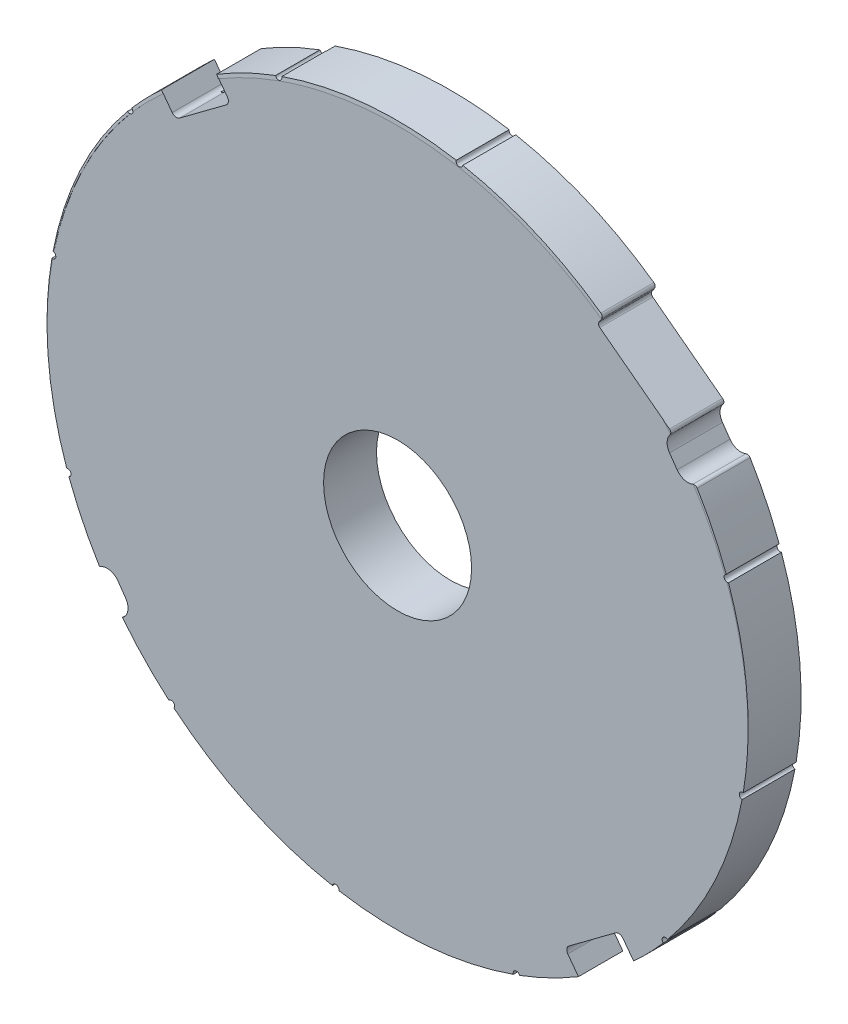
ISO-10303-21;
HEADER;
FILE_DESCRIPTION(('STEP AP214'),'2;1');
FILE_NAME('part.step','',(''),(''),'','','');
FILE_SCHEMA(('AUTOMOTIVE_DESIGN { 1 0 10303 214 1 1 1 1 }'));
ENDSEC;
DATA;
#1=APPLICATION_CONTEXT('core data for automotive mechanical design processes');
#2=APPLICATION_PROTOCOL_DEFINITION('international standard','automotive_design',2000,#1);
#3=PRODUCT_CONTEXT('',#1,'mechanical');
#4=PRODUCT('Part','Part','',(#3));
#5=PRODUCT_RELATED_PRODUCT_CATEGORY('part','',(#4));
#6=PRODUCT_DEFINITION_FORMATION('','',#4);
#7=PRODUCT_DEFINITION_CONTEXT('part definition',#1,'design');
#8=PRODUCT_DEFINITION('design','',#6,#7);
#9=PRODUCT_DEFINITION_SHAPE('','',#8);
#10=(LENGTH_UNIT() NAMED_UNIT(*) SI_UNIT(.MILLI.,.METRE.));
#11=(NAMED_UNIT(*) PLANE_ANGLE_UNIT() SI_UNIT($,.RADIAN.));
#12=(NAMED_UNIT(*) SI_UNIT($,.STERADIAN.) SOLID_ANGLE_UNIT());
#13=UNCERTAINTY_MEASURE_WITH_UNIT(LENGTH_MEASURE(1.E-05),#10,'distance_accuracy_value','');
#14=(GEOMETRIC_REPRESENTATION_CONTEXT(3) GLOBAL_UNCERTAINTY_ASSIGNED_CONTEXT((#13)) GLOBAL_UNIT_ASSIGNED_CONTEXT((#10,
#11,#12)) REPRESENTATION_CONTEXT('',''));
#15=CARTESIAN_POINT('',(0.,0.,0.));
#16=DIRECTION('',(0.,0.,1.));
#17=DIRECTION('',(1.,0.,0.));
#18=AXIS2_PLACEMENT_3D('',#15,#16,#17);
#19=CARTESIAN_POINT('',(35.2139011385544,-49.2645690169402,96.721));
#20=DIRECTION('',(0.,0.,-1.));
#21=DIRECTION('',(0.718218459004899,0.695817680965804,0.));
#22=AXIS2_PLACEMENT_3D('',#19,#20,#21);
#23=CYLINDRICAL_SURFACE('',#22,0.5);
#24=CARTESIAN_POINT('',(35.2139011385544,-49.2645690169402,7.99999999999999));
#25=DIRECTION('',(0.,0.,1.));
#26=DIRECTION('',(1.,0.,0.));
#27=AXIS2_PLACEMENT_3D('',#24,#25,#26);
#28=CIRCLE('',#27,0.5);
#29=CARTESIAN_POINT('',(34.7427382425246,-49.4319175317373,7.99999999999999));
#30=VERTEX_POINT('',#29);
#31=CARTESIAN_POINT('',(35.6834643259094,-49.0927830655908,7.99999999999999));
#32=VERTEX_POINT('',#31);
#33=EDGE_CURVE('E1219',#30,#32,#28,.F.);
#34=ORIENTED_EDGE('',*,*,#33,.F.);
#35=DIRECTION('',(0.,0.,-1.));
#36=VECTOR('',#35,1.);
#37=CARTESIAN_POINT('',(34.7427382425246,-49.4319175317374,96.721));
#38=LINE('',#37,#36);
#39=CARTESIAN_POINT('',(34.7427382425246,-49.4319175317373,1.28999999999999));
#40=VERTEX_POINT('',#39);
#41=EDGE_CURVE('E793',#30,#40,#38,.T.);
#42=ORIENTED_EDGE('',*,*,#41,.T.);
#43=CARTESIAN_POINT('',(35.2139011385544,-49.2645690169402,1.28999999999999));
#44=DIRECTION('',(0.,0.,-1.));
#45=DIRECTION('',(-1.,0.,0.));
#46=AXIS2_PLACEMENT_3D('',#43,#44,#45);
#47=CIRCLE('',#46,0.5);
#48=CARTESIAN_POINT('',(35.6834643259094,-49.0927830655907,1.28999999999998));
#49=VERTEX_POINT('',#48);
#50=EDGE_CURVE('E902',#49,#40,#47,.F.);
#51=ORIENTED_EDGE('',*,*,#50,.F.);
#52=DIRECTION('',(0.,0.,-1.));
#53=VECTOR('',#52,1.);
#54=CARTESIAN_POINT('',(35.6834643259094,-49.0927830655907,96.721));
#55=LINE('',#54,#53);
#56=EDGE_CURVE('E600',#32,#49,#55,.T.);
#57=ORIENTED_EDGE('',*,*,#56,.F.);
#58=EDGE_LOOP('',(#34,#42,#51,#57));
#59=FACE_BOUND('',#58,.T.);
#60=ADVANCED_FACE('F30',(#59),#23,.F.);
#61=CARTESIAN_POINT('',(43.6134564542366,-42.1630948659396,1.29));
#62=DIRECTION('',(0.,0.,1.));
#63=DIRECTION('',(-0.718218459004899,-0.695817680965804,0.));
#64=AXIS2_PLACEMENT_3D('',#61,#62,#63);
#65=CYLINDRICAL_SURFACE('',#64,0.8);
#66=CARTESIAN_POINT('',(43.6134564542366,-42.1630948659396,7.99999999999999));
#67=DIRECTION('',(0.,0.,1.));
#68=DIRECTION('',(1.,0.,0.));
#69=AXIS2_PLACEMENT_3D('',#66,#67,#68);
#70=CIRCLE('',#69,0.8);
#71=CARTESIAN_POINT('',(42.9719685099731,-42.6411045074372,7.99999999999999));
#72=VERTEX_POINT('',#71);
#73=CARTESIAN_POINT('',(43.1354468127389,-41.5216069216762,7.99999999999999));
#74=VERTEX_POINT('',#73);
#75=EDGE_CURVE('E1035',#72,#74,#70,.F.);
#76=ORIENTED_EDGE('',*,*,#75,.F.);
#77=DIRECTION('',(0.,0.,-1.));
#78=VECTOR('',#77,1.);
#79=CARTESIAN_POINT('',(42.9719685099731,-42.6411045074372,11.7585082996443));
#80=LINE('',#79,#78);
#81=CARTESIAN_POINT('',(42.9719685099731,-42.6411045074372,1.28999999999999));
#82=VERTEX_POINT('',#81);
#83=EDGE_CURVE('E1173',#72,#82,#80,.T.);
#84=ORIENTED_EDGE('',*,*,#83,.T.);
#85=CARTESIAN_POINT('',(43.6134564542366,-42.1630948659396,1.28999999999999));
#86=DIRECTION('',(0.,0.,-1.));
#87=DIRECTION('',(0.,1.,0.));
#88=AXIS2_PLACEMENT_3D('',#85,#86,#87);
#89=CIRCLE('',#88,0.799999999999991);
#90=CARTESIAN_POINT('',(43.1163732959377,-41.5362708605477,1.28999999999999));
#91=VERTEX_POINT('',#90);
#92=EDGE_CURVE('E1069',#82,#91,#89,.T.);
#93=ORIENTED_EDGE('',*,*,#92,.T.);
#94=DIRECTION('',(0.,0.,1.));
#95=VECTOR('',#94,1.);
#96=CARTESIAN_POINT('',(43.1163732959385,-41.536270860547,0.644999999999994));
#97=LINE('',#96,#95);
#98=CARTESIAN_POINT('',(43.1163732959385,-41.536270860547,0.));
#99=VERTEX_POINT('',#98);
#100=EDGE_CURVE('E899',#99,#91,#97,.T.);
#101=ORIENTED_EDGE('',*,*,#100,.F.);
#102=CARTESIAN_POINT('',(43.6134564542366,-42.1630948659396,0.));
#103=DIRECTION('',(0.,0.,1.));
#104=DIRECTION('',(1.,0.,0.));
#105=AXIS2_PLACEMENT_3D('',#102,#103,#104);
#106=CIRCLE('',#105,0.8);
#107=CARTESIAN_POINT('',(43.1354468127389,-41.5216069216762,0.));
#108=VERTEX_POINT('',#107);
#109=EDGE_CURVE('E983',#108,#99,#106,.T.);
#110=ORIENTED_EDGE('',*,*,#109,.F.);
#111=DIRECTION('',(0.,0.,-1.));
#112=VECTOR('',#111,1.);
#113=CARTESIAN_POINT('',(43.1354468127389,-41.5216069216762,1.29));
#114=LINE('',#113,#112);
#115=EDGE_CURVE('E997',#108,#74,#114,.F.);
#116=ORIENTED_EDGE('',*,*,#115,.T.);
#117=EDGE_LOOP('',(#76,#84,#93,#101,#110,#116));
#118=FACE_BOUND('',#117,.T.);
#119=ADVANCED_FACE('F1034',(#118),#65,.F.);
#120=CARTESIAN_POINT('',(50.8333021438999,-35.7854912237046,1.29));
#121=DIRECTION('',(0.597512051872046,-0.801859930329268,0.));
#122=DIRECTION('',(0.801859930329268,0.597512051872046,0.));
#123=AXIS2_PLACEMENT_3D('',#120,#121,#122);
#124=PLANE('',#123);
#125=DIRECTION('',(0.,0.,-1.));
#126=VECTOR('',#125,1.);
#127=CARTESIAN_POINT('',(50.1918141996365,-36.2635008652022,11.7585082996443));
#128=LINE('',#127,#126);
#129=CARTESIAN_POINT('',(50.1918141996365,-36.2635008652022,7.99999999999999));
#130=VERTEX_POINT('',#129);
#131=CARTESIAN_POINT('',(50.1918141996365,-36.2635008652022,1.28999999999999));
#132=VERTEX_POINT('',#131);
#133=EDGE_CURVE('E1064',#130,#132,#128,.T.);
#134=ORIENTED_EDGE('',*,*,#133,.F.);
#135=DIRECTION('',(-0.801859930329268,-0.597512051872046,0.));
#136=VECTOR('',#135,1.);
#137=CARTESIAN_POINT('',(50.8333021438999,-35.7854912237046,7.99999999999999));
#138=LINE('',#137,#136);
#139=EDGE_CURVE('E1043',#130,#74,#138,.T.);
#140=ORIENTED_EDGE('',*,*,#139,.T.);
#141=ORIENTED_EDGE('',*,*,#115,.F.);
#142=DIRECTION('',(0.801859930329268,0.597512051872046,0.));
#143=VECTOR('',#142,1.);
#144=CARTESIAN_POINT('',(46.6636305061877,-38.8925538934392,0.));
#145=LINE('',#144,#143);
#146=CARTESIAN_POINT('',(50.1731960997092,-36.2773742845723,0.));
#147=VERTEX_POINT('',#146);
#148=EDGE_CURVE('E808',#108,#147,#145,.T.);
#149=ORIENTED_EDGE('',*,*,#148,.T.);
#150=DIRECTION('',(0.,0.,1.));
#151=VECTOR('',#150,1.);
#152=CARTESIAN_POINT('',(50.1731960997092,-36.2773742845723,-29.6742180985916));
#153=LINE('',#152,#151);
#154=CARTESIAN_POINT('',(50.1731960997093,-36.2773742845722,1.28999999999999));
#155=VERTEX_POINT('',#154);
#156=EDGE_CURVE('E896',#147,#155,#153,.T.);
#157=ORIENTED_EDGE('',*,*,#156,.T.);
#158=DIRECTION('',(0.801859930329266,0.597512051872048,0.));
#159=VECTOR('',#158,1.);
#160=CARTESIAN_POINT('',(46.6636305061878,-38.8925538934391,1.28999999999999));
#161=LINE('',#160,#159);
#162=EDGE_CURVE('E1063',#155,#132,#161,.T.);
#163=ORIENTED_EDGE('',*,*,#162,.T.);
#164=EDGE_LOOP('',(#134,#140,#141,#149,#157,#163));
#165=FACE_BOUND('',#164,.T.);
#166=ADVANCED_FACE('F1042',(#165),#124,.T.);
#167=CARTESIAN_POINT('',(-9.13430751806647,43.3520310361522,1.28999999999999));
#168=DIRECTION('',(0.,0.,1.));
#169=DIRECTION('',(-0.718218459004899,-0.695817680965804,0.));
#170=AXIS2_PLACEMENT_3D('',#167,#168,#169);
#171=CYLINDRICAL_SURFACE('',#170,0.8);
#172=CARTESIAN_POINT('',(-9.13430751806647,43.3520310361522,7.99999999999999));
#173=DIRECTION('',(0.,0.,1.));
#174=DIRECTION('',(1.,0.,0.));
#175=AXIS2_PLACEMENT_3D('',#172,#173,#174);
#176=CIRCLE('',#175,0.8);
#177=CARTESIAN_POINT('',(-8.49281957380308,43.8300406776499,7.99999999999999));
#178=VERTEX_POINT('',#177);
#179=CARTESIAN_POINT('',(-8.65629787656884,42.7105430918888,7.99999999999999));
#180=VERTEX_POINT('',#179);
#181=EDGE_CURVE('E1211',#178,#180,#176,.F.);
#182=ORIENTED_EDGE('',*,*,#181,.F.);
#183=DIRECTION('',(0.,0.,-1.));
#184=VECTOR('',#183,1.);
#185=CARTESIAN_POINT('',(-8.49281957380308,43.8300406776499,11.7585082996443));
#186=LINE('',#185,#184);
#187=CARTESIAN_POINT('',(-8.49281957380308,43.8300406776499,1.29));
#188=VERTEX_POINT('',#187);
#189=EDGE_CURVE('E1067',#178,#188,#186,.T.);
#190=ORIENTED_EDGE('',*,*,#189,.T.);
#191=CARTESIAN_POINT('',(-9.13430751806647,43.3520310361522,1.29));
#192=DIRECTION('',(0.,0.,-1.));
#193=DIRECTION('',(0.,1.,0.));
#194=AXIS2_PLACEMENT_3D('',#191,#192,#193);
#195=CIRCLE('',#194,0.799999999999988);
#196=CARTESIAN_POINT('',(-8.63722435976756,42.7252070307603,1.28999999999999));
#197=VERTEX_POINT('',#196);
#198=EDGE_CURVE('E1075',#188,#197,#195,.T.);
#199=ORIENTED_EDGE('',*,*,#198,.T.);
#200=DIRECTION('',(0.,0.,1.));
#201=VECTOR('',#200,1.);
#202=CARTESIAN_POINT('',(-8.63722435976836,42.7252070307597,0.644999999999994));
#203=LINE('',#202,#201);
#204=CARTESIAN_POINT('',(-8.63722435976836,42.7252070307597,0.));
#205=VERTEX_POINT('',#204);
#206=EDGE_CURVE('E936',#205,#197,#203,.T.);
#207=ORIENTED_EDGE('',*,*,#206,.F.);
#208=CARTESIAN_POINT('',(-9.13430751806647,43.3520310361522,0.));
#209=DIRECTION('',(0.,0.,1.));
#210=DIRECTION('',(1.,0.,0.));
#211=AXIS2_PLACEMENT_3D('',#208,#209,#210);
#212=CIRCLE('',#211,0.8);
#213=CARTESIAN_POINT('',(-8.65629787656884,42.7105430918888,0.));
#214=VERTEX_POINT('',#213);
#215=EDGE_CURVE('E967',#214,#205,#212,.T.);
#216=ORIENTED_EDGE('',*,*,#215,.F.);
#217=DIRECTION('',(0.,0.,-1.));
#218=VECTOR('',#217,1.);
#219=CARTESIAN_POINT('',(-8.65629787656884,42.7105430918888,1.28999999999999));
#220=LINE('',#219,#218);
#221=EDGE_CURVE('E988',#214,#180,#220,.F.);
#222=ORIENTED_EDGE('',*,*,#221,.T.);
#223=EDGE_LOOP('',(#182,#190,#199,#207,#216,#222));
#224=FACE_BOUND('',#223,.T.);
#225=ADVANCED_FACE('F1341',(#224),#171,.F.);
#226=CARTESIAN_POINT('',(-16.3541532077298,36.9744273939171,1.28999999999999));
#227=DIRECTION('',(-0.597512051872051,0.801859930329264,0.));
#228=DIRECTION('',(-0.801859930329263,-0.597512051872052,0.));
#229=AXIS2_PLACEMENT_3D('',#226,#227,#228);
#230=PLANE('',#229);
#231=DIRECTION('',(0.,0.,-1.));
#232=VECTOR('',#231,1.);
#233=CARTESIAN_POINT('',(-15.7126652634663,37.4524370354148,11.7585082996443));
#234=LINE('',#233,#232);
#235=CARTESIAN_POINT('',(-15.7126652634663,37.4524370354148,7.99999999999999));
#236=VERTEX_POINT('',#235);
#237=CARTESIAN_POINT('',(-15.7126652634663,37.4524370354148,1.29));
#238=VERTEX_POINT('',#237);
#239=EDGE_CURVE('E1073',#236,#238,#234,.T.);
#240=ORIENTED_EDGE('',*,*,#239,.F.);
#241=DIRECTION('',(0.801859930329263,0.597512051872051,0.));
#242=VECTOR('',#241,1.);
#243=CARTESIAN_POINT('',(-16.3541532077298,36.9744273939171,7.99999999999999));
#244=LINE('',#243,#242);
#245=EDGE_CURVE('E1208',#236,#180,#244,.T.);
#246=ORIENTED_EDGE('',*,*,#245,.T.);
#247=ORIENTED_EDGE('',*,*,#221,.F.);
#248=DIRECTION('',(-0.801859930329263,-0.597512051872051,0.));
#249=VECTOR('',#248,1.);
#250=CARTESIAN_POINT('',(-12.1844815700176,40.0814900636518,0.));
#251=LINE('',#250,#249);
#252=CARTESIAN_POINT('',(-15.6940471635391,37.4663104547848,0.));
#253=VERTEX_POINT('',#252);
#254=EDGE_CURVE('E803',#214,#253,#251,.T.);
#255=ORIENTED_EDGE('',*,*,#254,.T.);
#256=DIRECTION('',(0.,0.,1.));
#257=VECTOR('',#256,1.);
#258=CARTESIAN_POINT('',(-15.6940471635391,37.4663104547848,-29.6742180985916));
#259=LINE('',#258,#257);
#260=CARTESIAN_POINT('',(-15.6940471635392,37.4663104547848,1.28999999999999));
#261=VERTEX_POINT('',#260);
#262=EDGE_CURVE('E933',#253,#261,#259,.T.);
#263=ORIENTED_EDGE('',*,*,#262,.T.);
#264=DIRECTION('',(-0.801859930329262,-0.597512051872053,0.));
#265=VECTOR('',#264,1.);
#266=CARTESIAN_POINT('',(-12.1844815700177,40.0814900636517,1.29));
#267=LINE('',#266,#265);
#268=EDGE_CURVE('E1079',#261,#238,#267,.T.);
#269=ORIENTED_EDGE('',*,*,#268,.T.);
#270=EDGE_LOOP('',(#240,#246,#247,#255,#263,#269));
#271=FACE_BOUND('',#270,.T.);
#272=ADVANCED_FACE('F1337',(#271),#230,.T.);
#273=CARTESIAN_POINT('',(-32.6194626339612,-17.3798585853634,96.721));
#274=DIRECTION('',(0.,0.,-1.));
#275=DIRECTION('',(0.718218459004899,0.695817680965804,0.));
#276=AXIS2_PLACEMENT_3D('',#273,#274,#275);
#277=CYLINDRICAL_SURFACE('',#276,0.5);
#278=CARTESIAN_POINT('',(-32.6194626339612,-17.3798585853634,7.99999999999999));
#279=DIRECTION('',(0.,0.,1.));
#280=DIRECTION('',(1.,0.,0.));
#281=AXIS2_PLACEMENT_3D('',#278,#279,#280);
#282=CIRCLE('',#281,0.5);
#283=CARTESIAN_POINT('',(-32.7868111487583,-16.9086956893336,7.99999999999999));
#284=VERTEX_POINT('',#283);
#285=CARTESIAN_POINT('',(-32.4476766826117,-17.8494217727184,7.99999999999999));
#286=VERTEX_POINT('',#285);
#287=EDGE_CURVE('E1198',#284,#286,#282,.F.);
#288=ORIENTED_EDGE('',*,*,#287,.F.);
#289=DIRECTION('',(0.,0.,-1.));
#290=VECTOR('',#289,1.);
#291=CARTESIAN_POINT('',(-32.7868111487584,-16.9086956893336,96.721));
#292=LINE('',#291,#290);
#293=CARTESIAN_POINT('',(-32.7868111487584,-16.9086956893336,0.));
#294=VERTEX_POINT('',#293);
#295=EDGE_CURVE('E525',#284,#294,#292,.T.);
#296=ORIENTED_EDGE('',*,*,#295,.T.);
#297=CARTESIAN_POINT('',(-32.6194626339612,-17.3798585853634,0.));
#298=DIRECTION('',(0.,0.,1.));
#299=DIRECTION('',(1.,0.,0.));
#300=AXIS2_PLACEMENT_3D('',#297,#298,#299);
#301=CIRCLE('',#300,0.5);
#302=CARTESIAN_POINT('',(-32.4476766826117,-17.8494217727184,0.));
#303=VERTEX_POINT('',#302);
#304=EDGE_CURVE('E952',#303,#294,#301,.T.);
#305=ORIENTED_EDGE('',*,*,#304,.F.);
#306=DIRECTION('',(0.,0.,-1.));
#307=VECTOR('',#306,1.);
#308=CARTESIAN_POINT('',(-32.4476766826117,-17.8494217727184,96.721));
#309=LINE('',#308,#307);
#310=EDGE_CURVE('E627',#286,#303,#309,.T.);
#311=ORIENTED_EDGE('',*,*,#310,.F.);
#312=EDGE_LOOP('',(#288,#296,#305,#311));
#313=FACE_BOUND('',#312,.T.);
#314=ADVANCED_FACE('F1340',(#313),#277,.F.);
#315=CARTESIAN_POINT('',(-26.6556394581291,-28.9725776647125,96.721));
#316=DIRECTION('',(0.,0.,-1.));
#317=DIRECTION('',(0.718218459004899,0.695817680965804,0.));
#318=AXIS2_PLACEMENT_3D('',#315,#316,#317);
#319=CYLINDRICAL_SURFACE('',#318,2.);
#320=CARTESIAN_POINT('',(-26.6556394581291,-28.9725776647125,7.99999999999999));
#321=DIRECTION('',(0.,0.,1.));
#322=DIRECTION('',(1.,0.,0.));
#323=AXIS2_PLACEMENT_3D('',#320,#321,#322);
#324=CIRCLE('',#323,2.);
#325=CARTESIAN_POINT('',(-27.804112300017,-27.3351986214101,7.99999999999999));
#326=VERTEX_POINT('',#325);
#327=CARTESIAN_POINT('',(-25.0182604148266,-27.8241048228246,7.99999999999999));
#328=VERTEX_POINT('',#327);
#329=EDGE_CURVE('E1190',#326,#328,#324,.F.);
#330=ORIENTED_EDGE('',*,*,#329,.F.);
#331=DIRECTION('',(0.,0.,-1.));
#332=VECTOR('',#331,1.);
#333=CARTESIAN_POINT('',(-27.804112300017,-27.3351986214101,96.721));
#334=LINE('',#333,#332);
#335=CARTESIAN_POINT('',(-27.804112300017,-27.3351986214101,0.));
#336=VERTEX_POINT('',#335);
#337=EDGE_CURVE('E809',#326,#336,#334,.T.);
#338=ORIENTED_EDGE('',*,*,#337,.T.);
#339=CARTESIAN_POINT('',(-26.6556394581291,-28.9725776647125,0.));
#340=DIRECTION('',(0.,0.,1.));
#341=DIRECTION('',(1.,0.,0.));
#342=AXIS2_PLACEMENT_3D('',#339,#340,#341);
#343=CIRCLE('',#342,2.);
#344=CARTESIAN_POINT('',(-25.0182604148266,-27.8241048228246,0.));
#345=VERTEX_POINT('',#344);
#346=EDGE_CURVE('E956',#345,#336,#343,.T.);
#347=ORIENTED_EDGE('',*,*,#346,.F.);
#348=DIRECTION('',(0.,0.,-1.));
#349=VECTOR('',#348,1.);
#350=CARTESIAN_POINT('',(-25.0182604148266,-27.8241048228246,96.721));
#351=LINE('',#350,#349);
#352=EDGE_CURVE('E812',#345,#328,#351,.F.);
#353=ORIENTED_EDGE('',*,*,#352,.T.);
#354=EDGE_LOOP('',(#330,#338,#347,#353));
#355=FACE_BOUND('',#354,.T.);
#356=ADVANCED_FACE('F1372',(#355),#319,.F.);
#357=CARTESIAN_POINT('',(-25.507166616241,-30.6099567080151,96.721));
#358=DIRECTION('',(0.,0.,1.));
#359=DIRECTION('',(-0.718218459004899,-0.695817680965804,0.));
#360=AXIS2_PLACEMENT_3D('',#357,#358,#359);
#361=CYLINDRICAL_SURFACE('',#360,2.);
#362=CARTESIAN_POINT('',(-25.507166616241,-30.6099567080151,7.99999999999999));
#363=DIRECTION('',(0.,0.,1.));
#364=DIRECTION('',(1.,0.,0.));
#365=AXIS2_PLACEMENT_3D('',#362,#363,#364);
#366=CIRCLE('',#365,2.);
#367=CARTESIAN_POINT('',(-23.8697875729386,-29.4614838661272,7.99999999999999));
#368=VERTEX_POINT('',#367);
#369=CARTESIAN_POINT('',(-24.3586937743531,-32.2473357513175,7.99999999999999));
#370=VERTEX_POINT('',#369);
#371=EDGE_CURVE('E1194',#368,#370,#366,.F.);
#372=ORIENTED_EDGE('',*,*,#371,.F.);
#373=DIRECTION('',(0.,0.,-1.));
#374=VECTOR('',#373,1.);
#375=CARTESIAN_POINT('',(-23.8697875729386,-29.4614838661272,96.721));
#376=LINE('',#375,#374);
#377=CARTESIAN_POINT('',(-23.8697875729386,-29.4614838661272,0.));
#378=VERTEX_POINT('',#377);
#379=EDGE_CURVE('E811',#368,#378,#376,.T.);
#380=ORIENTED_EDGE('',*,*,#379,.T.);
#381=CARTESIAN_POINT('',(-25.507166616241,-30.6099567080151,0.));
#382=DIRECTION('',(0.,0.,1.));
#383=DIRECTION('',(1.,0.,0.));
#384=AXIS2_PLACEMENT_3D('',#381,#382,#383);
#385=CIRCLE('',#384,2.);
#386=CARTESIAN_POINT('',(-24.3586937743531,-32.2473357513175,0.));
#387=VERTEX_POINT('',#386);
#388=EDGE_CURVE('E951',#387,#378,#385,.T.);
#389=ORIENTED_EDGE('',*,*,#388,.F.);
#390=DIRECTION('',(0.,0.,-1.));
#391=VECTOR('',#390,1.);
#392=CARTESIAN_POINT('',(-24.3586937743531,-32.2473357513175,96.721));
#393=LINE('',#392,#391);
#394=EDGE_CURVE('E533',#370,#387,#393,.T.);
#395=ORIENTED_EDGE('',*,*,#394,.F.);
#396=EDGE_LOOP('',(#372,#380,#389,#395));
#397=FACE_BOUND('',#396,.T.);
#398=ADVANCED_FACE('F1367',(#397),#361,.F.);
#399=CARTESIAN_POINT('',(-26.1667332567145,-26.1867257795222,96.721));
#400=DIRECTION('',(0.818689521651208,0.57423642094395,0.));
#401=DIRECTION('',(-0.57423642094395,0.818689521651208,0.));
#402=AXIS2_PLACEMENT_3D('',#399,#400,#401);
#403=PLANE('',#402);
#404=DIRECTION('',(0.57423642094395,-0.818689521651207,0.));
#405=VECTOR('',#404,1.);
#406=CARTESIAN_POINT('',(-26.1667332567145,-26.1867257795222,7.99999999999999));
#407=LINE('',#406,#405);
#408=EDGE_CURVE('E1192',#328,#368,#407,.T.);
#409=ORIENTED_EDGE('',*,*,#408,.F.);
#410=ORIENTED_EDGE('',*,*,#352,.F.);
#411=DIRECTION('',(-0.57423642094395,0.818689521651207,0.));
#412=VECTOR('',#411,1.);
#413=CARTESIAN_POINT('',(-24.4440239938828,-28.6427943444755,0.));
#414=LINE('',#413,#412);
#415=EDGE_CURVE('E1004',#378,#345,#414,.T.);
#416=ORIENTED_EDGE('',*,*,#415,.F.);
#417=ORIENTED_EDGE('',*,*,#379,.F.);
#418=EDGE_LOOP('',(#409,#410,#416,#417));
#419=FACE_BOUND('',#418,.T.);
#420=ADVANCED_FACE('F1364',(#419),#403,.F.);
#421=CARTESIAN_POINT('',(-16.9524549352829,-39.9012739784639,96.721));
#422=DIRECTION('',(0.,0.,-1.));
#423=DIRECTION('',(0.718218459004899,0.695817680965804,0.));
#424=AXIS2_PLACEMENT_3D('',#421,#422,#423);
#425=CYLINDRICAL_SURFACE('',#424,0.5);
#426=CARTESIAN_POINT('',(-16.9524549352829,-39.9012739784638,7.99999999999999));
#427=DIRECTION('',(0.,0.,1.));
#428=DIRECTION('',(1.,0.,0.));
#429=AXIS2_PLACEMENT_3D('',#426,#427,#428);
#430=CIRCLE('',#429,0.5);
#431=CARTESIAN_POINT('',(-17.3329644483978,-39.57690919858,7.99999999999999));
#432=VERTEX_POINT('',#431);
#433=CARTESIAN_POINT('',(-16.5689023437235,-40.2220346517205,7.99999999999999));
#434=VERTEX_POINT('',#433);
#435=EDGE_CURVE('E1196',#432,#434,#430,.F.);
#436=ORIENTED_EDGE('',*,*,#435,.F.);
#437=DIRECTION('',(0.,0.,-1.));
#438=VECTOR('',#437,1.);
#439=CARTESIAN_POINT('',(-17.3329644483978,-39.57690919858,96.721));
#440=LINE('',#439,#438);
#441=CARTESIAN_POINT('',(-17.3329644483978,-39.57690919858,0.));
#442=VERTEX_POINT('',#441);
#443=EDGE_CURVE('E798',#432,#442,#440,.T.);
#444=ORIENTED_EDGE('',*,*,#443,.T.);
#445=CARTESIAN_POINT('',(-16.9524549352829,-39.9012739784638,0.));
#446=DIRECTION('',(0.,0.,1.));
#447=DIRECTION('',(1.,0.,0.));
#448=AXIS2_PLACEMENT_3D('',#445,#446,#447);
#449=CIRCLE('',#448,0.5);
#450=CARTESIAN_POINT('',(-16.5689023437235,-40.2220346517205,0.));
#451=VERTEX_POINT('',#450);
#452=EDGE_CURVE('E948',#451,#442,#449,.T.);
#453=ORIENTED_EDGE('',*,*,#452,.F.);
#454=DIRECTION('',(0.,0.,-1.));
#455=VECTOR('',#454,1.);
#456=CARTESIAN_POINT('',(-16.5689023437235,-40.2220346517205,96.721));
#457=LINE('',#456,#455);
#458=EDGE_CURVE('E620',#434,#451,#457,.T.);
#459=ORIENTED_EDGE('',*,*,#458,.F.);
#460=EDGE_LOOP('',(#436,#444,#453,#459));
#461=FACE_BOUND('',#460,.T.);
#462=ADVANCED_FACE('F1331',(#461),#425,.F.);
#463=CARTESIAN_POINT('',(7.87627942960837,-51.5718879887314,96.721));
#464=DIRECTION('',(0.,0.,-1.));
#465=DIRECTION('',(0.718218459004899,0.695817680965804,0.));
#466=AXIS2_PLACEMENT_3D('',#463,#464,#465);
#467=CYLINDRICAL_SURFACE('',#466,0.5);
#468=CARTESIAN_POINT('',(7.87627942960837,-51.5718879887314,7.99999999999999));
#469=DIRECTION('',(0.,0.,1.));
#470=DIRECTION('',(1.,0.,0.));
#471=AXIS2_PLACEMENT_3D('',#468,#469,#470);
#472=CIRCLE('',#471,0.5);
#473=CARTESIAN_POINT('',(7.38456613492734,-51.4812346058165,7.99999999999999));
#474=VERTEX_POINT('',#473);
#475=CARTESIAN_POINT('',(8.36882605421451,-51.657898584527,7.99999999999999));
#476=VERTEX_POINT('',#475);
#477=EDGE_CURVE('E1186',#474,#476,#472,.F.);
#478=ORIENTED_EDGE('',*,*,#477,.F.);
#479=DIRECTION('',(0.,0.,-1.));
#480=VECTOR('',#479,1.);
#481=CARTESIAN_POINT('',(7.38456613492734,-51.4812346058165,96.721));
#482=LINE('',#481,#480);
#483=CARTESIAN_POINT('',(7.38456613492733,-51.4812346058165,0.));
#484=VERTEX_POINT('',#483);
#485=EDGE_CURVE('E796',#474,#484,#482,.T.);
#486=ORIENTED_EDGE('',*,*,#485,.T.);
#487=CARTESIAN_POINT('',(7.87627942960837,-51.5718879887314,0.));
#488=DIRECTION('',(0.,0.,1.));
#489=DIRECTION('',(1.,0.,0.));
#490=AXIS2_PLACEMENT_3D('',#487,#488,#489);
#491=CIRCLE('',#490,0.5);
#492=CARTESIAN_POINT('',(8.36882605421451,-51.657898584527,0.));
#493=VERTEX_POINT('',#492);
#494=EDGE_CURVE('E979',#493,#484,#491,.T.);
#495=ORIENTED_EDGE('',*,*,#494,.F.);
#496=DIRECTION('',(0.,0.,-1.));
#497=VECTOR('',#496,1.);
#498=CARTESIAN_POINT('',(8.36882605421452,-51.657898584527,96.721));
#499=LINE('',#498,#497);
#500=EDGE_CURVE('E610',#476,#493,#499,.T.);
#501=ORIENTED_EDGE('',*,*,#500,.F.);
#502=EDGE_LOOP('',(#478,#486,#495,#501));
#503=FACE_BOUND('',#502,.T.);
#504=ADVANCED_FACE('F1329',(#503),#467,.F.);
#505=CARTESIAN_POINT('',(57.7353165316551,-33.5975613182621,96.721));
#506=DIRECTION('',(0.,0.,-1.));
#507=DIRECTION('',(0.718218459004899,0.695817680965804,0.));
#508=AXIS2_PLACEMENT_3D('',#505,#506,#507);
#509=CYLINDRICAL_SURFACE('',#508,0.5);
#510=CARTESIAN_POINT('',(57.7353165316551,-33.5975613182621,7.99999999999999));
#511=DIRECTION('',(0.,0.,1.));
#512=DIRECTION('',(1.,0.,0.));
#513=AXIS2_PLACEMENT_3D('',#510,#511,#512);
#514=CIRCLE('',#513,0.5);
#515=CARTESIAN_POINT('',(57.4109517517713,-33.978070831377,7.99999999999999));
#516=VERTEX_POINT('',#515);
#517=CARTESIAN_POINT('',(58.0560772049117,-33.2140087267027,7.99999999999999));
#518=VERTEX_POINT('',#517);
#519=EDGE_CURVE('E1155',#516,#518,#514,.F.);
#520=ORIENTED_EDGE('',*,*,#519,.F.);
#521=DIRECTION('',(0.,0.,-1.));
#522=VECTOR('',#521,1.);
#523=CARTESIAN_POINT('',(57.4109517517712,-33.978070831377,96.721));
#524=LINE('',#523,#522);
#525=CARTESIAN_POINT('',(57.4109517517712,-33.978070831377,0.));
#526=VERTEX_POINT('',#525);
#527=EDGE_CURVE('E791',#516,#526,#524,.T.);
#528=ORIENTED_EDGE('',*,*,#527,.T.);
#529=CARTESIAN_POINT('',(57.7353165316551,-33.5975613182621,0.));
#530=DIRECTION('',(0.,0.,1.));
#531=DIRECTION('',(1.,0.,0.));
#532=AXIS2_PLACEMENT_3D('',#529,#530,#531);
#533=CIRCLE('',#532,0.5);
#534=CARTESIAN_POINT('',(58.0560772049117,-33.2140087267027,0.));
#535=VERTEX_POINT('',#534);
#536=EDGE_CURVE('E975',#535,#526,#533,.T.);
#537=ORIENTED_EDGE('',*,*,#536,.F.);
#538=DIRECTION('',(0.,0.,-1.));
#539=VECTOR('',#538,1.);
#540=CARTESIAN_POINT('',(58.0560772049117,-33.2140087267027,96.721));
#541=LINE('',#540,#539);
#542=EDGE_CURVE('E591',#518,#535,#541,.T.);
#543=ORIENTED_EDGE('',*,*,#542,.F.);
#544=EDGE_LOOP('',(#520,#528,#537,#543));
#545=FACE_BOUND('',#544,.T.);
#546=ADVANCED_FACE('F1154',(#545),#509,.F.);
#547=CARTESIAN_POINT('',(69.405930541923,-8.76882695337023,96.721));
#548=DIRECTION('',(0.,0.,-1.));
#549=DIRECTION('',(0.718218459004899,0.695817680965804,0.));
#550=AXIS2_PLACEMENT_3D('',#547,#548,#549);
#551=CYLINDRICAL_SURFACE('',#550,0.5);
#552=CARTESIAN_POINT('',(69.405930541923,-8.76882695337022,7.99999999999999));
#553=DIRECTION('',(0.,0.,1.));
#554=DIRECTION('',(1.,0.,0.));
#555=AXIS2_PLACEMENT_3D('',#552,#553,#554);
#556=CIRCLE('',#555,0.5);
#557=CARTESIAN_POINT('',(69.315277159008,-9.26054024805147,7.99999999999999));
#558=VERTEX_POINT('',#557);
#559=CARTESIAN_POINT('',(69.4919411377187,-8.27628032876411,7.99999999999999));
#560=VERTEX_POINT('',#559);
#561=EDGE_CURVE('E1148',#558,#560,#556,.F.);
#562=ORIENTED_EDGE('',*,*,#561,.F.);
#563=DIRECTION('',(0.,0.,-1.));
#564=VECTOR('',#563,1.);
#565=CARTESIAN_POINT('',(69.3152771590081,-9.26054024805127,96.721));
#566=LINE('',#565,#564);
#567=CARTESIAN_POINT('',(69.3152771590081,-9.26054024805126,0.));
#568=VERTEX_POINT('',#567);
#569=EDGE_CURVE('E789',#558,#568,#566,.T.);
#570=ORIENTED_EDGE('',*,*,#569,.T.);
#571=CARTESIAN_POINT('',(69.405930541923,-8.76882695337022,0.));
#572=DIRECTION('',(0.,0.,1.));
#573=DIRECTION('',(1.,0.,0.));
#574=AXIS2_PLACEMENT_3D('',#571,#572,#573);
#575=CIRCLE('',#574,0.5);
#576=CARTESIAN_POINT('',(69.4919411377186,-8.27628032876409,0.));
#577=VERTEX_POINT('',#576);
#578=EDGE_CURVE('E971',#577,#568,#575,.T.);
#579=ORIENTED_EDGE('',*,*,#578,.F.);
#580=DIRECTION('',(0.,0.,-1.));
#581=VECTOR('',#580,1.);
#582=CARTESIAN_POINT('',(69.4919411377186,-8.2762803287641,96.721));
#583=LINE('',#582,#581);
#584=EDGE_CURVE('E582',#560,#577,#583,.T.);
#585=ORIENTED_EDGE('',*,*,#584,.F.);
#586=EDGE_LOOP('',(#562,#570,#579,#585));
#587=FACE_BOUND('',#586,.T.);
#588=ADVANCED_FACE('F1147',(#587),#551,.F.);
#589=CARTESIAN_POINT('',(61.1347883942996,30.161513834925,96.721));
#590=DIRECTION('',(0.,0.,-1.));
#591=DIRECTION('',(0.718218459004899,0.695817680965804,0.));
#592=AXIS2_PLACEMENT_3D('',#589,#590,#591);
#593=CYLINDRICAL_SURFACE('',#592,2.);
#594=CARTESIAN_POINT('',(61.1347883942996,30.161513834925,7.99999999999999));
#595=DIRECTION('',(0.,0.,1.));
#596=DIRECTION('',(1.,0.,0.));
#597=AXIS2_PLACEMENT_3D('',#594,#595,#596);
#598=CIRCLE('',#597,2.);
#599=CARTESIAN_POINT('',(61.9114770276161,28.3184851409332,7.99999999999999));
#600=VERTEX_POINT('',#599);
#601=CARTESIAN_POINT('',(59.4974093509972,29.0130409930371,7.99999999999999));
#602=VERTEX_POINT('',#601);
#603=EDGE_CURVE('E764',#600,#602,#598,.F.);
#604=ORIENTED_EDGE('',*,*,#603,.F.);
#605=DIRECTION('',(0.,0.,-1.));
#606=VECTOR('',#605,1.);
#607=CARTESIAN_POINT('',(61.9114770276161,28.3184851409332,96.721));
#608=LINE('',#607,#606);
#609=CARTESIAN_POINT('',(61.9114770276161,28.3184851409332,0.));
#610=VERTEX_POINT('',#609);
#611=EDGE_CURVE('E1247',#600,#610,#608,.T.);
#612=ORIENTED_EDGE('',*,*,#611,.T.);
#613=CARTESIAN_POINT('',(61.1347883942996,30.161513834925,0.));
#614=DIRECTION('',(0.,0.,1.));
#615=DIRECTION('',(1.,0.,0.));
#616=AXIS2_PLACEMENT_3D('',#613,#614,#615);
#617=CIRCLE('',#616,2.);
#618=CARTESIAN_POINT('',(59.4974093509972,29.0130409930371,0.));
#619=VERTEX_POINT('',#618);
#620=EDGE_CURVE('E972',#619,#610,#617,.T.);
#621=ORIENTED_EDGE('',*,*,#620,.F.);
#622=DIRECTION('',(0.,0.,-1.));
#623=VECTOR('',#622,1.);
#624=CARTESIAN_POINT('',(59.4974093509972,29.0130409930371,96.721));
#625=LINE('',#624,#623);
#626=EDGE_CURVE('E1019',#619,#602,#625,.F.);
#627=ORIENTED_EDGE('',*,*,#626,.T.);
#628=EDGE_LOOP('',(#604,#612,#621,#627));
#629=FACE_BOUND('',#628,.T.);
#630=ADVANCED_FACE('F32',(#629),#593,.F.);
#631=CARTESIAN_POINT('',(59.9863155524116,31.7988928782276,96.721));
#632=DIRECTION('',(0.,0.,1.));
#633=DIRECTION('',(-0.718218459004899,-0.695817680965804,0.));
#634=AXIS2_PLACEMENT_3D('',#631,#632,#633);
#635=CYLINDRICAL_SURFACE('',#634,2.);
#636=CARTESIAN_POINT('',(59.9863155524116,31.7988928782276,7.99999999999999));
#637=DIRECTION('',(0.,0.,1.));
#638=DIRECTION('',(1.,0.,0.));
#639=AXIS2_PLACEMENT_3D('',#636,#637,#638);
#640=CIRCLE('',#639,2.);
#641=CARTESIAN_POINT('',(58.3489365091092,30.6504200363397,7.99999999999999));
#642=VERTEX_POINT('',#641);
#643=CARTESIAN_POINT('',(58.4475442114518,33.0764619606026,7.99999999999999));
#644=VERTEX_POINT('',#643);
#645=EDGE_CURVE('E1234',#642,#644,#640,.F.);
#646=ORIENTED_EDGE('',*,*,#645,.F.);
#647=DIRECTION('',(0.,0.,-1.));
#648=VECTOR('',#647,1.);
#649=CARTESIAN_POINT('',(58.3489365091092,30.6504200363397,96.721));
#650=LINE('',#649,#648);
#651=CARTESIAN_POINT('',(58.3489365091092,30.6504200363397,0.));
#652=VERTEX_POINT('',#651);
#653=EDGE_CURVE('E1016',#642,#652,#650,.T.);
#654=ORIENTED_EDGE('',*,*,#653,.T.);
#655=CARTESIAN_POINT('',(59.9863155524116,31.7988928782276,0.));
#656=DIRECTION('',(0.,0.,1.));
#657=DIRECTION('',(1.,0.,0.));
#658=AXIS2_PLACEMENT_3D('',#655,#656,#657);
#659=CIRCLE('',#658,2.);
#660=CARTESIAN_POINT('',(58.4475442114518,33.0764619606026,0.));
#661=VERTEX_POINT('',#660);
#662=EDGE_CURVE('E966',#661,#652,#659,.T.);
#663=ORIENTED_EDGE('',*,*,#662,.F.);
#664=DIRECTION('',(0.,0.,1.));
#665=VECTOR('',#664,1.);
#666=CARTESIAN_POINT('',(58.4475442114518,33.0764619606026,96.721));
#667=LINE('',#666,#665);
#668=EDGE_CURVE('E1257',#661,#644,#667,.T.);
#669=ORIENTED_EDGE('',*,*,#668,.T.);
#670=EDGE_LOOP('',(#646,#654,#663,#669));
#671=FACE_BOUND('',#670,.T.);
#672=ADVANCED_FACE('F1256',(#671),#635,.F.);
#673=CARTESIAN_POINT('',(60.6458821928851,27.3756619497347,96.721));
#674=DIRECTION('',(-0.818689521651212,-0.574236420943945,0.));
#675=DIRECTION('',(0.574236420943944,-0.818689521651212,0.));
#676=AXIS2_PLACEMENT_3D('',#673,#674,#675);
#677=PLANE('',#676);
#678=DIRECTION('',(-0.574236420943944,0.818689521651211,0.));
#679=VECTOR('',#678,1.);
#680=CARTESIAN_POINT('',(60.6458821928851,27.3756619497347,7.99999999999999));
#681=LINE('',#680,#679);
#682=EDGE_CURVE('E1235',#602,#642,#681,.T.);
#683=ORIENTED_EDGE('',*,*,#682,.F.);
#684=ORIENTED_EDGE('',*,*,#626,.F.);
#685=DIRECTION('',(0.574236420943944,-0.818689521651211,0.));
#686=VECTOR('',#685,1.);
#687=CARTESIAN_POINT('',(58.9231729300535,29.8317305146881,0.));
#688=LINE('',#687,#686);
#689=EDGE_CURVE('E1011',#652,#619,#688,.T.);
#690=ORIENTED_EDGE('',*,*,#689,.F.);
#691=ORIENTED_EDGE('',*,*,#653,.F.);
#692=EDGE_LOOP('',(#683,#684,#690,#691));
#693=FACE_BOUND('',#692,.T.);
#694=ADVANCED_FACE('F1245',(#693),#677,.F.);
#695=CARTESIAN_POINT('',(17.2395744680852,0.594468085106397,7.99999999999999));
#696=DIRECTION('',(0.,0.,-1.));
#697=DIRECTION('',(0.718218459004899,0.695817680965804,0.));
#698=AXIS2_PLACEMENT_3D('',#695,#696,#697);
#699=CONICAL_SURFACE('',#698,53.,1.48114961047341);
#700=CARTESIAN_POINT('',(70.2395016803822,0.100939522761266,7.99979999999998));
#701=CARTESIAN_POINT('',(70.2380025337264,0.846257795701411,8.00055937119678));
#702=CARTESIAN_POINT('',(70.2207638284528,1.59153731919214,8.00131888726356));
#703=CARTESIAN_POINT('',(70.1548787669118,3.08070484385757,8.00283686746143));
#704=CARTESIAN_POINT('',(70.1062324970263,3.82459284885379,8.00359533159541));
#705=CARTESIAN_POINT('',(69.9776067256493,5.30963322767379,8.00510983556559));
#706=CARTESIAN_POINT('',(69.8976286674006,6.05078572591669,8.00586587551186));
#707=CARTESIAN_POINT('',(69.7065017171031,7.52900856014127,8.00737415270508));
#708=CARTESIAN_POINT('',(69.5953528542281,8.26607889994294,8.00812638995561));
#709=CARTESIAN_POINT('',(69.21558317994,10.4681937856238,8.01037435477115));
#710=CARTESIAN_POINT('',(68.9005197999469,11.9255193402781,8.01186273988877));
#711=CARTESIAN_POINT('',(68.1488309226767,14.8082432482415,8.01480827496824));
#712=CARTESIAN_POINT('',(67.7122069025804,16.2336419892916,8.01626542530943));
#713=CARTESIAN_POINT('',(66.7202337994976,19.0433168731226,8.0191389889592));
#714=CARTESIAN_POINT('',(66.1648294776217,20.4275735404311,8.02055538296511));
#715=CARTESIAN_POINT('',(64.9393682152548,23.144371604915,8.02333647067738));
#716=CARTESIAN_POINT('',(64.2693101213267,24.4769124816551,8.02470116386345));
#717=CARTESIAN_POINT('',(62.8194523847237,27.0805473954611,8.02736873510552));
#718=CARTESIAN_POINT('',(62.0396746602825,28.3516536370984,8.0286716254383));
#719=CARTESIAN_POINT('',(60.3758238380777,30.8236580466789,8.03120644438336));
#720=CARTESIAN_POINT('',(59.4917512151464,32.0245565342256,8.03243837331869));
#721=CARTESIAN_POINT('',(57.6255695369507,34.3476444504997,8.03482237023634));
#722=CARTESIAN_POINT('',(56.6434581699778,35.4698320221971,8.03597443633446));
#723=CARTESIAN_POINT('',(54.5881958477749,37.6274916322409,8.03819030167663));
#724=CARTESIAN_POINT('',(53.5150447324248,38.6629635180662,8.03925410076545));
#725=CARTESIAN_POINT('',(51.2851631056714,40.6399795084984,8.04128583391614));
#726=CARTESIAN_POINT('',(50.1284199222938,41.5815093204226,8.04225375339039));
#727=CARTESIAN_POINT('',(47.7397239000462,43.3637670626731,8.04408647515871));
#728=CARTESIAN_POINT('',(46.5077710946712,44.2044950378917,8.0449512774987));
#729=CARTESIAN_POINT('',(43.9774706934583,45.7791370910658,8.04657140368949));
#730=CARTESIAN_POINT('',(42.6791260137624,46.5130558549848,8.04732673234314));
#731=CARTESIAN_POINT('',(40.0252230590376,47.8689054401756,8.04872242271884));
#732=CARTESIAN_POINT('',(38.6696647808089,48.4908362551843,8.04936278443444));
#733=CARTESIAN_POINT('',(35.9110610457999,49.6182518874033,8.05052380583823));
#734=CARTESIAN_POINT('',(34.508018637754,50.123744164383,8.05104447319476));
#735=CARTESIAN_POINT('',(31.6643384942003,51.0147402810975,8.05196233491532));
#736=CARTESIAN_POINT('',(30.2237007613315,51.4002441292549,8.05235952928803));
#737=CARTESIAN_POINT('',(27.3150411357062,52.0485296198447,8.05302753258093));
#738=CARTESIAN_POINT('',(25.8470186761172,52.3113087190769,8.05329833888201));
#739=CARTESIAN_POINT('',(22.894055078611,52.7122647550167,8.05371156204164));
#740=CARTESIAN_POINT('',(21.4091139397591,52.8504416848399,8.0538539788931));
#741=CARTESIAN_POINT('',(18.4328357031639,53.0012127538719,8.05400937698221));
#742=CARTESIAN_POINT('',(16.9414984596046,53.0138040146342,8.0540223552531));
#743=CARTESIAN_POINT('',(13.9630646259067,52.9133067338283,8.05391877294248));
#744=CARTESIAN_POINT('',(12.4759680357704,52.8002181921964,8.05380221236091));
#745=CARTESIAN_POINT('',(9.51660308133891,52.4491670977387,8.05344041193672));
#746=CARTESIAN_POINT('',(8.04433456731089,52.2112058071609,8.05319517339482));
#747=CARTESIAN_POINT('',(5.12507746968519,51.6121017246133,8.05257782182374));
#748=CARTESIAN_POINT('',(3.67808888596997,51.2509589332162,8.05220570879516));
#749=CARTESIAN_POINT('',(0.81968256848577,50.4080604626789,8.05133734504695));
#750=CARTESIAN_POINT('',(-0.591735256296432,49.9263050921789,8.05084109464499));
#751=CARTESIAN_POINT('',(-3.36896955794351,48.8456059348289,8.04972810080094));
#752=CARTESIAN_POINT('',(-4.73478603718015,48.246662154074,8.04911135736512));
#753=CARTESIAN_POINT('',(-7.41114382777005,46.935826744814,8.04776188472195));
#754=CARTESIAN_POINT('',(-8.72168363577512,46.2239320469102,8.04702915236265));
#755=CARTESIAN_POINT('',(-11.2781322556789,44.6922664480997,8.04545308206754));
#756=CARTESIAN_POINT('',(-12.5240410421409,43.8724955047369,8.04460974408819));
#757=CARTESIAN_POINT('',(-14.9423040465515,42.1309550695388,8.04281868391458));
#758=CARTESIAN_POINT('',(-16.1146620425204,41.2091908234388,8.04187096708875));
#759=CARTESIAN_POINT('',(-18.3775666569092,39.2701684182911,8.03987802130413));
#760=CARTESIAN_POINT('',(-19.4681134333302,38.252910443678,8.03883279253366));
#761=CARTESIAN_POINT('',(-21.5594598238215,36.1303403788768,8.03665265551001));
#762=CARTESIAN_POINT('',(-22.5602721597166,35.0250408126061,8.03551776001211));
#763=CARTESIAN_POINT('',(-24.4653559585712,32.7338894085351,8.03316617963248));
#764=CARTESIAN_POINT('',(-25.3696266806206,31.5480369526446,8.03194949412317));
#765=CARTESIAN_POINT('',(-26.6486702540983,29.7154180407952,8.03007000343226));
#766=CARTESIAN_POINT('',(-27.0622363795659,29.095378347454,8.02943423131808));
#767=CARTESIAN_POINT('',(-27.8628590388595,27.8384166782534,8.0281456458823));
#768=CARTESIAN_POINT('',(-28.2499173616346,27.201495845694,8.02749283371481));
#769=CARTESIAN_POINT('',(-28.9967824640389,25.9119810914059,8.02617142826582));
#770=CARTESIAN_POINT('',(-29.3565926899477,25.2593891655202,8.02550283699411));
#771=CARTESIAN_POINT('',(-30.0484561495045,23.9394864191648,8.02415087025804));
#772=CARTESIAN_POINT('',(-30.3805021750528,23.2721718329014,8.02346749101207));
#773=CARTESIAN_POINT('',(-31.3342613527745,21.2494727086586,8.02139656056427));
#774=CARTESIAN_POINT('',(-31.9133751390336,19.8737135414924,8.0199886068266));
#775=CARTESIAN_POINT('',(-32.9535018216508,17.0782705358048,8.01712907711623));
#776=CARTESIAN_POINT('',(-33.4145161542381,15.6585872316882,8.01567750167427));
#777=CARTESIAN_POINT('',(-34.0147452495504,13.5049311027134,8.01347651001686));
#778=CARTESIAN_POINT('',(-34.1995370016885,12.7833885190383,8.01273928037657));
#779=CARTESIAN_POINT('',(-34.5385285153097,11.3332680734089,8.01125798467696));
#780=CARTESIAN_POINT('',(-34.6927348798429,10.6046917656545,8.01051392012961));
#781=CARTESIAN_POINT('',(-34.9702610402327,9.14196686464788,8.00902045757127));
#782=CARTESIAN_POINT('',(-35.0935918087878,8.40782034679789,8.00827106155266));
#783=CARTESIAN_POINT('',(-35.3092187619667,6.93501550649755,8.00676802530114));
#784=CARTESIAN_POINT('',(-35.4015172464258,6.1963575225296,8.00601438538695));
#785=CARTESIAN_POINT('',(-35.5243394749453,5.01101321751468,8.00480529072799));
#786=CARTESIAN_POINT('',(-35.5648209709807,4.5653339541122,8.00435074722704));
#787=CARTESIAN_POINT('',(-35.63447734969,3.67317767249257,8.00344097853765));
#788=CARTESIAN_POINT('',(-35.6636545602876,3.22670083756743,8.00298575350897));
#789=CARTESIAN_POINT('',(-35.7106555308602,2.33387749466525,8.00207556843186));
#790=CARTESIAN_POINT('',(-35.7284976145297,1.88753194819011,8.0016206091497));
#791=CARTESIAN_POINT('',(-35.752895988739,0.994441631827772,8.00071041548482));
#792=CARTESIAN_POINT('',(-35.75944998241,0.547696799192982,8.00025518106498));
#793=CARTESIAN_POINT('',(-35.7603527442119,0.100939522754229,7.99979999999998));
#794=B_SPLINE_CURVE_WITH_KNOTS('',3,(#700,#701,#702,#703,#704,#705,#706,#707,#708,#709,#710,
#711,#712,#713,#714,#715,#716,#717,#718,#719,#720,#721,#722,#723,#724,#725,#726,#727,#728,#729,
#730,#731,#732,#733,#734,#735,#736,#737,#738,#739,#740,#741,#742,#743,#744,#745,#746,#747,#748,
#749,#750,#751,#752,#753,#754,#755,#756,#757,#758,#759,#760,#761,#762,#763,#764,#765,#766,#767,
#768,#769,#770,#771,#772,#773,#774,#775,#776,#777,#778,#779,#780,#781,#782,#783,#784,#785,#786,
#787,#788,#789,#790,#791,#792,#793),.UNSPECIFIED.,.F.,.F.,(4,2,2,2,2,2,2,2,2,2,2,2,2,2,2,2,2,2,
2,2,2,2,2,2,2,2,2,2,2,2,2,2,2,2,2,2,2,2,2,2,2,2,2,2,2,2,4),(0.,2.23578112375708,
4.47155609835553,6.70722809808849,8.94289800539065,13.4101040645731,17.8772558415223,
22.3464896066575,26.8157683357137,31.2841555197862,35.752522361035,40.2209945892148,
44.6894746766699,49.1586335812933,53.6277904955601,58.0967512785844,62.5657123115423,
67.0343869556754,71.5030612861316,75.9718282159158,80.4405953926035,84.9094649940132,
89.3783345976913,93.8471590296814,98.3159834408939,102.784796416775,107.253609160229,
111.722543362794,116.191479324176,120.660185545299,125.128883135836,129.596946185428,
134.065043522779,136.300428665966,138.535662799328,140.770613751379,143.006143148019,
147.478517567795,151.950837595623,154.184777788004,156.418235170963,158.650897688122,
160.883394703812,162.225811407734,163.567951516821,164.907916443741,166.248153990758),.UNSPECIFIED.);
#795=CARTESIAN_POINT('',(70.238740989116,0.297234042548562,7.99999999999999));
#796=VERTEX_POINT('',#795);
#797=CARTESIAN_POINT('',(67.0617081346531,18.0701584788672,8.01814372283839));
#798=VERTEX_POINT('',#797);
#799=EDGE_CURVE('E757',#796,#798,#794,.T.);
#800=ORIENTED_EDGE('',*,*,#799,.F.);
#801=CARTESIAN_POINT('',(17.2395744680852,0.594468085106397,7.99999999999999));
#802=DIRECTION('',(0.,0.,-1.));
#803=DIRECTION('',(0.718218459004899,0.695817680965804,0.));
#804=AXIS2_PLACEMENT_3D('',#801,#802,#803);
#805=CIRCLE('',#804,53.);
#806=CARTESIAN_POINT('',(67.2659600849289,18.097631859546,8.00000000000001));
#807=VERTEX_POINT('',#806);
#808=EDGE_CURVE('E573',#807,#796,#805,.T.);
#809=ORIENTED_EDGE('',*,*,#808,.F.);
#810=CARTESIAN_POINT('',(67.2664142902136,18.0977934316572,7.99995666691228));
#811=CARTESIAN_POINT('',(67.2398467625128,18.0883033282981,8.00249243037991));
#812=CARTESIAN_POINT('',(67.2124688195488,18.0811076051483,8.00502896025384));
#813=CARTESIAN_POINT('',(67.156904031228,18.0714111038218,8.01003109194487));
#814=CARTESIAN_POINT('',(67.1287176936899,18.0689074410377,8.01249673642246));
#815=CARTESIAN_POINT('',(67.0722992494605,18.0686892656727,8.01728913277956));
#816=CARTESIAN_POINT('',(67.0440671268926,18.0709771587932,8.01961581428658));
#817=CARTESIAN_POINT('',(66.9883827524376,18.0802808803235,8.02406128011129));
#818=CARTESIAN_POINT('',(66.9609303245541,18.0872956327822,8.02618011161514));
#819=CARTESIAN_POINT('',(66.9076312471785,18.1058461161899,8.03014505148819));
#820=CARTESIAN_POINT('',(66.88178184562,18.1173738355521,8.03199163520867));
#821=CARTESIAN_POINT('',(66.8323745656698,18.1446321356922,8.0353624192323));
#822=CARTESIAN_POINT('',(66.8088170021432,18.1603632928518,8.03688657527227));
#823=CARTESIAN_POINT('',(66.7647647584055,18.1955156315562,8.03956152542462));
#824=CARTESIAN_POINT('',(66.7442585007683,18.2149221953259,8.04071375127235));
#825=CARTESIAN_POINT('',(66.7067919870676,18.2569148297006,8.0426184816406));
#826=CARTESIAN_POINT('',(66.6898314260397,18.2795006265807,8.04337102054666));
#827=CARTESIAN_POINT('',(66.6599985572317,18.3271229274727,8.04445193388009));
#828=CARTESIAN_POINT('',(66.6471117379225,18.3521503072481,8.04478182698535));
#829=CARTESIAN_POINT('',(66.6257123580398,18.404012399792,8.04501256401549));
#830=CARTESIAN_POINT('',(66.6171998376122,18.4308471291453,8.04491340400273));
#831=CARTESIAN_POINT('',(66.604802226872,18.4855097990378,8.04428955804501));
#832=CARTESIAN_POINT('',(66.600908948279,18.5133358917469,8.04376562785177));
#833=CARTESIAN_POINT('',(66.5978287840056,18.5692364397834,8.04230883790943));
#834=CARTESIAN_POINT('',(66.5986418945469,18.5973108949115,8.04137597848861));
#835=CARTESIAN_POINT('',(66.6049477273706,18.6529393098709,8.03912796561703));
#836=CARTESIAN_POINT('',(66.6104447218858,18.680492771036,8.03781246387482));
#837=CARTESIAN_POINT('',(66.6259597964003,18.7342746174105,8.03483832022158));
#838=CARTESIAN_POINT('',(66.6359776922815,18.7605030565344,8.03317969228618));
#839=CARTESIAN_POINT('',(66.6602798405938,18.8109769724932,8.02956220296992));
#840=CARTESIAN_POINT('',(66.6745767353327,18.835216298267,8.02760246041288));
#841=CARTESIAN_POINT('',(66.7070211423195,18.8809537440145,8.02344238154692));
#842=CARTESIAN_POINT('',(66.7251700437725,18.9024508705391,8.02124195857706));
#843=CARTESIAN_POINT('',(66.7648875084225,18.9421866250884,8.01665385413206));
#844=CARTESIAN_POINT('',(66.7864714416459,18.9604097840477,8.01426535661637));
#845=CARTESIAN_POINT('',(66.8323593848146,18.9929384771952,8.00938131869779));
#846=CARTESIAN_POINT('',(66.8566590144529,19.0072501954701,8.00688595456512));
#847=CARTESIAN_POINT('',(66.89667186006,19.026494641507,8.0029121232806));
#848=CARTESIAN_POINT('',(66.911717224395,19.0328446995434,8.00144561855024));
#849=CARTESIAN_POINT('',(66.9270312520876,19.0384331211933,7.99998031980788));
#850=B_SPLINE_CURVE_WITH_KNOTS('',3,(#810,#811,#812,#813,#814,#815,#816,#817,#818,#819,#820,
#821,#822,#823,#824,#825,#826,#827,#828,#829,#830,#831,#832,#833,#834,#835,#836,#837,#838,#839,
#840,#841,#842,#843,#844,#845,#846,#847,#848,#849),.UNSPECIFIED.,.F.,.F.,(4,2,2,2,2,2,2,2,2,2,2,
2,2,2,2,2,2,2,2,4),(0.,0.0848645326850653,0.169676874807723,0.254531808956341,0.339367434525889,
0.424053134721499,0.508750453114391,0.593117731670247,0.677477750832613,0.761533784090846,
0.845590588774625,0.92949816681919,1.01340567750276,1.09738980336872,1.181370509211,
1.26560182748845,1.34986357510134,1.4345135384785,1.51902888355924,1.56813594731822),.UNSPECIFIED.);
#851=EDGE_CURVE('E779',#807,#798,#850,.T.);
#852=ORIENTED_EDGE('',*,*,#851,.T.);
#853=EDGE_LOOP('',(#800,#809,#852));
#854=FACE_BOUND('',#853,.T.);
#855=ADVANCED_FACE('F1371',(#854),#699,.T.);
#856=CARTESIAN_POINT('',(66.7444496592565,18.9217385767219,8.01901482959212));
#857=VERTEX_POINT('',#856);
#858=CARTESIAN_POINT('',(62.016159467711,28.3496543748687,8.02866974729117));
#859=VERTEX_POINT('',#858);
#860=EDGE_CURVE('E45',#857,#859,#794,.T.);
#861=ORIENTED_EDGE('',*,*,#860,.F.);
#862=CARTESIAN_POINT('',(66.9268256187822,19.0383579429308,8.00000000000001));
#863=VERTEX_POINT('',#862);
#864=EDGE_CURVE('E649',#857,#863,#850,.T.);
#865=ORIENTED_EDGE('',*,*,#864,.T.);
#866=CARTESIAN_POINT('',(62.5329451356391,28.1173780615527,7.99999999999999));
#867=VERTEX_POINT('',#866);
#868=EDGE_CURVE('E520',#867,#863,#805,.T.);
#869=ORIENTED_EDGE('',*,*,#868,.F.);
#870=CARTESIAN_POINT('',(62.5329451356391,28.1173780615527,7.99999999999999));
#871=CARTESIAN_POINT('',(62.5184008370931,28.1413597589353,7.99999789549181));
#872=CARTESIAN_POINT('',(62.5018035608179,28.1640848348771,8.00021000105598));
#873=CARTESIAN_POINT('',(62.4650722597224,28.2064304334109,8.00104707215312));
#874=CARTESIAN_POINT('',(62.4449411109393,28.2260534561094,8.00167170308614));
#875=CARTESIAN_POINT('',(62.4016760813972,28.2616524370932,8.00331868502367));
#876=CARTESIAN_POINT('',(62.3785408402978,28.2776267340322,8.00434121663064));
#877=CARTESIAN_POINT('',(62.3299464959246,28.3054714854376,8.00675419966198));
#878=CARTESIAN_POINT('',(62.3044879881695,28.3173429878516,8.00814455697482));
#879=CARTESIAN_POINT('',(62.2519210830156,28.3366749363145,8.01125696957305));
#880=CARTESIAN_POINT('',(62.2248101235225,28.3441283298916,8.01297954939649));
#881=CARTESIAN_POINT('',(62.1697263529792,28.3543961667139,8.01670786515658));
#882=CARTESIAN_POINT('',(62.1417530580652,28.3572079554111,8.01871376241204));
#883=CARTESIAN_POINT('',(62.0856265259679,28.3581186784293,8.02296103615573));
#884=CARTESIAN_POINT('',(62.0574730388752,28.3561968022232,8.02520341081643));
#885=CARTESIAN_POINT('',(62.0019439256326,28.3476578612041,8.0298504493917));
#886=CARTESIAN_POINT('',(61.9745669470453,28.341049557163,8.03225480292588));
#887=CARTESIAN_POINT('',(61.9356196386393,28.3281116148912,8.03584275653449));
#888=CARTESIAN_POINT('',(61.9234452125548,28.3235326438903,8.03698962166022));
#889=CARTESIAN_POINT('',(61.9114770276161,28.3184851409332,8.03814294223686));
#890=B_SPLINE_CURVE_WITH_KNOTS('',3,(#870,#871,#872,#873,#874,#875,#876,#877,#878,#879,#880,
#881,#882,#883,#884,#885,#886,#887,#888,#889),.UNSPECIFIED.,.F.,.F.,(4,2,2,2,2,2,2,2,2,4),(0.,
0.0840291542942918,0.167990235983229,0.251989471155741,0.3359672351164,0.420078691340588,
0.504238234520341,0.588768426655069,0.673141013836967,0.712271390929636),.UNSPECIFIED.);
#891=EDGE_CURVE('E1295',#867,#859,#890,.T.);
#892=ORIENTED_EDGE('',*,*,#891,.T.);
#893=EDGE_LOOP('',(#861,#865,#869,#892));
#894=FACE_BOUND('',#893,.T.);
#895=ADVANCED_FACE('F1862',(#894),#699,.T.);
#896=CARTESIAN_POINT('',(58.531064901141,33.2204230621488,8.03366559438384));
#897=VERTEX_POINT('',#896);
#898=CARTESIAN_POINT('',(57.532651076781,34.4243574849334,8.03490126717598));
#899=VERTEX_POINT('',#898);
#900=EDGE_CURVE('E1096',#897,#899,#794,.T.);
#901=ORIENTED_EDGE('',*,*,#900,.F.);
#902=CARTESIAN_POINT('',(58.4475442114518,33.0764619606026,8.04757552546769));
#903=CARTESIAN_POINT('',(58.4655577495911,33.098121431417,8.04509860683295));
#904=CARTESIAN_POINT('',(58.4817029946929,33.1213296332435,8.04266739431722));
#905=CARTESIAN_POINT('',(58.5098750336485,33.1701188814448,8.03796290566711));
#906=CARTESIAN_POINT('',(58.521904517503,33.1956983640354,8.03568952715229));
#907=CARTESIAN_POINT('',(58.5414931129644,33.2485502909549,8.03136262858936));
#908=CARTESIAN_POINT('',(58.5490497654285,33.2758236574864,8.02930922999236));
#909=CARTESIAN_POINT('',(58.5594633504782,33.3312668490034,8.02548187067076));
#910=CARTESIAN_POINT('',(58.5623212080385,33.3594364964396,8.02370785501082));
#911=CARTESIAN_POINT('',(58.5632459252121,33.415803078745,8.02049319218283));
#912=CARTESIAN_POINT('',(58.5613247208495,33.4439997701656,8.01905172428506));
#913=CARTESIAN_POINT('',(58.5527617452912,33.4996877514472,8.01653722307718));
#914=CARTESIAN_POINT('',(58.5461195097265,33.5271789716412,8.01546422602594));
#915=CARTESIAN_POINT('',(58.5283318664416,33.5805612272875,8.01372072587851));
#916=CARTESIAN_POINT('',(58.5172033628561,33.6064578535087,8.0130487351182));
#917=CARTESIAN_POINT('',(58.490755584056,33.6560201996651,8.01212022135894));
#918=CARTESIAN_POINT('',(58.4754376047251,33.6796866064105,8.01186357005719));
#919=CARTESIAN_POINT('',(58.4447700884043,33.7193096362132,8.01178239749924));
#920=CARTESIAN_POINT('',(58.4301395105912,33.7358283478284,8.01187663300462));
#921=CARTESIAN_POINT('',(58.398849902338,33.766786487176,8.01232191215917));
#922=CARTESIAN_POINT('',(58.382192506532,33.7812275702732,8.01267274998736));
#923=CARTESIAN_POINT('',(58.3646451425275,33.7945026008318,8.01315045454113));
#924=B_SPLINE_CURVE_WITH_KNOTS('',3,(#902,#903,#904,#905,#906,#907,#908,#909,#910,#911,#912,
#913,#914,#915,#916,#917,#918,#919,#920,#921,#922,#923),.UNSPECIFIED.,.F.,.F.,(4,2,2,2,2,2,2,2,
2,2,4),(0.,0.084729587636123,0.169403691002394,0.254124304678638,0.338828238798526,
0.423320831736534,0.507821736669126,0.592007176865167,0.676166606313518,0.742179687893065,
0.808139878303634),.UNSPECIFIED.);
#925=CARTESIAN_POINT('',(58.3646451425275,33.7945026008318,8.01315045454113));
#926=VERTEX_POINT('',#925);
#927=EDGE_CURVE('E1266',#897,#926,#924,.T.);
#928=ORIENTED_EDGE('',*,*,#927,.T.);
#929=CARTESIAN_POINT('',(47.4362993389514,42.0677250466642,8.15264845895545));
#930=CARTESIAN_POINT('',(48.3865397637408,41.3483526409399,8.15466520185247));
#931=CARTESIAN_POINT('',(49.3367848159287,40.6289767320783,8.15291344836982));
#932=CARTESIAN_POINT('',(51.2372124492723,39.1902722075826,8.14198072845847));
#933=CARTESIAN_POINT('',(52.1873950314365,38.470943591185,8.1328000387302));
#934=CARTESIAN_POINT('',(54.0876951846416,37.0323355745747,8.10711738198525));
#935=CARTESIAN_POINT('',(55.0378127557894,36.3130561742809,8.09061542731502));
#936=CARTESIAN_POINT('',(56.937988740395,34.8745421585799,8.05054304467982));
#937=CARTESIAN_POINT('',(57.8880471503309,34.1553075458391,8.02697235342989));
#938=CARTESIAN_POINT('',(58.8380427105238,33.436120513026,7.99999432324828));
#939=B_SPLINE_CURVE_WITH_KNOTS('',3,(#929,#930,#931,#932,#933,#934,#935,#936,#937,#938),
.UNSPECIFIED.,.F.,.F.,(4,2,2,2,4),(0.,3.57548183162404,7.15083049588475,10.7261731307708,
14.3016489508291),.UNSPECIFIED.);
#940=EDGE_CURVE('E822',#899,#926,#939,.T.);
#941=ORIENTED_EDGE('',*,*,#940,.F.);
#942=EDGE_LOOP('',(#901,#928,#941));
#943=FACE_BOUND('',#942,.T.);
#944=ADVANCED_FACE('F1804',(#943),#699,.T.);
#945=CARTESIAN_POINT('',(48.1037082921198,43.0797363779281,8.04379444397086));
#946=VERTEX_POINT('',#945);
#947=CARTESIAN_POINT('',(-9.7963836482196,45.5794209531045,8.04636595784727));
#948=VERTEX_POINT('',#947);
#949=EDGE_CURVE('E1095',#946,#948,#794,.T.);
#950=ORIENTED_EDGE('',*,*,#949,.F.);
#951=CARTESIAN_POINT('',(48.3722633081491,43.4871370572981,7.99997848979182));
#952=CARTESIAN_POINT('',(48.2162807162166,43.2505098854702,8.02542800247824));
#953=CARTESIAN_POINT('',(48.0602981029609,43.0138826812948,8.05087708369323));
#954=CARTESIAN_POINT('',(47.748332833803,42.5406282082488,8.10177438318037));
#955=CARTESIAN_POINT('',(47.5923501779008,42.3040009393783,8.12722260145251));
#956=CARTESIAN_POINT('',(47.4363675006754,42.0673736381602,8.15267038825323));
#957=B_SPLINE_CURVE_WITH_KNOTS('',3,(#951,#952,#953,#954,#955,#956),.UNSPECIFIED.,.F.,.F.,(4,2,
4),(0.,0.853660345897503,1.70732069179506),.UNSPECIFIED.);
#958=CARTESIAN_POINT('',(48.1078710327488,43.0860512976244,8.04311528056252));
#959=VERTEX_POINT('',#958);
#960=EDGE_CURVE('E827',#959,#946,#957,.T.);
#961=ORIENTED_EDGE('',*,*,#960,.F.);
#962=CARTESIAN_POINT('',(48.1078710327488,43.0860512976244,8.04311528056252));
#963=CARTESIAN_POINT('',(48.1234131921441,43.1095861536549,8.04058258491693));
#964=CARTESIAN_POINT('',(48.1369218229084,43.1344550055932,8.03806041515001));
#965=CARTESIAN_POINT('',(48.1595743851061,43.1860971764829,8.03310786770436));
#966=CARTESIAN_POINT('',(48.1687211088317,43.2128692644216,8.0306774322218));
#967=CARTESIAN_POINT('',(48.1823765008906,43.2676009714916,8.02597442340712));
#968=CARTESIAN_POINT('',(48.1868827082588,43.2955612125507,8.02370193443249));
#969=CARTESIAN_POINT('',(48.191118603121,43.3518516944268,8.01938076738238));
#970=CARTESIAN_POINT('',(48.1908494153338,43.3801818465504,8.01733203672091));
#971=CARTESIAN_POINT('',(48.1855394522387,43.4363533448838,8.01351968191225));
#972=CARTESIAN_POINT('',(48.1805082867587,43.4641955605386,8.0117554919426));
#973=CARTESIAN_POINT('',(48.1658197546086,43.51866103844,8.0085567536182));
#974=CARTESIAN_POINT('',(48.1561611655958,43.5452839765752,8.00712229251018));
#975=CARTESIAN_POINT('',(48.1325311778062,43.5964423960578,8.00462894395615));
#976=CARTESIAN_POINT('',(48.1185751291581,43.6209849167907,8.00356874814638));
#977=CARTESIAN_POINT('',(48.0867329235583,43.6673723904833,8.00184765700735));
#978=CARTESIAN_POINT('',(48.068850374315,43.6892197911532,8.0011863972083));
#979=CARTESIAN_POINT('',(48.038717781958,43.7202822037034,8.00048944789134));
#980=CARTESIAN_POINT('',(48.0276661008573,43.7306814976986,8.00030591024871));
#981=CARTESIAN_POINT('',(48.0046834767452,43.7504182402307,8.00006127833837));
#982=CARTESIAN_POINT('',(47.9927540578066,43.7597574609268,7.99999997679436));
#983=CARTESIAN_POINT('',(47.9804191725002,43.7685397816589,7.99999999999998));
#984=B_SPLINE_CURVE_WITH_KNOTS('',3,(#962,#963,#964,#965,#966,#967,#968,#969,#970,#971,#972,
#973,#974,#975,#976,#977,#978,#979,#980,#981,#982,#983),.UNSPECIFIED.,.F.,.F.,(4,2,2,2,2,2,2,2,
2,2,4),(0.,0.0848403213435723,0.169626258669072,0.254457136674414,0.339268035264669,
0.423908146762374,0.508570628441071,0.592934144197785,0.677220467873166,0.72269330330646,
0.768088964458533),.UNSPECIFIED.);
#985=CARTESIAN_POINT('',(47.9804191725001,43.7685397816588,8.));
#986=VERTEX_POINT('',#985);
#987=EDGE_CURVE('E1263',#959,#986,#984,.T.);
#988=ORIENTED_EDGE('',*,*,#987,.T.);
#989=CARTESIAN_POINT('',(27.0945828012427,52.6701707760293,8.));
#990=VERTEX_POINT('',#989);
#991=EDGE_CURVE('E562',#990,#986,#805,.T.);
#992=ORIENTED_EDGE('',*,*,#991,.F.);
#993=CARTESIAN_POINT('',(27.0946272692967,52.6704123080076,7.99997792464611));
#994=CARTESIAN_POINT('',(27.0895490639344,52.6426615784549,8.00251368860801));
#995=CARTESIAN_POINT('',(27.0820788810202,52.6153573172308,8.00505011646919));
#996=CARTESIAN_POINT('',(27.0626689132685,52.5623978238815,8.0100518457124));
#997=CARTESIAN_POINT('',(27.050731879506,52.5367415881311,8.01251718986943));
#998=CARTESIAN_POINT('',(27.0226885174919,52.4877860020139,8.01730879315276));
#999=CARTESIAN_POINT('',(27.0065800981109,52.4644878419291,8.01963498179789));
#1000=CARTESIAN_POINT('',(26.9706601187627,52.4209326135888,8.02407928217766));
#1001=CARTESIAN_POINT('',(26.9508494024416,52.4006748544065,8.02619744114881));
#1002=CARTESIAN_POINT('',(26.9081173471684,52.3638119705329,8.03016087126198));
#1003=CARTESIAN_POINT('',(26.8852015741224,52.3472004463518,8.03200661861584));
#1004=CARTESIAN_POINT('',(26.836877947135,52.318064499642,8.03537559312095));
#1005=CARTESIAN_POINT('',(26.8114697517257,52.305540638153,8.03689877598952));
#1006=CARTESIAN_POINT('',(26.7589913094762,52.2849912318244,8.03957167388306));
#1007=CARTESIAN_POINT('',(26.7319279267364,52.2769483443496,8.04072282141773));
#1008=CARTESIAN_POINT('',(26.6768228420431,52.2655236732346,8.04262531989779));
#1009=CARTESIAN_POINT('',(26.6487812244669,52.2621414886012,8.04337670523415));
#1010=CARTESIAN_POINT('',(26.5926219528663,52.2601429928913,8.04445527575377));
#1011=CARTESIAN_POINT('',(26.5645049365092,52.2615095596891,8.04478397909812));
#1012=CARTESIAN_POINT('',(26.5088950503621,52.2689342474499,8.04501233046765));
#1013=CARTESIAN_POINT('',(26.4814021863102,52.2749924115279,8.04491197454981));
#1014=CARTESIAN_POINT('',(26.4278720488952,52.2916121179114,8.04428576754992));
#1015=CARTESIAN_POINT('',(26.4018322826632,52.3021656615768,8.04376067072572));
#1016=CARTESIAN_POINT('',(26.351892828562,52.3274717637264,8.0423016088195));
#1017=CARTESIAN_POINT('',(26.3279931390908,52.3422243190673,8.04136764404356));
#1018=CARTESIAN_POINT('',(26.2829860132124,52.3755205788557,8.03911750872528));
#1019=CARTESIAN_POINT('',(26.2618811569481,52.3940677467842,8.03780098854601));
#1020=CARTESIAN_POINT('',(26.2230810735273,52.4344133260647,8.03482492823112));
#1021=CARTESIAN_POINT('',(26.2053857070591,52.4562116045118,8.03316540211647));
#1022=CARTESIAN_POINT('',(26.1738466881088,52.5025097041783,8.02954625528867));
#1023=CARTESIAN_POINT('',(26.1600146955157,52.5270173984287,8.02758575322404));
#1024=CARTESIAN_POINT('',(26.1366509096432,52.5779949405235,8.02342431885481));
#1025=CARTESIAN_POINT('',(26.127120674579,52.6044654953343,8.02122329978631));
#1026=CARTESIAN_POINT('',(26.1125926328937,52.6587367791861,8.01663418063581));
#1027=CARTESIAN_POINT('',(26.1076159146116,52.6865430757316,8.01424526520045));
#1028=CARTESIAN_POINT('',(26.1024155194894,52.7425502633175,8.00936058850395));
#1029=CARTESIAN_POINT('',(26.1021842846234,52.7707504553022,8.00686500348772));
#1030=CARTESIAN_POINT('',(26.1055425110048,52.8149854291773,8.00289439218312));
#1031=CARTESIAN_POINT('',(26.1075669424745,52.8311515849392,8.00143128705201));
#1032=CARTESIAN_POINT('',(26.1103815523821,52.8471700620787,7.99996940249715));
#1033=B_SPLINE_CURVE_WITH_KNOTS('',3,(#993,#994,#995,#996,#997,#998,#999,#1000,#1001,#1002,
#1003,#1004,#1005,#1006,#1007,#1008,#1009,#1010,#1011,#1012,#1013,#1014,#1015,#1016,#1017,#1018,
#1019,#1020,#1021,#1022,#1023,#1024,#1025,#1026,#1027,#1028,#1029,#1030,#1031,#1032),
.UNSPECIFIED.,.F.,.F.,(4,2,2,2,2,2,2,2,2,2,2,2,2,2,2,2,2,2,2,4),(0.,0.0848643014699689,
0.169676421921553,0.254531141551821,0.33936654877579,0.424051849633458,0.508748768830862,
0.593115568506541,0.677475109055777,0.761530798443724,0.845587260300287,0.9294947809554,
1.01340223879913,1.09738662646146,1.18136758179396,1.26559932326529,1.3498615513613,
1.43451206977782,1.51902775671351,1.56802058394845),.UNSPECIFIED.);
#1034=CARTESIAN_POINT('',(26.1103228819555,52.8468347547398,8.));
#1035=VERTEX_POINT('',#1034);
#1036=EDGE_CURVE('E1018',#990,#1035,#1033,.T.);
#1037=ORIENTED_EDGE('',*,*,#1036,.T.);
#1038=CARTESIAN_POINT('',(-0.263589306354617,50.62085370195,7.99999999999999));
#1039=VERTEX_POINT('',#1038);
#1040=EDGE_CURVE('E549',#1039,#1035,#805,.T.);
#1041=ORIENTED_EDGE('',*,*,#1040,.F.);
#1042=CARTESIAN_POINT('',(-0.263750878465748,50.6213079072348,7.99995666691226));
#1043=CARTESIAN_POINT('',(-0.254260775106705,50.594740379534,8.00249243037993));
#1044=CARTESIAN_POINT('',(-0.247065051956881,50.56736243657,8.00502896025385));
#1045=CARTESIAN_POINT('',(-0.237368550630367,50.5117976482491,8.01003109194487));
#1046=CARTESIAN_POINT('',(-0.234864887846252,50.4836113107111,8.01249673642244));
#1047=CARTESIAN_POINT('',(-0.234646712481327,50.4271928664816,8.01728913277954));
#1048=CARTESIAN_POINT('',(-0.236934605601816,50.3989607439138,8.01961581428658));
#1049=CARTESIAN_POINT('',(-0.246238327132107,50.3432763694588,8.0240612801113));
#1050=CARTESIAN_POINT('',(-0.253253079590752,50.3158239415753,8.02618011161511));
#1051=CARTESIAN_POINT('',(-0.271803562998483,50.2625248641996,8.03014505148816));
#1052=CARTESIAN_POINT('',(-0.283331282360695,50.2366754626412,8.03199163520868));
#1053=CARTESIAN_POINT('',(-0.310589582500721,50.187268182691,8.0353624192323));
#1054=CARTESIAN_POINT('',(-0.326320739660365,50.1637106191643,8.03688657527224));
#1055=CARTESIAN_POINT('',(-0.361473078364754,50.1196583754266,8.03956152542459));
#1056=CARTESIAN_POINT('',(-0.380879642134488,50.0991521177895,8.04071375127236));
#1057=CARTESIAN_POINT('',(-0.422872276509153,50.0616856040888,8.04261848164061));
#1058=CARTESIAN_POINT('',(-0.445458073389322,50.0447250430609,8.04337102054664));
#1059=CARTESIAN_POINT('',(-0.493080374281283,50.0148921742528,8.04445193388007));
#1060=CARTESIAN_POINT('',(-0.518107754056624,50.0020053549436,8.04478182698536));
#1061=CARTESIAN_POINT('',(-0.569969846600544,49.9806059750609,8.0450125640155));
#1062=CARTESIAN_POINT('',(-0.596804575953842,49.9720934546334,8.04491340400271));
#1063=CARTESIAN_POINT('',(-0.651467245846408,49.9596958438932,8.04428955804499));
#1064=CARTESIAN_POINT('',(-0.679293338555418,49.9558025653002,8.04376562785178));
#1065=CARTESIAN_POINT('',(-0.735193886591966,49.9527224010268,8.04230883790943));
#1066=CARTESIAN_POINT('',(-0.763268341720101,49.9535355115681,8.04137597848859));
#1067=CARTESIAN_POINT('',(-0.818896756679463,49.9598413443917,8.03912796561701));
#1068=CARTESIAN_POINT('',(-0.846450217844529,49.965338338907,8.03781246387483));
#1069=CARTESIAN_POINT('',(-0.900232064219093,49.9808534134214,8.03483832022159));
#1070=CARTESIAN_POINT('',(-0.926460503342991,49.9908713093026,8.03317969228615));
#1071=CARTESIAN_POINT('',(-0.976934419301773,50.015173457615,8.0295622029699));
#1072=CARTESIAN_POINT('',(-1.00117374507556,50.0294703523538,8.02760246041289));
#1073=CARTESIAN_POINT('',(-1.04691119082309,50.0619147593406,8.02344238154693));
#1074=CARTESIAN_POINT('',(-1.06840831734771,50.0800636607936,8.02124195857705));
#1075=CARTESIAN_POINT('',(-1.10814407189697,50.1197811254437,8.01665385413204));
#1076=CARTESIAN_POINT('',(-1.12636723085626,50.141365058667,8.01426535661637));
#1077=CARTESIAN_POINT('',(-1.15889592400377,50.1872530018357,8.00938131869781));
#1078=CARTESIAN_POINT('',(-1.17320764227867,50.211552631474,8.00688595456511));
#1079=CARTESIAN_POINT('',(-1.19245208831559,50.2515654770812,8.00291212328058));
#1080=CARTESIAN_POINT('',(-1.19880214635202,50.2666108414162,8.00144561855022));
#1081=CARTESIAN_POINT('',(-1.20439056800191,50.2819248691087,7.99998031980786));
#1082=B_SPLINE_CURVE_WITH_KNOTS('',3,(#1042,#1043,#1044,#1045,#1046,#1047,#1048,#1049,#1050,
#1051,#1052,#1053,#1054,#1055,#1056,#1057,#1058,#1059,#1060,#1061,#1062,#1063,#1064,#1065,#1066,
#1067,#1068,#1069,#1070,#1071,#1072,#1073,#1074,#1075,#1076,#1077,#1078,#1079,#1080,#1081),
.UNSPECIFIED.,.F.,.F.,(4,2,2,2,2,2,2,2,2,2,2,2,2,2,2,2,2,2,2,4),(0.,0.0848645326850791,
0.169676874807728,0.25453180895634,0.339367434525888,0.424053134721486,0.508750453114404,
0.593117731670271,0.677477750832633,0.761533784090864,0.84559058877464,0.929498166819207,
1.01340567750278,1.09738980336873,1.181370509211,1.26560182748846,1.34986357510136,
1.4345135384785,1.51902888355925,1.56813594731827),.UNSPECIFIED.);
#1083=CARTESIAN_POINT('',(-1.20431538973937,50.2817192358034,7.99999999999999));
#1084=VERTEX_POINT('',#1083);
#1085=EDGE_CURVE('E1112',#1039,#1084,#1082,.T.);
#1086=ORIENTED_EDGE('',*,*,#1085,.T.);
#1087=CARTESIAN_POINT('',(-10.1061021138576,45.9950624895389,8.));
#1088=VERTEX_POINT('',#1087);
#1089=EDGE_CURVE('E548',#1088,#1084,#805,.T.);
#1090=ORIENTED_EDGE('',*,*,#1089,.F.);
#1091=CARTESIAN_POINT('',(-8.49267054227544,43.8298406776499,8.24148529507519));
#1092=CARTESIAN_POINT('',(-8.76160121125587,44.1907450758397,8.20124466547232));
#1093=CARTESIAN_POINT('',(-9.03053159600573,44.5516490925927,8.1609987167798));
#1094=CARTESIAN_POINT('',(-9.56839179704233,45.2734563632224,8.08049618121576));
#1095=CARTESIAN_POINT('',(-9.83732161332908,45.6343596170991,8.04023959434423));
#1096=CARTESIAN_POINT('',(-10.1062511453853,45.9952624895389,7.99997768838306));
#1097=B_SPLINE_CURVE_WITH_KNOTS('',3,(#1091,#1092,#1093,#1094,#1095,#1096),.UNSPECIFIED.,.F.,
.F.,(4,2,4),(0.,1.35563821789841,2.71127643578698),.UNSPECIFIED.);
#1098=EDGE_CURVE('E858',#948,#1088,#1097,.T.);
#1099=ORIENTED_EDGE('',*,*,#1098,.F.);
#1100=EDGE_LOOP('',(#950,#961,#988,#992,#1037,#1041,#1086,#1090,#1099));
#1101=FACE_BOUND('',#1100,.T.);
#1102=ADVANCED_FACE('F1818',(#1101),#699,.T.);
#1103=CARTESIAN_POINT('',(-18.1780239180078,39.4220580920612,8.04003421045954));
#1104=VERTEX_POINT('',#1103);
#1105=CARTESIAN_POINT('',(-22.7564755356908,34.7689519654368,8.03525500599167));
#1106=VERTEX_POINT('',#1105);
#1107=EDGE_CURVE('E499',#1104,#1106,#794,.T.);
#1108=ORIENTED_EDGE('',*,*,#1107,.F.);
#1109=CARTESIAN_POINT('',(-18.4455944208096,39.7811371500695,7.99997768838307));
#1110=CARTESIAN_POINT('',(-18.1766648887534,39.4202342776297,8.04023959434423));
#1111=CARTESIAN_POINT('',(-17.9077350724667,39.059331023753,8.08049618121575));
#1112=CARTESIAN_POINT('',(-17.3698748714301,38.3375237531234,8.1609987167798));
#1113=CARTESIAN_POINT('',(-17.1009444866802,37.9766197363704,8.20124466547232));
#1114=CARTESIAN_POINT('',(-16.8320138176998,37.6157153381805,8.24148529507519));
#1115=B_SPLINE_CURVE_WITH_KNOTS('',3,(#1109,#1110,#1111,#1112,#1113,#1114),.UNSPECIFIED.,.F.,
.F.,(4,2,4),(0.,1.35563821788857,2.71127643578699),.UNSPECIFIED.);
#1116=CARTESIAN_POINT('',(-18.445445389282,39.7809371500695,8.));
#1117=VERTEX_POINT('',#1116);
#1118=EDGE_CURVE('E865',#1117,#1104,#1115,.T.);
#1119=ORIENTED_EDGE('',*,*,#1118,.F.);
#1120=CARTESIAN_POINT('',(-22.931802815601,35.1670070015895,7.99999999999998));
#1121=VERTEX_POINT('',#1120);
#1122=EDGE_CURVE('E537',#1121,#1117,#805,.T.);
#1123=ORIENTED_EDGE('',*,*,#1122,.F.);
#1124=CARTESIAN_POINT('',(-22.9319557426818,35.1671373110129,7.99998194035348));
#1125=CARTESIAN_POINT('',(-22.9104636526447,35.1488621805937,8.00251770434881));
#1126=CARTESIAN_POINT('',(-22.8905543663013,35.1287389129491,8.00505411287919));
#1127=CARTESIAN_POINT('',(-22.854398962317,35.085446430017,8.01005576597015));
#1128=CARTESIAN_POINT('',(-22.8381505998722,35.0622790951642,8.0125210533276));
#1129=CARTESIAN_POINT('',(-22.8097798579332,35.0135125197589,8.01731250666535));
#1130=CARTESIAN_POINT('',(-22.7976595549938,34.9879120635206,8.01963860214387));
#1131=CARTESIAN_POINT('',(-22.7779043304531,34.9350250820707,8.02408268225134));
#1132=CARTESIAN_POINT('',(-22.7702683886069,34.9077389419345,8.02620071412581));
#1133=CARTESIAN_POINT('',(-22.7597151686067,34.852299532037,8.03016385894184));
#1134=CARTESIAN_POINT('',(-22.7567895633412,34.8241478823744,8.03200944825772));
#1135=CARTESIAN_POINT('',(-22.7557239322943,34.767730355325,8.03537808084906));
#1136=CARTESIAN_POINT('',(-22.7575845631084,34.739464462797,8.03690107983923));
#1137=CARTESIAN_POINT('',(-22.7660324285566,34.6837428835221,8.03957358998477));
#1138=CARTESIAN_POINT('',(-22.7726012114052,34.6562844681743,8.04072453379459));
#1139=CARTESIAN_POINT('',(-22.7902644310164,34.6028513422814,8.04262661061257));
#1140=CARTESIAN_POINT('',(-22.8013584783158,34.5768765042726,8.04337777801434));
#1141=CARTESIAN_POINT('',(-22.8277117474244,34.5272442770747,8.04445590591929));
#1142=CARTESIAN_POINT('',(-22.8429558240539,34.5035788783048,8.04478438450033));
#1143=CARTESIAN_POINT('',(-22.8771946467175,34.4591347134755,8.04501228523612));
#1144=CARTESIAN_POINT('',(-22.8961894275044,34.4383559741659,8.04491170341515));
#1145=CARTESIAN_POINT('',(-22.9373509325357,34.4003110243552,8.04428505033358));
#1146=CARTESIAN_POINT('',(-22.9595119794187,34.3830386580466,8.04375973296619));
#1147=CARTESIAN_POINT('',(-23.006400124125,34.3524470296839,8.04230024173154));
#1148=CARTESIAN_POINT('',(-23.0311272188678,34.3391277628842,8.04136606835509));
#1149=CARTESIAN_POINT('',(-23.082468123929,34.31680313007,8.03911553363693));
#1150=CARTESIAN_POINT('',(-23.1090836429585,34.3078017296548,8.03779882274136));
#1151=CARTESIAN_POINT('',(-23.1634251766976,34.2943774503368,8.03482240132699));
#1152=CARTESIAN_POINT('',(-23.1911511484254,34.2899543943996,8.03316270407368));
#1153=CARTESIAN_POINT('',(-23.2470165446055,34.2857947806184,8.02954323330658));
#1154=CARTESIAN_POINT('',(-23.2751569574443,34.2860722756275,8.02758257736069));
#1155=CARTESIAN_POINT('',(-23.3309862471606,34.2913323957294,8.0234208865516));
#1156=CARTESIAN_POINT('',(-23.3586749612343,34.2963166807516,8.02121976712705));
#1157=CARTESIAN_POINT('',(-23.4129375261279,34.3108753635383,8.01663049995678));
#1158=CARTESIAN_POINT('',(-23.4395056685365,34.3204707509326,8.01424153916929));
#1159=CARTESIAN_POINT('',(-23.4906072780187,34.343974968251,8.00935677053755));
#1160=CARTESIAN_POINT('',(-23.5151438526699,34.3578770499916,8.00686113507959));
#1161=CARTESIAN_POINT('',(-23.5522025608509,34.3832007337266,8.00284373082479));
#1162=CARTESIAN_POINT('',(-23.5655910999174,34.3933748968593,8.00133353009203));
#1163=CARTESIAN_POINT('',(-23.5784207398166,34.4041979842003,7.99982483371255));
#1164=B_SPLINE_CURVE_WITH_KNOTS('',3,(#1124,#1125,#1126,#1127,#1128,#1129,#1130,#1131,#1132,
#1133,#1134,#1135,#1136,#1137,#1138,#1139,#1140,#1141,#1142,#1143,#1144,#1145,#1146,#1147,#1148,
#1149,#1150,#1151,#1152,#1153,#1154,#1155,#1156,#1157,#1158,#1159,#1160,#1161,#1162,#1163),
.UNSPECIFIED.,.F.,.F.,(4,2,2,2,2,2,2,2,2,2,2,2,2,2,2,2,2,2,2,4),(0.,0.0848642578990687,
0.169676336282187,0.254531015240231,0.339366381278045,0.424051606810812,0.508748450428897,
0.593115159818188,0.677474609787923,0.761530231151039,0.845586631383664,0.929494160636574,
1.01340158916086,1.09738593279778,1.18136702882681,1.26559924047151,1.34986116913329,
1.43451034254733,1.51902754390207,1.56958866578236),.UNSPECIFIED.);
#1165=EDGE_CURVE('E666',#1121,#1106,#1164,.T.);
#1166=ORIENTED_EDGE('',*,*,#1165,.T.);
#1167=EDGE_LOOP('',(#1108,#1119,#1123,#1166));
#1168=FACE_BOUND('',#1167,.T.);
#1169=ADVANCED_FACE('F1092',(#1168),#699,.T.);
#1170=CARTESIAN_POINT('',(-23.1635536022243,34.295149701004,8.03476863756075));
#1171=VERTEX_POINT('',#1170);
#1172=CARTESIAN_POINT('',(-34.7256911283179,10.4155432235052,8.01032082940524));
#1173=VERTEX_POINT('',#1172);
#1174=EDGE_CURVE('E500',#1171,#1173,#794,.T.);
#1175=ORIENTED_EDGE('',*,*,#1174,.F.);
#1176=CARTESIAN_POINT('',(-23.5769282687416,34.4029448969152,7.99999999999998));
#1177=VERTEX_POINT('',#1176);
#1178=EDGE_CURVE('E1111',#1171,#1177,#1164,.T.);
#1179=ORIENTED_EDGE('',*,*,#1178,.T.);
#1180=CARTESIAN_POINT('',(-34.8361282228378,10.4494764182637,7.99999999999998));
#1181=VERTEX_POINT('',#1180);
#1182=EDGE_CURVE('E527',#1181,#1177,#805,.T.);
#1183=ORIENTED_EDGE('',*,*,#1182,.F.);
#1184=CARTESIAN_POINT('',(-34.8363697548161,10.4495208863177,7.99997792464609));
#1185=CARTESIAN_POINT('',(-34.8086190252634,10.4444426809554,8.00251368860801));
#1186=CARTESIAN_POINT('',(-34.7813147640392,10.4369724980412,8.0050501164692));
#1187=CARTESIAN_POINT('',(-34.72835527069,10.4175625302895,8.0100518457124));
#1188=CARTESIAN_POINT('',(-34.7026990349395,10.405625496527,8.01251718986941));
#1189=CARTESIAN_POINT('',(-34.6537434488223,10.3775821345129,8.01730879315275));
#1190=CARTESIAN_POINT('',(-34.6304452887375,10.361473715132,8.01963498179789));
#1191=CARTESIAN_POINT('',(-34.5868900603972,10.3255537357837,8.02407928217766));
#1192=CARTESIAN_POINT('',(-34.5666323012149,10.3057430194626,8.0261974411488));
#1193=CARTESIAN_POINT('',(-34.5297694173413,10.2630109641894,8.03016087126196));
#1194=CARTESIAN_POINT('',(-34.5131578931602,10.2400951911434,8.03200661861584));
#1195=CARTESIAN_POINT('',(-34.4840219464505,10.191771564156,8.03537559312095));
#1196=CARTESIAN_POINT('',(-34.4714980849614,10.1663633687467,8.03689877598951));
#1197=CARTESIAN_POINT('',(-34.4509486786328,10.1138849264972,8.03957167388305));
#1198=CARTESIAN_POINT('',(-34.442905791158,10.0868215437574,8.04072282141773));
#1199=CARTESIAN_POINT('',(-34.431481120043,10.0317164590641,8.04262531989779));
#1200=CARTESIAN_POINT('',(-34.4280989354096,10.0036748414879,8.04337670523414));
#1201=CARTESIAN_POINT('',(-34.4261004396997,9.9475155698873,8.04445527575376));
#1202=CARTESIAN_POINT('',(-34.4274670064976,9.91939855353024,8.04478397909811));
#1203=CARTESIAN_POINT('',(-34.4348916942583,9.86378866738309,8.04501233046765));
#1204=CARTESIAN_POINT('',(-34.4409498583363,9.83629580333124,8.0449119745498));
#1205=CARTESIAN_POINT('',(-34.4575695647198,9.78276566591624,8.0442857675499));
#1206=CARTESIAN_POINT('',(-34.4681231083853,9.7567258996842,8.04376067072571));
#1207=CARTESIAN_POINT('',(-34.4934292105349,9.70678644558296,8.0423016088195));
#1208=CARTESIAN_POINT('',(-34.5081817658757,9.68288675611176,8.04136764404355));
#1209=CARTESIAN_POINT('',(-34.5414780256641,9.63787963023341,8.03911750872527));
#1210=CARTESIAN_POINT('',(-34.5600251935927,9.61677477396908,8.03780098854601));
#1211=CARTESIAN_POINT('',(-34.6003707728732,9.57797469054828,8.03482492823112));
#1212=CARTESIAN_POINT('',(-34.6221690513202,9.56027932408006,8.03316540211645));
#1213=CARTESIAN_POINT('',(-34.6684671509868,9.52874030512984,8.02954625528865));
#1214=CARTESIAN_POINT('',(-34.6929748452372,9.51490831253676,8.02758575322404));
#1215=CARTESIAN_POINT('',(-34.7439523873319,9.49154452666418,8.02342431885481));
#1216=CARTESIAN_POINT('',(-34.7704229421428,9.48201429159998,8.0212232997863));
#1217=CARTESIAN_POINT('',(-34.8246942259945,9.4674862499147,8.0166341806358));
#1218=CARTESIAN_POINT('',(-34.8525005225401,9.46250953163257,8.01424526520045));
#1219=CARTESIAN_POINT('',(-34.908507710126,9.45730913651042,8.00936058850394));
#1220=CARTESIAN_POINT('',(-34.9367079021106,9.45707790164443,8.00686500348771));
#1221=CARTESIAN_POINT('',(-34.9809428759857,9.46043612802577,8.0028943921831));
#1222=CARTESIAN_POINT('',(-34.9971090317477,9.46246055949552,8.00143128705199));
#1223=CARTESIAN_POINT('',(-35.0131275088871,9.46527516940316,7.99996940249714));
#1224=B_SPLINE_CURVE_WITH_KNOTS('',3,(#1184,#1185,#1186,#1187,#1188,#1189,#1190,#1191,#1192,
#1193,#1194,#1195,#1196,#1197,#1198,#1199,#1200,#1201,#1202,#1203,#1204,#1205,#1206,#1207,#1208,
#1209,#1210,#1211,#1212,#1213,#1214,#1215,#1216,#1217,#1218,#1219,#1220,#1221,#1222,#1223),
.UNSPECIFIED.,.F.,.F.,(4,2,2,2,2,2,2,2,2,2,2,2,2,2,2,2,2,2,2,4),(0.,0.084864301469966,
0.169676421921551,0.254531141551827,0.339366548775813,0.424051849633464,0.508748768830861,
0.593115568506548,0.677475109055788,0.76153079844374,0.845587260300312,0.929494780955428,
1.01340223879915,1.09738662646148,1.18136758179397,1.2655993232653,1.34986155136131,
1.43451206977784,1.51902775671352,1.56802058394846),.UNSPECIFIED.);
#1225=EDGE_CURVE('E641',#1181,#1173,#1224,.T.);
#1226=ORIENTED_EDGE('',*,*,#1225,.T.);
#1227=EDGE_LOOP('',(#1175,#1179,#1183,#1226));
#1228=FACE_BOUND('',#1227,.T.);
#1229=ADVANCED_FACE('F1350',(#1228),#699,.T.);
#1230=CARTESIAN_POINT('',(52.9245943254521,-38.592000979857,1.29));
#1231=DIRECTION('',(-0.801859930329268,-0.597512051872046,0.));
#1232=DIRECTION('',(0.597512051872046,-0.801859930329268,0.));
#1233=AXIS2_PLACEMENT_3D('',#1230,#1231,#1232);
#1234=PLANE('',#1233);
#1235=DIRECTION('',(0.,0.,-1.));
#1236=VECTOR('',#1235,1.);
#1237=CARTESIAN_POINT('',(52.9245943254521,-38.592000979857,1.29));
#1238=LINE('',#1237,#1236);
#1239=CARTESIAN_POINT('',(52.9245943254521,-38.592000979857,7.99999999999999));
#1240=VERTEX_POINT('',#1239);
#1241=CARTESIAN_POINT('',(52.9245943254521,-38.592000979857,0.));
#1242=VERTEX_POINT('',#1241);
#1243=EDGE_CURVE('E606',#1240,#1242,#1238,.T.);
#1244=ORIENTED_EDGE('',*,*,#1243,.F.);
#1245=DIRECTION('',(-0.597512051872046,0.801859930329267,0.));
#1246=VECTOR('',#1245,1.);
#1247=CARTESIAN_POINT('',(52.9245943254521,-38.592000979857,7.99999999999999));
#1248=LINE('',#1247,#1246);
#1249=CARTESIAN_POINT('',(51.3113117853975,-36.426979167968,7.99999999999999));
#1250=VERTEX_POINT('',#1249);
#1251=EDGE_CURVE('E1164',#1240,#1250,#1248,.T.);
#1252=ORIENTED_EDGE('',*,*,#1251,.T.);
#1253=DIRECTION('',(0.,0.,-1.));
#1254=VECTOR('',#1253,1.);
#1255=CARTESIAN_POINT('',(51.3113117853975,-36.426979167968,1.29));
#1256=LINE('',#1255,#1254);
#1257=CARTESIAN_POINT('',(51.3113117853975,-36.426979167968,0.));
#1258=VERTEX_POINT('',#1257);
#1259=EDGE_CURVE('E1001',#1258,#1250,#1256,.F.);
#1260=ORIENTED_EDGE('',*,*,#1259,.F.);
#1261=DIRECTION('',(0.597512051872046,-0.801859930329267,0.));
#1262=VECTOR('',#1261,1.);
#1263=CARTESIAN_POINT('',(21.4092461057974,3.70153075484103,0.));
#1264=LINE('',#1263,#1262);
#1265=EDGE_CURVE('E786',#1258,#1242,#1264,.T.);
#1266=ORIENTED_EDGE('',*,*,#1265,.T.);
#1267=EDGE_LOOP('',(#1244,#1252,#1260,#1266));
#1268=FACE_BOUND('',#1267,.T.);
#1269=ADVANCED_FACE('F1163',(#1268),#1234,.T.);
#1270=CARTESIAN_POINT('',(50.6698238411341,-36.9049888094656,1.29));
#1271=DIRECTION('',(0.,0.,-1.));
#1272=DIRECTION('',(0.718218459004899,0.695817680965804,0.));
#1273=AXIS2_PLACEMENT_3D('',#1270,#1271,#1272);
#1274=CYLINDRICAL_SURFACE('',#1273,0.8);
#1275=CARTESIAN_POINT('',(50.6698238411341,-36.9049888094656,7.99999999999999));
#1276=DIRECTION('',(0.,0.,1.));
#1277=DIRECTION('',(1.,0.,0.));
#1278=AXIS2_PLACEMENT_3D('',#1275,#1276,#1277);
#1279=CIRCLE('',#1278,0.8);
#1280=EDGE_CURVE('E1169',#130,#1250,#1279,.F.);
#1281=ORIENTED_EDGE('',*,*,#1280,.F.);
#1282=ORIENTED_EDGE('',*,*,#133,.T.);
#1283=CARTESIAN_POINT('',(50.6698238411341,-36.9049888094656,1.28999999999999));
#1284=DIRECTION('',(0.,0.,-1.));
#1285=DIRECTION('',(0.,1.,0.));
#1286=AXIS2_PLACEMENT_3D('',#1283,#1284,#1285);
#1287=CIRCLE('',#1286,0.800000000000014);
#1288=CARTESIAN_POINT('',(50.6598619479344,-36.1050508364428,1.28999999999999));
#1289=VERTEX_POINT('',#1288);
#1290=EDGE_CURVE('E1061',#132,#1289,#1287,.T.);
#1291=ORIENTED_EDGE('',*,*,#1290,.T.);
#1292=DIRECTION('',(0.,0.,-1.));
#1293=VECTOR('',#1292,1.);
#1294=CARTESIAN_POINT('',(50.6598619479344,-36.1050508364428,1.29));
#1295=LINE('',#1294,#1293);
#1296=CARTESIAN_POINT('',(50.6598619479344,-36.1050508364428,0.));
#1297=VERTEX_POINT('',#1296);
#1298=EDGE_CURVE('E893',#1289,#1297,#1295,.T.);
#1299=ORIENTED_EDGE('',*,*,#1298,.T.);
#1300=CARTESIAN_POINT('',(50.6698238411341,-36.9049888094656,0.));
#1301=DIRECTION('',(0.,0.,1.));
#1302=DIRECTION('',(1.,0.,0.));
#1303=AXIS2_PLACEMENT_3D('',#1300,#1301,#1302);
#1304=CIRCLE('',#1303,0.8);
#1305=EDGE_CURVE('E978',#1258,#1297,#1304,.T.);
#1306=ORIENTED_EDGE('',*,*,#1305,.F.);
#1307=ORIENTED_EDGE('',*,*,#1259,.T.);
#1308=EDGE_LOOP('',(#1281,#1282,#1291,#1299,#1306,#1307));
#1309=FACE_BOUND('',#1308,.T.);
#1310=ADVANCED_FACE('F1168',(#1309),#1274,.F.);
#1311=CARTESIAN_POINT('',(-18.445445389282,39.7809371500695,1.28999999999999));
#1312=DIRECTION('',(0.801859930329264,0.597512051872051,0.));
#1313=DIRECTION('',(-0.597512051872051,0.801859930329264,0.));
#1314=AXIS2_PLACEMENT_3D('',#1311,#1312,#1313);
#1315=PLANE('',#1314);
#1316=CARTESIAN_POINT('',(-18.1808403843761,39.4258377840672,7.99979999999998));
#1317=CARTESIAN_POINT('',(-18.1780185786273,39.4220509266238,8.04011050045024));
#1318=CARTESIAN_POINT('',(-18.175196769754,39.4182640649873,8.08042100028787));
#1319=CARTESIAN_POINT('',(-18.1695531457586,39.4106903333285,8.1610419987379));
#1320=CARTESIAN_POINT('',(-18.1667313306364,39.4069034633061,8.2013524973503));
#1321=CARTESIAN_POINT('',(-18.1639095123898,39.4031165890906,8.24166299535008));
#1322=B_SPLINE_CURVE_WITH_KNOTS('',3,(#1316,#1317,#1318,#1319,#1320,#1321),.UNSPECIFIED.,.F.,
.F.,(4,2,4),(0.,0.121758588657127,0.243517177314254),.UNSPECIFIED.);
#1323=CARTESIAN_POINT('',(-18.1808263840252,39.4258189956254,7.99999999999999));
#1324=VERTEX_POINT('',#1323);
#1325=EDGE_CURVE('E680',#1324,#1104,#1322,.T.);
#1326=ORIENTED_EDGE('',*,*,#1325,.F.);
#1327=DIRECTION('',(0.597512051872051,-0.801859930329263,0.));
#1328=VECTOR('',#1327,1.);
#1329=CARTESIAN_POINT('',(-18.445445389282,39.7809371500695,7.99999999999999));
#1330=LINE('',#1329,#1328);
#1331=CARTESIAN_POINT('',(-16.8321628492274,37.6159153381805,7.99999999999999));
#1332=VERTEX_POINT('',#1331);
#1333=EDGE_CURVE('E1204',#1324,#1332,#1330,.T.);
#1334=ORIENTED_EDGE('',*,*,#1333,.T.);
#1335=DIRECTION('',(0.,0.,-1.));
#1336=VECTOR('',#1335,1.);
#1337=CARTESIAN_POINT('',(-16.8321628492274,37.6159153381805,1.28999999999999));
#1338=LINE('',#1337,#1336);
#1339=CARTESIAN_POINT('',(-16.8321628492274,37.6159153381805,0.));
#1340=VERTEX_POINT('',#1339);
#1341=EDGE_CURVE('E992',#1340,#1332,#1338,.F.);
#1342=ORIENTED_EDGE('',*,*,#1341,.F.);
#1343=DIRECTION('',(-0.597512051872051,0.801859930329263,0.));
#1344=VECTOR('',#1343,1.);
#1345=CARTESIAN_POINT('',(13.069902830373,-2.51259458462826,0.));
#1346=LINE('',#1345,#1344);
#1347=CARTESIAN_POINT('',(-18.445445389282,39.7809371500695,0.));
#1348=VERTEX_POINT('',#1347);
#1349=EDGE_CURVE('E807',#1340,#1348,#1346,.T.);
#1350=ORIENTED_EDGE('',*,*,#1349,.T.);
#1351=DIRECTION('',(0.,0.,-1.));
#1352=VECTOR('',#1351,1.);
#1353=CARTESIAN_POINT('',(-18.445445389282,39.7809371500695,1.28999999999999));
#1354=LINE('',#1353,#1352);
#1355=EDGE_CURVE('E555',#1117,#1348,#1354,.T.);
#1356=ORIENTED_EDGE('',*,*,#1355,.F.);
#1357=ORIENTED_EDGE('',*,*,#1118,.T.);
#1358=EDGE_LOOP('',(#1326,#1334,#1342,#1350,#1356,#1357));
#1359=FACE_BOUND('',#1358,.T.);
#1360=ADVANCED_FACE('F1088',(#1359),#1315,.T.);
#1361=CARTESIAN_POINT('',(-16.190674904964,38.0939249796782,1.28999999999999));
#1362=DIRECTION('',(0.,0.,-1.));
#1363=DIRECTION('',(0.718218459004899,0.695817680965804,0.));
#1364=AXIS2_PLACEMENT_3D('',#1361,#1362,#1363);
#1365=CYLINDRICAL_SURFACE('',#1364,0.8);
#1366=CARTESIAN_POINT('',(-16.190674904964,38.0939249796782,7.99999999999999));
#1367=DIRECTION('',(0.,0.,1.));
#1368=DIRECTION('',(1.,0.,0.));
#1369=AXIS2_PLACEMENT_3D('',#1366,#1367,#1368);
#1370=CIRCLE('',#1369,0.8);
#1371=EDGE_CURVE('E1206',#236,#1332,#1370,.F.);
#1372=ORIENTED_EDGE('',*,*,#1371,.F.);
#1373=ORIENTED_EDGE('',*,*,#239,.T.);
#1374=CARTESIAN_POINT('',(-16.190674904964,38.0939249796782,1.29));
#1375=DIRECTION('',(0.,0.,-1.));
#1376=DIRECTION('',(0.,1.,0.));
#1377=AXIS2_PLACEMENT_3D('',#1374,#1375,#1376);
#1378=CIRCLE('',#1377,0.800000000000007);
#1379=CARTESIAN_POINT('',(-16.1807130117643,37.2939870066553,1.28999999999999));
#1380=VERTEX_POINT('',#1379);
#1381=EDGE_CURVE('E1078',#238,#1380,#1378,.T.);
#1382=ORIENTED_EDGE('',*,*,#1381,.T.);
#1383=DIRECTION('',(0.,0.,-1.));
#1384=VECTOR('',#1383,1.);
#1385=CARTESIAN_POINT('',(-16.1807130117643,37.2939870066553,1.28999999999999));
#1386=LINE('',#1385,#1384);
#1387=CARTESIAN_POINT('',(-16.1807130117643,37.2939870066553,0.));
#1388=VERTEX_POINT('',#1387);
#1389=EDGE_CURVE('E930',#1380,#1388,#1386,.T.);
#1390=ORIENTED_EDGE('',*,*,#1389,.T.);
#1391=CARTESIAN_POINT('',(-16.190674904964,38.0939249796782,0.));
#1392=DIRECTION('',(0.,0.,1.));
#1393=DIRECTION('',(1.,0.,0.));
#1394=AXIS2_PLACEMENT_3D('',#1391,#1392,#1393);
#1395=CIRCLE('',#1394,0.8);
#1396=EDGE_CURVE('E962',#1340,#1388,#1395,.T.);
#1397=ORIENTED_EDGE('',*,*,#1396,.F.);
#1398=ORIENTED_EDGE('',*,*,#1341,.T.);
#1399=EDGE_LOOP('',(#1372,#1373,#1382,#1390,#1397,#1398));
#1400=FACE_BOUND('',#1399,.T.);
#1401=ADVANCED_FACE('F1336',(#1400),#1365,.F.);
#1402=CARTESIAN_POINT('',(17.2395744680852,0.594468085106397,20.));
#1403=DIRECTION('',(0.,0.,-1.));
#1404=DIRECTION('',(-1.,0.,0.));
#1405=AXIS2_PLACEMENT_3D('',#1402,#1403,#1404);
#1406=CYLINDRICAL_SURFACE('',#1405,11.1865951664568);
#1407=CARTESIAN_POINT('',(17.2395744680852,0.594468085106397,0.));
#1408=DIRECTION('',(0.,0.,-1.));
#1409=DIRECTION('',(-1.,0.,0.));
#1410=AXIS2_PLACEMENT_3D('',#1407,#1408,#1409);
#1411=CIRCLE('',#1410,11.1865951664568);
#1412=CARTESIAN_POINT('',(6.05297930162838,0.594468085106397,0.));
#1413=VERTEX_POINT('',#1412);
#1414=EDGE_CURVE('E945',#1413,#1413,#1411,.T.);
#1415=ORIENTED_EDGE('',*,*,#1414,.T.);
#1416=EDGE_LOOP('',(#1415));
#1417=FACE_BOUND('',#1416,.T.);
#1418=CARTESIAN_POINT('',(17.2395744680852,0.594468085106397,7.99999999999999));
#1419=DIRECTION('',(0.,0.,1.));
#1420=DIRECTION('',(1.,0.,0.));
#1421=AXIS2_PLACEMENT_3D('',#1418,#1419,#1420);
#1422=CIRCLE('',#1421,11.1865951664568);
#1423=CARTESIAN_POINT('',(28.426169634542,0.594468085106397,7.99999999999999));
#1424=VERTEX_POINT('',#1423);
#1425=EDGE_CURVE('E1201',#1424,#1424,#1422,.F.);
#1426=ORIENTED_EDGE('',*,*,#1425,.F.);
#1427=EDGE_LOOP('',(#1426));
#1428=FACE_BOUND('',#1427,.T.);
#1429=ADVANCED_FACE('F852',(#1417,#1428),#1406,.F.);
#1430=CARTESIAN_POINT('',(-10.1061021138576,45.9950624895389,11.7585082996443));
#1431=DIRECTION('',(0.801859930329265,0.597512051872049,0.));
#1432=DIRECTION('',(-0.597512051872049,0.801859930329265,0.));
#1433=AXIS2_PLACEMENT_3D('',#1430,#1431,#1432);
#1434=PLANE('',#1433);
#1435=DIRECTION('',(0.597512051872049,-0.801859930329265,0.));
#1436=VECTOR('',#1435,1.);
#1437=CARTESIAN_POINT('',(-10.1061021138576,45.9950624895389,7.99999999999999));
#1438=LINE('',#1437,#1436);
#1439=CARTESIAN_POINT('',(-9.79963366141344,45.5837824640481,7.99999999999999));
#1440=VERTEX_POINT('',#1439);
#1441=EDGE_CURVE('E1213',#1440,#178,#1438,.T.);
#1442=ORIENTED_EDGE('',*,*,#1441,.F.);
#1443=CARTESIAN_POINT('',(-9.79964768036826,45.5838012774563,7.99979999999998));
#1444=CARTESIAN_POINT('',(-9.79682212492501,45.5800093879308,8.04011050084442));
#1445=CARTESIAN_POINT('',(-9.79399656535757,45.5762174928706,8.08042100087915));
#1446=CARTESIAN_POINT('',(-9.78834543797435,45.568633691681,8.16104199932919));
#1447=CARTESIAN_POINT('',(-9.78551987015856,45.5648417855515,8.20135249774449));
#1448=CARTESIAN_POINT('',(-9.7826942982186,45.5610498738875,8.24166299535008));
#1449=B_SPLINE_CURVE_WITH_KNOTS('',3,(#1443,#1444,#1445,#1446,#1447,#1448),.UNSPECIFIED.,.F.,
.F.,(4,2,4),(0.,0.121760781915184,0.243521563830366),.UNSPECIFIED.);
#1450=EDGE_CURVE('E740',#1440,#948,#1449,.T.);
#1451=ORIENTED_EDGE('',*,*,#1450,.T.);
#1452=ORIENTED_EDGE('',*,*,#1098,.T.);
#1453=DIRECTION('',(0.,0.,-1.));
#1454=VECTOR('',#1453,1.);
#1455=CARTESIAN_POINT('',(-10.1061021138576,45.9950624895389,11.7585082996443));
#1456=LINE('',#1455,#1454);
#1457=CARTESIAN_POINT('',(-10.1061021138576,45.9950624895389,1.29));
#1458=VERTEX_POINT('',#1457);
#1459=EDGE_CURVE('E1065',#1088,#1458,#1456,.T.);
#1460=ORIENTED_EDGE('',*,*,#1459,.T.);
#1461=DIRECTION('',(0.597512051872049,-0.801859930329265,0.));
#1462=VECTOR('',#1461,1.);
#1463=CARTESIAN_POINT('',(21.4092461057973,3.70153075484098,1.28999999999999));
#1464=LINE('',#1463,#1462);
#1465=EDGE_CURVE('E816',#1458,#188,#1464,.T.);
#1466=ORIENTED_EDGE('',*,*,#1465,.T.);
#1467=ORIENTED_EDGE('',*,*,#189,.F.);
#1468=EDGE_LOOP('',(#1442,#1451,#1452,#1460,#1466,#1467));
#1469=FACE_BOUND('',#1468,.T.);
#1470=ADVANCED_FACE('F847',(#1469),#1434,.F.);
#1471=CARTESIAN_POINT('',(44.5852510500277,-44.8061263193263,11.7585082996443));
#1472=DIRECTION('',(-0.801859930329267,-0.597512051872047,0.));
#1473=DIRECTION('',(0.597512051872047,-0.801859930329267,0.));
#1474=AXIS2_PLACEMENT_3D('',#1471,#1472,#1473);
#1475=PLANE('',#1474);
#1476=DIRECTION('',(-0.597512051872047,0.801859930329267,0.));
#1477=VECTOR('',#1476,1.);
#1478=CARTESIAN_POINT('',(44.5852510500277,-44.8061263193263,7.99999999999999));
#1479=LINE('',#1478,#1477);
#1480=CARTESIAN_POINT('',(44.5852510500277,-44.8061263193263,7.99999999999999));
#1481=VERTEX_POINT('',#1480);
#1482=EDGE_CURVE('E1222',#1481,#72,#1479,.T.);
#1483=ORIENTED_EDGE('',*,*,#1482,.F.);
#1484=DIRECTION('',(0.,0.,-1.));
#1485=VECTOR('',#1484,1.);
#1486=CARTESIAN_POINT('',(44.5852510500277,-44.8061263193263,11.7585082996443));
#1487=LINE('',#1486,#1485);
#1488=CARTESIAN_POINT('',(44.5852510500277,-44.8061263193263,1.29));
#1489=VERTEX_POINT('',#1488);
#1490=EDGE_CURVE('E1170',#1481,#1489,#1487,.T.);
#1491=ORIENTED_EDGE('',*,*,#1490,.T.);
#1492=DIRECTION('',(-0.597512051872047,0.801859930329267,0.));
#1493=VECTOR('',#1492,1.);
#1494=CARTESIAN_POINT('',(13.0699028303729,-2.51259458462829,1.28999999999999));
#1495=LINE('',#1494,#1493);
#1496=EDGE_CURVE('E819',#1489,#82,#1495,.T.);
#1497=ORIENTED_EDGE('',*,*,#1496,.T.);
#1498=ORIENTED_EDGE('',*,*,#83,.F.);
#1499=EDGE_LOOP('',(#1483,#1491,#1497,#1498));
#1500=FACE_BOUND('',#1499,.T.);
#1501=ADVANCED_FACE('F844',(#1500),#1475,.F.);
#1502=CARTESIAN_POINT('',(47.4364993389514,42.0675736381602,11.7585082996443));
#1503=DIRECTION('',(-0.834919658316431,0.550371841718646,0.));
#1504=DIRECTION('',(-0.550371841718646,-0.834919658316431,0.));
#1505=AXIS2_PLACEMENT_3D('',#1502,#1503,#1504);
#1506=PLANE('',#1505);
#1507=DIRECTION('',(0.550371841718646,0.834919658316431,0.));
#1508=VECTOR('',#1507,1.);
#1509=CARTESIAN_POINT('',(47.4364993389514,42.0675736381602,7.99999999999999));
#1510=LINE('',#1509,#1508);
#1511=CARTESIAN_POINT('',(47.6943078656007,42.4586717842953,7.99999999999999));
#1512=VERTEX_POINT('',#1511);
#1513=CARTESIAN_POINT('',(48.1065224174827,43.0840054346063,7.99999999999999));
#1514=VERTEX_POINT('',#1513);
#1515=EDGE_CURVE('E1225',#1512,#1514,#1510,.T.);
#1516=ORIENTED_EDGE('',*,*,#1515,.F.);
#1517=DIRECTION('',(0.,0.,-1.));
#1518=VECTOR('',#1517,1.);
#1519=CARTESIAN_POINT('',(47.6943078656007,42.4586717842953,0.));
#1520=LINE('',#1519,#1518);
#1521=CARTESIAN_POINT('',(47.6943078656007,42.4586717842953,0.));
#1522=VERTEX_POINT('',#1521);
#1523=EDGE_CURVE('E1809',#1512,#1522,#1520,.T.);
#1524=ORIENTED_EDGE('',*,*,#1523,.T.);
#1525=DIRECTION('',(0.550371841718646,0.834919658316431,0.));
#1526=VECTOR('',#1525,1.);
#1527=CARTESIAN_POINT('',(47.4364993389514,42.0675736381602,0.));
#1528=LINE('',#1527,#1526);
#1529=CARTESIAN_POINT('',(48.1078710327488,43.0860512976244,0.));
#1530=VERTEX_POINT('',#1529);
#1531=EDGE_CURVE('E1171',#1522,#1530,#1528,.T.);
#1532=ORIENTED_EDGE('',*,*,#1531,.T.);
#1533=DIRECTION('',(0.,0.,-1.));
#1534=VECTOR('',#1533,1.);
#1535=CARTESIAN_POINT('',(48.1078710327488,43.0860512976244,11.7585082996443));
#1536=LINE('',#1535,#1534);
#1537=EDGE_CURVE('E1811',#1530,#959,#1536,.F.);
#1538=ORIENTED_EDGE('',*,*,#1537,.T.);
#1539=ORIENTED_EDGE('',*,*,#960,.T.);
#1540=CARTESIAN_POINT('',(48.0994034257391,43.0732058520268,8.11078833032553));
#1541=CARTESIAN_POINT('',(48.1005920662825,43.0750090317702,8.09229027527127));
#1542=CARTESIAN_POINT('',(48.1017807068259,43.0768122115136,8.07379222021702));
#1543=CARTESIAN_POINT('',(48.1041579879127,43.0804185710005,8.0367961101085));
#1544=CARTESIAN_POINT('',(48.105346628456,43.082221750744,8.01829805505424));
#1545=CARTESIAN_POINT('',(48.1065352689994,43.0840249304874,7.99979999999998));
#1546=B_SPLINE_CURVE_WITH_KNOTS('',3,(#1540,#1541,#1542,#1543,#1544,#1545),.UNSPECIFIED.,.F.,
.F.,(4,2,4),(0.,0.0558711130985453,0.111742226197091),.UNSPECIFIED.);
#1547=EDGE_CURVE('E734',#946,#1514,#1546,.T.);
#1548=ORIENTED_EDGE('',*,*,#1547,.T.);
#1549=EDGE_LOOP('',(#1516,#1524,#1532,#1538,#1539,#1548));
#1550=FACE_BOUND('',#1549,.T.);
#1551=ADVANCED_FACE('F840',(#1550),#1506,.F.);
#1552=CARTESIAN_POINT('',(58.8378427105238,33.43627192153,11.7585082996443));
#1553=DIRECTION('',(-0.603587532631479,-0.797296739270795,0.));
#1554=DIRECTION('',(0.797296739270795,-0.603587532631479,0.));
#1555=AXIS2_PLACEMENT_3D('',#1552,#1553,#1554);
#1556=PLANE('',#1555);
#1557=DIRECTION('',(-0.797296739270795,0.603587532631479,0.));
#1558=VECTOR('',#1557,1.);
#1559=CARTESIAN_POINT('',(58.8378427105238,33.43627192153,7.99999999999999));
#1560=LINE('',#1559,#1558);
#1561=CARTESIAN_POINT('',(57.5478006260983,34.4128886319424,7.99999999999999));
#1562=VERTEX_POINT('',#1561);
#1563=CARTESIAN_POINT('',(47.8099739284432,41.7848374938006,7.99999999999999));
#1564=VERTEX_POINT('',#1563);
#1565=EDGE_CURVE('E1227',#1562,#1564,#1560,.T.);
#1566=ORIENTED_EDGE('',*,*,#1565,.F.);
#1567=CARTESIAN_POINT('',(57.5478873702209,34.4128229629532,7.99979999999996));
#1568=CARTESIAN_POINT('',(57.5367571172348,34.4212490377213,8.02546264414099));
#1569=CARTESIAN_POINT('',(57.5256116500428,34.4296866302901,8.05111487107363));
#1570=CARTESIAN_POINT('',(57.5032902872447,34.4465848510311,8.1023984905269));
#1571=CARTESIAN_POINT('',(57.4921143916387,34.4550454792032,8.12802988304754));
#1572=CARTESIAN_POINT('',(57.4809232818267,34.4635176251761,8.15365085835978));
#1573=B_SPLINE_CURVE_WITH_KNOTS('',3,(#1567,#1568,#1569,#1570,#1571,#1572),.UNSPECIFIED.,.F.,
.F.,(4,2,4),(0.,0.0876416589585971,0.175283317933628),.UNSPECIFIED.);
#1574=EDGE_CURVE('E727',#1562,#899,#1573,.T.);
#1575=ORIENTED_EDGE('',*,*,#1574,.T.);
#1576=ORIENTED_EDGE('',*,*,#940,.T.);
#1577=DIRECTION('',(0.,0.,1.));
#1578=VECTOR('',#1577,1.);
#1579=CARTESIAN_POINT('',(58.3646451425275,33.7945026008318,11.7585082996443));
#1580=LINE('',#1579,#1578);
#1581=CARTESIAN_POINT('',(58.3646451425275,33.7945026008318,0.));
#1582=VERTEX_POINT('',#1581);
#1583=EDGE_CURVE('E1801',#926,#1582,#1580,.F.);
#1584=ORIENTED_EDGE('',*,*,#1583,.T.);
#1585=DIRECTION('',(-0.797296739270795,0.603587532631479,0.));
#1586=VECTOR('',#1585,1.);
#1587=CARTESIAN_POINT('',(58.8378427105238,33.43627192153,0.));
#1588=LINE('',#1587,#1586);
#1589=CARTESIAN_POINT('',(47.8099739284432,41.7848374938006,0.));
#1590=VERTEX_POINT('',#1589);
#1591=EDGE_CURVE('E1176',#1582,#1590,#1588,.T.);
#1592=ORIENTED_EDGE('',*,*,#1591,.T.);
#1593=DIRECTION('',(0.,0.,-1.));
#1594=VECTOR('',#1593,1.);
#1595=CARTESIAN_POINT('',(47.8099739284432,41.7848374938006,8.15264887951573));
#1596=LINE('',#1595,#1594);
#1597=EDGE_CURVE('E1290',#1590,#1564,#1596,.F.);
#1598=ORIENTED_EDGE('',*,*,#1597,.T.);
#1599=EDGE_LOOP('',(#1566,#1575,#1576,#1584,#1592,#1598));
#1600=FACE_BOUND('',#1599,.T.);
#1601=ADVANCED_FACE('F835',(#1600),#1556,.F.);
#1602=CARTESIAN_POINT('',(48.1117676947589,42.183485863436,11.7585082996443));
#1603=DIRECTION('',(0.,0.,1.));
#1604=DIRECTION('',(1.,0.,0.));
#1605=AXIS2_PLACEMENT_3D('',#1602,#1603,#1604);
#1606=CYLINDRICAL_SURFACE('',#1605,0.5);
#1607=CARTESIAN_POINT('',(48.1117676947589,42.183485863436,7.99999999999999));
#1608=DIRECTION('',(0.,0.,1.));
#1609=DIRECTION('',(1.,0.,0.));
#1610=AXIS2_PLACEMENT_3D('',#1607,#1608,#1609);
#1611=CIRCLE('',#1610,0.5);
#1612=EDGE_CURVE('E1229',#1564,#1512,#1611,.F.);
#1613=ORIENTED_EDGE('',*,*,#1612,.F.);
#1614=ORIENTED_EDGE('',*,*,#1597,.F.);
#1615=CARTESIAN_POINT('',(48.1117676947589,42.183485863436,0.));
#1616=DIRECTION('',(0.,0.,1.));
#1617=DIRECTION('',(1.,0.,0.));
#1618=AXIS2_PLACEMENT_3D('',#1615,#1616,#1617);
#1619=CIRCLE('',#1618,0.5);
#1620=EDGE_CURVE('E1274',#1522,#1590,#1619,.T.);
#1621=ORIENTED_EDGE('',*,*,#1620,.F.);
#1622=ORIENTED_EDGE('',*,*,#1523,.F.);
#1623=EDGE_LOOP('',(#1613,#1614,#1621,#1622));
#1624=FACE_BOUND('',#1623,.T.);
#1625=ADVANCED_FACE('F839',(#1624),#1606,.F.);
#1626=CARTESIAN_POINT('',(58.0628513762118,33.3958542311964,96.721));
#1627=DIRECTION('',(0.,0.,1.));
#1628=DIRECTION('',(0.,-1.,0.));
#1629=AXIS2_PLACEMENT_3D('',#1626,#1627,#1628);
#1630=CYLINDRICAL_SURFACE('',#1629,0.5);
#1631=CARTESIAN_POINT('',(58.532660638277,33.2247424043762,7.99979999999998));
#1632=CARTESIAN_POINT('',(58.5320663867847,33.2231111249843,8.01253397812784));
#1633=CARTESIAN_POINT('',(58.5314655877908,33.2214878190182,8.02526865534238));
#1634=CARTESIAN_POINT('',(58.5302508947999,33.2182571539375,8.05073940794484));
#1635=CARTESIAN_POINT('',(58.5296370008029,33.216649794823,8.06347548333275));
#1636=CARTESIAN_POINT('',(58.5290165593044,33.2150504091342,8.07621225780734));
#1637=B_SPLINE_CURVE_WITH_KNOTS('',3,(#1631,#1632,#1633,#1634,#1635,#1636),.UNSPECIFIED.,.F.,
.F.,(4,2,4),(0.,0.0385553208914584,0.0771106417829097),.UNSPECIFIED.);
#1638=CARTESIAN_POINT('',(58.5326513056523,33.2247167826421,7.99999999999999));
#1639=VERTEX_POINT('',#1638);
#1640=EDGE_CURVE('E720',#1639,#897,#1637,.T.);
#1641=ORIENTED_EDGE('',*,*,#1640,.F.);
#1642=CARTESIAN_POINT('',(58.0628513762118,33.3958542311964,7.99999999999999));
#1643=DIRECTION('',(0.,0.,1.));
#1644=DIRECTION('',(1.,0.,0.));
#1645=AXIS2_PLACEMENT_3D('',#1642,#1643,#1644);
#1646=CIRCLE('',#1645,0.5);
#1647=EDGE_CURVE('E1231',#1639,#644,#1646,.F.);
#1648=ORIENTED_EDGE('',*,*,#1647,.T.);
#1649=ORIENTED_EDGE('',*,*,#668,.F.);
#1650=CARTESIAN_POINT('',(58.0628513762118,33.3958542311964,0.));
#1651=DIRECTION('',(0.,0.,1.));
#1652=DIRECTION('',(1.,0.,0.));
#1653=AXIS2_PLACEMENT_3D('',#1650,#1651,#1652);
#1654=CIRCLE('',#1653,0.5);
#1655=EDGE_CURVE('E1252',#1582,#661,#1654,.F.);
#1656=ORIENTED_EDGE('',*,*,#1655,.F.);
#1657=ORIENTED_EDGE('',*,*,#1583,.F.);
#1658=ORIENTED_EDGE('',*,*,#927,.F.);
#1659=EDGE_LOOP('',(#1641,#1648,#1649,#1656,#1657,#1658));
#1660=FACE_BOUND('',#1659,.T.);
#1661=ADVANCED_FACE('F1260',(#1660),#1630,.T.);
#1662=CARTESIAN_POINT('',(62.1056491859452,27.8577279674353,20.));
#1663=DIRECTION('',(0.,0.,1.));
#1664=DIRECTION('',(0.,-1.,0.));
#1665=AXIS2_PLACEMENT_3D('',#1662,#1663,#1664);
#1666=CYLINDRICAL_SURFACE('',#1665,0.5);
#1667=ORIENTED_EDGE('',*,*,#611,.F.);
#1668=CARTESIAN_POINT('',(62.1056491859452,27.8577279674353,7.99999999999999));
#1669=DIRECTION('',(0.,0.,1.));
#1670=DIRECTION('',(1.,0.,0.));
#1671=AXIS2_PLACEMENT_3D('',#1668,#1669,#1670);
#1672=CIRCLE('',#1671,0.5);
#1673=CARTESIAN_POINT('',(62.0197168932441,28.3502882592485,7.99999999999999));
#1674=VERTEX_POINT('',#1673);
#1675=EDGE_CURVE('E11',#600,#1674,#1672,.F.);
#1676=ORIENTED_EDGE('',*,*,#1675,.T.);
#1677=CARTESIAN_POINT('',(62.0114870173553,28.3487814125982,8.06651039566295));
#1678=CARTESIAN_POINT('',(62.012856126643,28.3490439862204,8.05539141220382));
#1679=CARTESIAN_POINT('',(62.0142285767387,28.3493012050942,8.04427272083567));
#1680=CARTESIAN_POINT('',(62.0169801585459,28.3498049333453,8.02203592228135));
#1681=CARTESIAN_POINT('',(62.0183592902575,28.3500514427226,8.01091781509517));
#1682=CARTESIAN_POINT('',(62.0197417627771,28.3502925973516,7.99979999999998));
#1683=B_SPLINE_CURVE_WITH_KNOTS('',3,(#1677,#1678,#1679,#1680,#1681,#1682),.UNSPECIFIED.,.F.,
.F.,(4,2,4),(0.,0.0336180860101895,0.06723617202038),.UNSPECIFIED.);
#1684=EDGE_CURVE('E38',#859,#1674,#1683,.T.);
#1685=ORIENTED_EDGE('',*,*,#1684,.F.);
#1686=ORIENTED_EDGE('',*,*,#891,.F.);
#1687=DIRECTION('',(0.,0.,-1.));
#1688=VECTOR('',#1687,1.);
#1689=CARTESIAN_POINT('',(62.5329451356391,28.1173780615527,20.));
#1690=LINE('',#1689,#1688);
#1691=CARTESIAN_POINT('',(62.5329451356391,28.1173780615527,0.));
#1692=VERTEX_POINT('',#1691);
#1693=EDGE_CURVE('E53',#1692,#867,#1690,.F.);
#1694=ORIENTED_EDGE('',*,*,#1693,.F.);
#1695=CARTESIAN_POINT('',(62.1056491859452,27.8577279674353,0.));
#1696=DIRECTION('',(0.,0.,1.));
#1697=DIRECTION('',(1.,0.,0.));
#1698=AXIS2_PLACEMENT_3D('',#1695,#1696,#1697);
#1699=CIRCLE('',#1698,0.5);
#1700=EDGE_CURVE('E1249',#610,#1692,#1699,.F.);
#1701=ORIENTED_EDGE('',*,*,#1700,.F.);
#1702=EDGE_LOOP('',(#1667,#1676,#1685,#1686,#1694,#1701));
#1703=FACE_BOUND('',#1702,.T.);
#1704=ADVANCED_FACE('F1285',(#1703),#1666,.T.);
#1705=CARTESIAN_POINT('',(17.2395744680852,0.594468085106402,20.));
#1706=DIRECTION('',(0.,0.,-1.));
#1707=DIRECTION('',(-1.,0.,0.));
#1708=AXIS2_PLACEMENT_3D('',#1705,#1706,#1707);
#1709=CYLINDRICAL_SURFACE('',#1708,53.);
#1710=CARTESIAN_POINT('',(17.2395744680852,0.594468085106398,1.28999999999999));
#1711=DIRECTION('',(0.,0.,-1.));
#1712=DIRECTION('',(-0.718218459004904,-0.695817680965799,0.));
#1713=AXIS2_PLACEMENT_3D('',#1710,#1711,#1712);
#1714=CIRCLE('',#1713,53.);
#1715=EDGE_CURVE('E805',#1489,#49,#1714,.T.);
#1716=ORIENTED_EDGE('',*,*,#1715,.F.);
#1717=ORIENTED_EDGE('',*,*,#1490,.F.);
#1718=EDGE_CURVE('E558',#1481,#32,#805,.T.);
#1719=ORIENTED_EDGE('',*,*,#1718,.T.);
#1720=ORIENTED_EDGE('',*,*,#56,.T.);
#1721=EDGE_LOOP('',(#1716,#1717,#1719,#1720));
#1722=FACE_BOUND('',#1721,.T.);
#1723=ADVANCED_FACE('F1304',(#1722),#1709,.T.);
#1724=CARTESIAN_POINT('',(17.2395744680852,0.594468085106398,1.28999999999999));
#1725=DIRECTION('',(0.,0.,-1.));
#1726=DIRECTION('',(-0.718218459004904,-0.695817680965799,0.));
#1727=AXIS2_PLACEMENT_3D('',#1724,#1725,#1726);
#1728=PLANE('',#1727);
#1729=ORIENTED_EDGE('',*,*,#92,.F.);
#1730=ORIENTED_EDGE('',*,*,#1496,.F.);
#1731=ORIENTED_EDGE('',*,*,#1715,.T.);
#1732=ORIENTED_EDGE('',*,*,#50,.T.);
#1733=CARTESIAN_POINT('',(17.2395744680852,0.594468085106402,1.28999999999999));
#1734=DIRECTION('',(0.,0.,-1.));
#1735=DIRECTION('',(-1.,0.,0.));
#1736=AXIS2_PLACEMENT_3D('',#1733,#1734,#1735);
#1737=CIRCLE('',#1736,53.);
#1738=CARTESIAN_POINT('',(34.6799225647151,-49.4538511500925,1.28999999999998));
#1739=VERTEX_POINT('',#1738);
#1740=EDGE_CURVE('E904',#40,#1739,#1737,.T.);
#1741=ORIENTED_EDGE('',*,*,#1740,.T.);
#1742=DIRECTION('',(0.330884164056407,-0.943671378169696,0.));
#1743=VECTOR('',#1742,1.);
#1744=CARTESIAN_POINT('',(33.5083594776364,-46.1125895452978,1.28999999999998));
#1745=LINE('',#1744,#1743);
#1746=CARTESIAN_POINT('',(33.5083594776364,-46.1125895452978,1.28999999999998));
#1747=VERTEX_POINT('',#1746);
#1748=EDGE_CURVE('E877',#1747,#1739,#1745,.T.);
#1749=ORIENTED_EDGE('',*,*,#1748,.F.);
#1750=CARTESIAN_POINT('',(17.0633977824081,0.787931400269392,1.28999999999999));
#1751=DIRECTION('',(0.,0.,1.));
#1752=DIRECTION('',(-1.,0.,0.));
#1753=AXIS2_PLACEMENT_3D('',#1750,#1751,#1752);
#1754=CIRCLE('',#1753,49.7000566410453);
#1755=EDGE_CURVE('E887',#1747,#91,#1754,.T.);
#1756=ORIENTED_EDGE('',*,*,#1755,.T.);
#1757=EDGE_LOOP('',(#1729,#1730,#1731,#1732,#1741,#1749,#1756));
#1758=FACE_BOUND('',#1757,.T.);
#1759=ADVANCED_FACE('F1354',(#1758),#1728,.T.);
#1760=CARTESIAN_POINT('',(17.2395744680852,0.594468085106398,1.28999999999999));
#1761=DIRECTION('',(0.,0.,-1.));
#1762=DIRECTION('',(0.718218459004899,0.695817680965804,0.));
#1763=AXIS2_PLACEMENT_3D('',#1760,#1761,#1762);
#1764=CIRCLE('',#1763,53.);
#1765=CARTESIAN_POINT('',(-1.20431538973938,50.2817192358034,1.28999999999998));
#1766=VERTEX_POINT('',#1765);
#1767=EDGE_CURVE('E801',#1458,#1766,#1764,.T.);
#1768=ORIENTED_EDGE('',*,*,#1767,.F.);
#1769=ORIENTED_EDGE('',*,*,#1459,.F.);
#1770=ORIENTED_EDGE('',*,*,#1089,.T.);
#1771=DIRECTION('',(0.,0.,-1.));
#1772=VECTOR('',#1771,1.);
#1773=CARTESIAN_POINT('',(-1.20431538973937,50.2817192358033,96.721));
#1774=LINE('',#1773,#1772);
#1775=EDGE_CURVE('E547',#1084,#1766,#1774,.T.);
#1776=ORIENTED_EDGE('',*,*,#1775,.T.);
#1777=EDGE_LOOP('',(#1768,#1769,#1770,#1776));
#1778=FACE_BOUND('',#1777,.T.);
#1779=ADVANCED_FACE('F1580',(#1778),#1709,.T.);
#1780=CARTESIAN_POINT('',(17.2395744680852,0.594468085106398,1.28999999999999));
#1781=DIRECTION('',(0.,0.,-1.));
#1782=DIRECTION('',(0.718218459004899,0.695817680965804,0.));
#1783=AXIS2_PLACEMENT_3D('',#1780,#1781,#1782);
#1784=PLANE('',#1783);
#1785=ORIENTED_EDGE('',*,*,#1381,.F.);
#1786=ORIENTED_EDGE('',*,*,#268,.F.);
#1787=CARTESIAN_POINT('',(17.4157511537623,0.401004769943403,1.28999999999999));
#1788=DIRECTION('',(0.,0.,1.));
#1789=DIRECTION('',(1.,0.,0.));
#1790=AXIS2_PLACEMENT_3D('',#1787,#1788,#1789);
#1791=CIRCLE('',#1790,49.7000566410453);
#1792=CARTESIAN_POINT('',(-16.0474093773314,37.1476034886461,1.28999999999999));
#1793=VERTEX_POINT('',#1792);
#1794=EDGE_CURVE('E923',#261,#1793,#1791,.T.);
#1795=ORIENTED_EDGE('',*,*,#1794,.T.);
#1796=DIRECTION('',(-0.673302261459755,0.739367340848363,0.));
#1797=VECTOR('',#1796,1.);
#1798=CARTESIAN_POINT('',(-16.0474093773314,37.1476034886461,1.28999999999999));
#1799=LINE('',#1798,#1797);
#1800=EDGE_CURVE('E906',#1793,#1380,#1799,.T.);
#1801=ORIENTED_EDGE('',*,*,#1800,.T.);
#1802=EDGE_LOOP('',(#1785,#1786,#1795,#1801));
#1803=FACE_BOUND('',#1802,.T.);
#1804=ADVANCED_FACE('F1347',(#1803),#1784,.T.);
#1805=CARTESIAN_POINT('',(17.2395744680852,0.594468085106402,0.));
#1806=DIRECTION('',(0.,0.,1.));
#1807=DIRECTION('',(1.,0.,0.));
#1808=AXIS2_PLACEMENT_3D('',#1805,#1806,#1807);
#1809=PLANE('',#1808);
#1810=ORIENTED_EDGE('',*,*,#1414,.F.);
#1811=EDGE_LOOP('',(#1810));
#1812=FACE_BOUND('',#1811,.T.);
#1813=CARTESIAN_POINT('',(17.2395744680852,0.594468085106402,0.));
#1814=DIRECTION('',(0.,0.,1.));
#1815=DIRECTION('',(1.,0.,0.));
#1816=AXIS2_PLACEMENT_3D('',#1813,#1814,#1815);
#1817=CIRCLE('',#1816,53.);
#1818=CARTESIAN_POINT('',(47.9804191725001,43.7685397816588,0.));
#1819=VERTEX_POINT('',#1818);
#1820=CARTESIAN_POINT('',(27.0945828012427,52.6701707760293,0.));
#1821=VERTEX_POINT('',#1820);
#1822=EDGE_CURVE('E567',#1819,#1821,#1817,.T.);
#1823=ORIENTED_EDGE('',*,*,#1822,.F.);
#1824=CARTESIAN_POINT('',(47.6904112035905,43.3612372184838,0.));
#1825=DIRECTION('',(0.,0.,1.));
#1826=DIRECTION('',(1.,0.,0.));
#1827=AXIS2_PLACEMENT_3D('',#1824,#1825,#1826);
#1828=CIRCLE('',#1827,0.5);
#1829=EDGE_CURVE('E1288',#1819,#1530,#1828,.F.);
#1830=ORIENTED_EDGE('',*,*,#1829,.T.);
#1831=ORIENTED_EDGE('',*,*,#1531,.F.);
#1832=ORIENTED_EDGE('',*,*,#1620,.T.);
#1833=ORIENTED_EDGE('',*,*,#1591,.F.);
#1834=ORIENTED_EDGE('',*,*,#1655,.T.);
#1835=ORIENTED_EDGE('',*,*,#662,.T.);
#1836=ORIENTED_EDGE('',*,*,#689,.T.);
#1837=ORIENTED_EDGE('',*,*,#620,.T.);
#1838=ORIENTED_EDGE('',*,*,#1700,.T.);
#1839=CARTESIAN_POINT('',(66.9268256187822,19.0383579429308,0.));
#1840=VERTEX_POINT('',#1839);
#1841=EDGE_CURVE('E570',#1840,#1692,#1817,.T.);
#1842=ORIENTED_EDGE('',*,*,#1841,.F.);
#1843=CARTESIAN_POINT('',(67.0986115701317,18.5687947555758,0.));
#1844=DIRECTION('',(0.,0.,1.));
#1845=DIRECTION('',(1.,0.,0.));
#1846=AXIS2_PLACEMENT_3D('',#1843,#1844,#1845);
#1847=CIRCLE('',#1846,0.5);
#1848=CARTESIAN_POINT('',(67.2659600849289,18.097631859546,0.));
#1849=VERTEX_POINT('',#1848);
#1850=EDGE_CURVE('E968',#1840,#1849,#1847,.T.);
#1851=ORIENTED_EDGE('',*,*,#1850,.T.);
#1852=EDGE_CURVE('E572',#577,#1849,#1817,.T.);
#1853=ORIENTED_EDGE('',*,*,#1852,.F.);
#1854=ORIENTED_EDGE('',*,*,#578,.T.);
#1855=EDGE_CURVE('E580',#535,#568,#1817,.T.);
#1856=ORIENTED_EDGE('',*,*,#1855,.F.);
#1857=ORIENTED_EDGE('',*,*,#536,.T.);
#1858=EDGE_CURVE('E596',#1242,#526,#1817,.T.);
#1859=ORIENTED_EDGE('',*,*,#1858,.F.);
#1860=ORIENTED_EDGE('',*,*,#1265,.F.);
#1861=ORIENTED_EDGE('',*,*,#1305,.T.);
#1862=DIRECTION('',(0.67330226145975,-0.739367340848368,0.));
#1863=VECTOR('',#1862,1.);
#1864=CARTESIAN_POINT('',(50.5265583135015,-35.9586673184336,0.));
#1865=LINE('',#1864,#1863);
#1866=CARTESIAN_POINT('',(50.5265583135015,-35.9586673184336,0.));
#1867=VERTEX_POINT('',#1866);
#1868=EDGE_CURVE('E872',#1867,#1297,#1865,.T.);
#1869=ORIENTED_EDGE('',*,*,#1868,.F.);
#1870=CARTESIAN_POINT('',(17.0633977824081,0.787931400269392,0.));
#1871=DIRECTION('',(0.,0.,1.));
#1872=DIRECTION('',(-1.,0.,0.));
#1873=AXIS2_PLACEMENT_3D('',#1870,#1871,#1872);
#1874=CIRCLE('',#1873,49.7000566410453);
#1875=EDGE_CURVE('E890',#147,#1867,#1874,.T.);
#1876=ORIENTED_EDGE('',*,*,#1875,.F.);
#1877=ORIENTED_EDGE('',*,*,#148,.F.);
#1878=ORIENTED_EDGE('',*,*,#109,.T.);
#1879=CARTESIAN_POINT('',(33.5083594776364,-46.1125895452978,0.));
#1880=VERTEX_POINT('',#1879);
#1881=EDGE_CURVE('E891',#1880,#99,#1874,.T.);
#1882=ORIENTED_EDGE('',*,*,#1881,.F.);
#1883=DIRECTION('',(0.330884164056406,-0.943671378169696,0.));
#1884=VECTOR('',#1883,1.);
#1885=CARTESIAN_POINT('',(33.7977609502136,-46.9379535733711,0.));
#1886=LINE('',#1885,#1884);
#1887=CARTESIAN_POINT('',(34.679922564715,-49.4538511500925,0.));
#1888=VERTEX_POINT('',#1887);
#1889=EDGE_CURVE('E880',#1880,#1888,#1886,.T.);
#1890=ORIENTED_EDGE('',*,*,#1889,.T.);
#1891=EDGE_CURVE('E611',#493,#1888,#1817,.T.);
#1892=ORIENTED_EDGE('',*,*,#1891,.F.);
#1893=ORIENTED_EDGE('',*,*,#494,.T.);
#1894=EDGE_CURVE('E618',#451,#484,#1817,.T.);
#1895=ORIENTED_EDGE('',*,*,#1894,.F.);
#1896=ORIENTED_EDGE('',*,*,#452,.T.);
#1897=EDGE_CURVE('E534',#387,#442,#1817,.T.);
#1898=ORIENTED_EDGE('',*,*,#1897,.F.);
#1899=ORIENTED_EDGE('',*,*,#388,.T.);
#1900=ORIENTED_EDGE('',*,*,#415,.T.);
#1901=ORIENTED_EDGE('',*,*,#346,.T.);
#1902=EDGE_CURVE('E631',#303,#336,#1817,.T.);
#1903=ORIENTED_EDGE('',*,*,#1902,.F.);
#1904=ORIENTED_EDGE('',*,*,#304,.T.);
#1905=CARTESIAN_POINT('',(-35.0127922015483,9.46521649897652,0.));
#1906=VERTEX_POINT('',#1905);
#1907=EDGE_CURVE('E518',#1906,#294,#1817,.T.);
#1908=ORIENTED_EDGE('',*,*,#1907,.F.);
#1909=CARTESIAN_POINT('',(-34.9267816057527,9.95776312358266,0.));
#1910=DIRECTION('',(0.,0.,1.));
#1911=DIRECTION('',(1.,0.,0.));
#1912=AXIS2_PLACEMENT_3D('',#1909,#1910,#1911);
#1913=CIRCLE('',#1912,0.5);
#1914=CARTESIAN_POINT('',(-34.8361282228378,10.4494764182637,0.));
#1915=VERTEX_POINT('',#1914);
#1916=EDGE_CURVE('E955',#1906,#1915,#1913,.T.);
#1917=ORIENTED_EDGE('',*,*,#1916,.T.);
#1918=CARTESIAN_POINT('',(-23.5769282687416,34.4029448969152,0.));
#1919=VERTEX_POINT('',#1918);
#1920=EDGE_CURVE('E528',#1919,#1915,#1817,.T.);
#1921=ORIENTED_EDGE('',*,*,#1920,.F.);
#1922=CARTESIAN_POINT('',(-23.2561675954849,34.7864974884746,0.));
#1923=DIRECTION('',(0.,0.,1.));
#1924=DIRECTION('',(1.,0.,0.));
#1925=AXIS2_PLACEMENT_3D('',#1922,#1923,#1924);
#1926=CIRCLE('',#1925,0.5);
#1927=CARTESIAN_POINT('',(-22.9318028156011,35.1670070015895,0.));
#1928=VERTEX_POINT('',#1927);
#1929=EDGE_CURVE('E959',#1919,#1928,#1926,.T.);
#1930=ORIENTED_EDGE('',*,*,#1929,.T.);
#1931=EDGE_CURVE('E542',#1348,#1928,#1817,.T.);
#1932=ORIENTED_EDGE('',*,*,#1931,.F.);
#1933=ORIENTED_EDGE('',*,*,#1349,.F.);
#1934=ORIENTED_EDGE('',*,*,#1396,.T.);
#1935=DIRECTION('',(-0.673302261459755,0.739367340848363,0.));
#1936=VECTOR('',#1935,1.);
#1937=CARTESIAN_POINT('',(-16.0474093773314,37.1476034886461,0.));
#1938=LINE('',#1937,#1936);
#1939=CARTESIAN_POINT('',(-16.0474093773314,37.1476034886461,0.));
#1940=VERTEX_POINT('',#1939);
#1941=EDGE_CURVE('E909',#1940,#1388,#1938,.T.);
#1942=ORIENTED_EDGE('',*,*,#1941,.F.);
#1943=CARTESIAN_POINT('',(17.4157511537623,0.401004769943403,0.));
#1944=DIRECTION('',(0.,0.,1.));
#1945=DIRECTION('',(1.,0.,0.));
#1946=AXIS2_PLACEMENT_3D('',#1943,#1944,#1945);
#1947=CIRCLE('',#1946,49.7000566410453);
#1948=EDGE_CURVE('E927',#253,#1940,#1947,.T.);
#1949=ORIENTED_EDGE('',*,*,#1948,.F.);
#1950=ORIENTED_EDGE('',*,*,#254,.F.);
#1951=ORIENTED_EDGE('',*,*,#215,.T.);
#1952=CARTESIAN_POINT('',(0.970789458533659,47.3015257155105,0.));
#1953=VERTEX_POINT('',#1952);
#1954=EDGE_CURVE('E928',#1953,#205,#1947,.T.);
#1955=ORIENTED_EDGE('',*,*,#1954,.F.);
#1956=DIRECTION('',(-0.330884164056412,0.943671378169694,0.));
#1957=VECTOR('',#1956,1.);
#1958=CARTESIAN_POINT('',(0.681387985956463,48.1268897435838,0.));
#1959=LINE('',#1958,#1957);
#1960=CARTESIAN_POINT('',(-0.200773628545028,50.6427873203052,0.));
#1961=VERTEX_POINT('',#1960);
#1962=EDGE_CURVE('E917',#1953,#1961,#1959,.T.);
#1963=ORIENTED_EDGE('',*,*,#1962,.T.);
#1964=CARTESIAN_POINT('',(26.1103228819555,52.8468347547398,0.));
#1965=VERTEX_POINT('',#1964);
#1966=EDGE_CURVE('E561',#1965,#1961,#1817,.T.);
#1967=ORIENTED_EDGE('',*,*,#1966,.F.);
#1968=CARTESIAN_POINT('',(26.6028695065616,52.7608241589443,0.));
#1969=DIRECTION('',(0.,0.,1.));
#1970=DIRECTION('',(1.,0.,0.));
#1971=AXIS2_PLACEMENT_3D('',#1968,#1969,#1970);
#1972=CIRCLE('',#1971,0.5);
#1973=EDGE_CURVE('E963',#1965,#1821,#1972,.T.);
#1974=ORIENTED_EDGE('',*,*,#1973,.T.);
#1975=EDGE_LOOP('',(#1823,#1830,#1831,#1832,#1833,#1834,#1835,#1836,#1837,#1838,#1842,#1851,
#1853,#1854,#1856,#1857,#1859,#1860,#1861,#1869,#1876,#1877,#1878,#1882,#1890,#1892,#1893,#1895,
#1896,#1898,#1899,#1900,#1901,#1903,#1904,#1908,#1917,#1921,#1930,#1932,#1933,#1934,#1942,#1949,
#1950,#1951,#1955,#1963,#1967,#1974));
#1976=FACE_BOUND('',#1975,.T.);
#1977=ADVANCED_FACE('F1047',(#1812,#1976),#1809,.F.);
#1978=EDGE_CURVE('E592',#516,#1240,#805,.T.);
#1979=ORIENTED_EDGE('',*,*,#1978,.T.);
#1980=ORIENTED_EDGE('',*,*,#1243,.T.);
#1981=ORIENTED_EDGE('',*,*,#1858,.T.);
#1982=ORIENTED_EDGE('',*,*,#527,.F.);
#1983=EDGE_LOOP('',(#1979,#1980,#1981,#1982));
#1984=FACE_BOUND('',#1983,.T.);
#1985=ADVANCED_FACE('F1159',(#1984),#1709,.T.);
#1986=ORIENTED_EDGE('',*,*,#1740,.F.);
#1987=ORIENTED_EDGE('',*,*,#41,.F.);
#1988=EDGE_CURVE('E601',#30,#476,#805,.T.);
#1989=ORIENTED_EDGE('',*,*,#1988,.T.);
#1990=ORIENTED_EDGE('',*,*,#500,.T.);
#1991=ORIENTED_EDGE('',*,*,#1891,.T.);
#1992=DIRECTION('',(0.,0.,-1.));
#1993=VECTOR('',#1992,1.);
#1994=CARTESIAN_POINT('',(34.679922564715,-49.4538511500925,20.));
#1995=LINE('',#1994,#1993);
#1996=EDGE_CURVE('E802',#1739,#1888,#1995,.T.);
#1997=ORIENTED_EDGE('',*,*,#1996,.F.);
#1998=EDGE_LOOP('',(#1986,#1987,#1989,#1990,#1991,#1997));
#1999=FACE_BOUND('',#1998,.T.);
#2000=ADVANCED_FACE('F1570',(#1999),#1709,.T.);
#2001=ORIENTED_EDGE('',*,*,#1122,.T.);
#2002=ORIENTED_EDGE('',*,*,#1355,.T.);
#2003=ORIENTED_EDGE('',*,*,#1931,.T.);
#2004=DIRECTION('',(0.,0.,-1.));
#2005=VECTOR('',#2004,1.);
#2006=CARTESIAN_POINT('',(-22.9318028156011,35.1670070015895,96.721));
#2007=LINE('',#2006,#2005);
#2008=EDGE_CURVE('E639',#1121,#1928,#2007,.T.);
#2009=ORIENTED_EDGE('',*,*,#2008,.F.);
#2010=EDGE_LOOP('',(#2001,#2002,#2003,#2009));
#2011=FACE_BOUND('',#2010,.T.);
#2012=ADVANCED_FACE('F1564',(#2011),#1709,.T.);
#2013=CARTESIAN_POINT('',(17.2395744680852,0.594468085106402,1.28999999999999));
#2014=DIRECTION('',(0.,0.,-1.));
#2015=DIRECTION('',(-1.,0.,0.));
#2016=AXIS2_PLACEMENT_3D('',#2013,#2014,#2015);
#2017=CIRCLE('',#2016,53.);
#2018=CARTESIAN_POINT('',(-0.263589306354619,50.62085370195,1.28999999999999));
#2019=VERTEX_POINT('',#2018);
#2020=CARTESIAN_POINT('',(-0.200773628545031,50.6427873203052,1.28999999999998));
#2021=VERTEX_POINT('',#2020);
#2022=EDGE_CURVE('E941',#2019,#2021,#2017,.T.);
#2023=ORIENTED_EDGE('',*,*,#2022,.F.);
#2024=DIRECTION('',(0.,0.,-1.));
#2025=VECTOR('',#2024,1.);
#2026=CARTESIAN_POINT('',(-0.263589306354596,50.62085370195,96.721));
#2027=LINE('',#2026,#2025);
#2028=EDGE_CURVE('E1838',#1039,#2019,#2027,.T.);
#2029=ORIENTED_EDGE('',*,*,#2028,.F.);
#2030=ORIENTED_EDGE('',*,*,#1040,.T.);
#2031=DIRECTION('',(0.,0.,-1.));
#2032=VECTOR('',#2031,1.);
#2033=CARTESIAN_POINT('',(26.1103228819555,52.8468347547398,96.721));
#2034=LINE('',#2033,#2032);
#2035=EDGE_CURVE('E560',#1035,#1965,#2034,.T.);
#2036=ORIENTED_EDGE('',*,*,#2035,.T.);
#2037=ORIENTED_EDGE('',*,*,#1966,.T.);
#2038=DIRECTION('',(0.,0.,-1.));
#2039=VECTOR('',#2038,1.);
#2040=CARTESIAN_POINT('',(-0.200773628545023,50.6427873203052,20.));
#2041=LINE('',#2040,#2039);
#2042=EDGE_CURVE('E943',#2021,#1961,#2041,.T.);
#2043=ORIENTED_EDGE('',*,*,#2042,.F.);
#2044=EDGE_LOOP('',(#2023,#2029,#2030,#2036,#2037,#2043));
#2045=FACE_BOUND('',#2044,.T.);
#2046=ADVANCED_FACE('F1569',(#2045),#1709,.T.);
#2047=CARTESIAN_POINT('',(-0.734752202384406,50.4535051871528,96.721));
#2048=DIRECTION('',(0.,0.,-1.));
#2049=DIRECTION('',(0.718218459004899,0.695817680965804,0.));
#2050=AXIS2_PLACEMENT_3D('',#2047,#2048,#2049);
#2051=CYLINDRICAL_SURFACE('',#2050,0.5);
#2052=CARTESIAN_POINT('',(-0.734752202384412,50.4535051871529,1.28999999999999));
#2053=DIRECTION('',(0.,0.,-1.));
#2054=DIRECTION('',(-1.,0.,0.));
#2055=AXIS2_PLACEMENT_3D('',#2052,#2053,#2054);
#2056=CIRCLE('',#2055,0.5);
#2057=EDGE_CURVE('E939',#1766,#2019,#2056,.F.);
#2058=ORIENTED_EDGE('',*,*,#2057,.F.);
#2059=ORIENTED_EDGE('',*,*,#1775,.F.);
#2060=ORIENTED_EDGE('',*,*,#1085,.F.);
#2061=ORIENTED_EDGE('',*,*,#2028,.T.);
#2062=EDGE_LOOP('',(#2058,#2059,#2060,#2061));
#2063=FACE_BOUND('',#2062,.T.);
#2064=ADVANCED_FACE('F1127',(#2063),#2051,.F.);
#2065=ORIENTED_EDGE('',*,*,#1907,.T.);
#2066=ORIENTED_EDGE('',*,*,#295,.F.);
#2067=CARTESIAN_POINT('',(-35.7595920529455,0.29723404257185,7.99999999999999));
#2068=VERTEX_POINT('',#2067);
#2069=EDGE_CURVE('E504',#284,#2068,#805,.T.);
#2070=ORIENTED_EDGE('',*,*,#2069,.T.);
#2071=CARTESIAN_POINT('',(-35.0127922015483,9.46521649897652,7.99999999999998));
#2072=VERTEX_POINT('',#2071);
#2073=EDGE_CURVE('E512',#2068,#2072,#805,.T.);
#2074=ORIENTED_EDGE('',*,*,#2073,.T.);
#2075=DIRECTION('',(0.,0.,-1.));
#2076=VECTOR('',#2075,1.);
#2077=CARTESIAN_POINT('',(-35.0127922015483,9.46521649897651,96.721));
#2078=LINE('',#2077,#2076);
#2079=EDGE_CURVE('E526',#2072,#1906,#2078,.T.);
#2080=ORIENTED_EDGE('',*,*,#2079,.T.);
#2081=EDGE_LOOP('',(#2065,#2066,#2070,#2074,#2080));
#2082=FACE_BOUND('',#2081,.T.);
#2083=ADVANCED_FACE('F524',(#2082),#1709,.T.);
#2084=ORIENTED_EDGE('',*,*,#1920,.T.);
#2085=DIRECTION('',(0.,0.,-1.));
#2086=VECTOR('',#2085,1.);
#2087=CARTESIAN_POINT('',(-34.8361282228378,10.4494764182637,96.721));
#2088=LINE('',#2087,#2086);
#2089=EDGE_CURVE('E638',#1181,#1915,#2088,.T.);
#2090=ORIENTED_EDGE('',*,*,#2089,.F.);
#2091=ORIENTED_EDGE('',*,*,#1182,.T.);
#2092=DIRECTION('',(0.,0.,-1.));
#2093=VECTOR('',#2092,1.);
#2094=CARTESIAN_POINT('',(-23.5769282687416,34.4029448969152,96.721));
#2095=LINE('',#2094,#2093);
#2096=EDGE_CURVE('E536',#1177,#1919,#2095,.T.);
#2097=ORIENTED_EDGE('',*,*,#2096,.T.);
#2098=EDGE_LOOP('',(#2084,#2090,#2091,#2097));
#2099=FACE_BOUND('',#2098,.T.);
#2100=ADVANCED_FACE('F1472',(#2099),#1709,.T.);
#2101=ORIENTED_EDGE('',*,*,#991,.T.);
#2102=DIRECTION('',(0.,0.,-1.));
#2103=VECTOR('',#2102,1.);
#2104=CARTESIAN_POINT('',(47.9804191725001,43.7685397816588,20.));
#2105=LINE('',#2104,#2103);
#2106=EDGE_CURVE('E1286',#986,#1819,#2105,.T.);
#2107=ORIENTED_EDGE('',*,*,#2106,.T.);
#2108=ORIENTED_EDGE('',*,*,#1822,.T.);
#2109=DIRECTION('',(0.,0.,-1.));
#2110=VECTOR('',#2109,1.);
#2111=CARTESIAN_POINT('',(27.0945828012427,52.6701707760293,96.721));
#2112=LINE('',#2111,#2110);
#2113=EDGE_CURVE('E982',#990,#1821,#2112,.T.);
#2114=ORIENTED_EDGE('',*,*,#2113,.F.);
#2115=EDGE_LOOP('',(#2101,#2107,#2108,#2114));
#2116=FACE_BOUND('',#2115,.T.);
#2117=ADVANCED_FACE('F1467',(#2116),#1709,.T.);
#2118=ORIENTED_EDGE('',*,*,#1852,.T.);
#2119=DIRECTION('',(0.,0.,-1.));
#2120=VECTOR('',#2119,1.);
#2121=CARTESIAN_POINT('',(67.2659600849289,18.097631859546,96.721));
#2122=LINE('',#2121,#2120);
#2123=EDGE_CURVE('E790',#807,#1849,#2122,.T.);
#2124=ORIENTED_EDGE('',*,*,#2123,.F.);
#2125=ORIENTED_EDGE('',*,*,#808,.T.);
#2126=CARTESIAN_POINT('',(17.2395744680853,0.594468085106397,7.99999999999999));
#2127=DIRECTION('',(0.,0.,1.));
#2128=DIRECTION('',(1.,0.,0.));
#2129=AXIS2_PLACEMENT_3D('',#2126,#2127,#2128);
#2130=CIRCLE('',#2129,53.0000000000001);
#2131=EDGE_CURVE('E1144',#796,#560,#2130,.F.);
#2132=ORIENTED_EDGE('',*,*,#2131,.T.);
#2133=ORIENTED_EDGE('',*,*,#584,.T.);
#2134=EDGE_LOOP('',(#2118,#2124,#2125,#2132,#2133));
#2135=FACE_BOUND('',#2134,.T.);
#2136=ADVANCED_FACE('F1142',(#2135),#1709,.T.);
#2137=ORIENTED_EDGE('',*,*,#1855,.T.);
#2138=ORIENTED_EDGE('',*,*,#569,.F.);
#2139=EDGE_CURVE('E583',#558,#518,#805,.T.);
#2140=ORIENTED_EDGE('',*,*,#2139,.T.);
#2141=ORIENTED_EDGE('',*,*,#542,.T.);
#2142=EDGE_LOOP('',(#2137,#2138,#2140,#2141));
#2143=FACE_BOUND('',#2142,.T.);
#2144=ADVANCED_FACE('F1150',(#2143),#1709,.T.);
#2145=EDGE_CURVE('E612',#474,#434,#805,.T.);
#2146=ORIENTED_EDGE('',*,*,#2145,.T.);
#2147=ORIENTED_EDGE('',*,*,#458,.T.);
#2148=ORIENTED_EDGE('',*,*,#1894,.T.);
#2149=ORIENTED_EDGE('',*,*,#485,.F.);
#2150=EDGE_LOOP('',(#2146,#2147,#2148,#2149));
#2151=FACE_BOUND('',#2150,.T.);
#2152=ADVANCED_FACE('F1680',(#2151),#1709,.T.);
#2153=EDGE_CURVE('E557',#326,#286,#805,.T.);
#2154=ORIENTED_EDGE('',*,*,#2153,.T.);
#2155=ORIENTED_EDGE('',*,*,#310,.T.);
#2156=ORIENTED_EDGE('',*,*,#1902,.T.);
#2157=ORIENTED_EDGE('',*,*,#337,.F.);
#2158=EDGE_LOOP('',(#2154,#2155,#2156,#2157));
#2159=FACE_BOUND('',#2158,.T.);
#2160=ADVANCED_FACE('F1690',(#2159),#1709,.T.);
#2161=ORIENTED_EDGE('',*,*,#1897,.T.);
#2162=ORIENTED_EDGE('',*,*,#443,.F.);
#2163=EDGE_CURVE('E521',#432,#370,#805,.T.);
#2164=ORIENTED_EDGE('',*,*,#2163,.T.);
#2165=ORIENTED_EDGE('',*,*,#394,.T.);
#2166=EDGE_LOOP('',(#2161,#2162,#2164,#2165));
#2167=FACE_BOUND('',#2166,.T.);
#2168=ADVANCED_FACE('F1459',(#2167),#1709,.T.);
#2169=ORIENTED_EDGE('',*,*,#1841,.T.);
#2170=ORIENTED_EDGE('',*,*,#1693,.T.);
#2171=ORIENTED_EDGE('',*,*,#868,.T.);
#2172=DIRECTION('',(0.,0.,-1.));
#2173=VECTOR('',#2172,1.);
#2174=CARTESIAN_POINT('',(66.9268256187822,19.0383579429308,96.721));
#2175=LINE('',#2174,#2173);
#2176=EDGE_CURVE('E787',#863,#1840,#2175,.T.);
#2177=ORIENTED_EDGE('',*,*,#2176,.T.);
#2178=EDGE_LOOP('',(#2169,#2170,#2171,#2177));
#2179=FACE_BOUND('',#2178,.T.);
#2180=ADVANCED_FACE('F1132',(#2179),#1709,.T.);
#2181=CARTESIAN_POINT('',(26.6028695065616,52.7608241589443,96.721));
#2182=DIRECTION('',(0.,0.,-1.));
#2183=DIRECTION('',(0.718218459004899,0.695817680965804,0.));
#2184=AXIS2_PLACEMENT_3D('',#2181,#2182,#2183);
#2185=CYLINDRICAL_SURFACE('',#2184,0.5);
#2186=ORIENTED_EDGE('',*,*,#2035,.F.);
#2187=ORIENTED_EDGE('',*,*,#1036,.F.);
#2188=ORIENTED_EDGE('',*,*,#2113,.T.);
#2189=ORIENTED_EDGE('',*,*,#1973,.F.);
#2190=EDGE_LOOP('',(#2186,#2187,#2188,#2189));
#2191=FACE_BOUND('',#2190,.T.);
#2192=ADVANCED_FACE('F659',(#2191),#2185,.F.);
#2193=CARTESIAN_POINT('',(-23.2561675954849,34.7864974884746,96.721));
#2194=DIRECTION('',(0.,0.,-1.));
#2195=DIRECTION('',(0.718218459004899,0.695817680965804,0.));
#2196=AXIS2_PLACEMENT_3D('',#2193,#2194,#2195);
#2197=CYLINDRICAL_SURFACE('',#2196,0.5);
#2198=ORIENTED_EDGE('',*,*,#1178,.F.);
#2199=CARTESIAN_POINT('',(-23.1616596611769,34.2955104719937,8.04514382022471));
#2200=CARTESIAN_POINT('',(-23.1630414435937,34.2952446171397,8.03758907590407));
#2201=CARTESIAN_POINT('',(-23.1644174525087,34.2949857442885,8.03003305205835));
#2202=CARTESIAN_POINT('',(-23.1671579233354,34.2944819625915,8.01491844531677));
#2203=CARTESIAN_POINT('',(-23.168522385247,34.2942370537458,8.00735986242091));
#2204=CARTESIAN_POINT('',(-23.1698810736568,34.2939991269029,7.99979999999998));
#2205=B_SPLINE_CURVE_WITH_KNOTS('',3,(#2199,#2200,#2201,#2202,#2203,#2204),.UNSPECIFIED.,.F.,
.F.,(4,2,4),(0.,0.0230539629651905,0.0461079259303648),.UNSPECIFIED.);
#2206=CARTESIAN_POINT('',(-23.1698451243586,34.2940054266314,7.99999999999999));
#2207=VERTEX_POINT('',#2206);
#2208=EDGE_CURVE('E752',#1171,#2207,#2205,.T.);
#2209=ORIENTED_EDGE('',*,*,#2208,.T.);
#2210=CARTESIAN_POINT('',(-23.2561675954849,34.7864974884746,7.99999999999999));
#2211=DIRECTION('',(0.,0.,1.));
#2212=DIRECTION('',(1.,0.,0.));
#2213=AXIS2_PLACEMENT_3D('',#2210,#2211,#2212);
#2214=CIRCLE('',#2213,0.5);
#2215=CARTESIAN_POINT('',(-22.7562900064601,34.775434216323,7.99999999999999));
#2216=VERTEX_POINT('',#2215);
#2217=EDGE_CURVE('E1183',#2216,#2207,#2214,.F.);
#2218=ORIENTED_EDGE('',*,*,#2217,.F.);
#2219=CARTESIAN_POINT('',(-22.756289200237,34.7754707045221,7.99979999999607));
#2220=CARTESIAN_POINT('',(-22.7563195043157,34.7740916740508,8.00735986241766));
#2221=CARTESIAN_POINT('',(-22.7563558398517,34.7727058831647,8.01491844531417));
#2222=CARTESIAN_POINT('',(-22.7564405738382,34.7699207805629,8.03003305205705));
#2223=CARTESIAN_POINT('',(-22.7564889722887,34.7685214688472,8.03758907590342));
#2224=CARTESIAN_POINT('',(-22.7565434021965,34.7671153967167,8.04514382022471));
#2225=B_SPLINE_CURVE_WITH_KNOTS('',3,(#2219,#2220,#2221,#2222,#2223,#2224),.UNSPECIFIED.,.F.,
.F.,(4,2,4),(0.,0.0230539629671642,0.0461079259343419),.UNSPECIFIED.);
#2226=EDGE_CURVE('E497',#2216,#1106,#2225,.T.);
#2227=ORIENTED_EDGE('',*,*,#2226,.T.);
#2228=ORIENTED_EDGE('',*,*,#1165,.F.);
#2229=ORIENTED_EDGE('',*,*,#2008,.T.);
#2230=ORIENTED_EDGE('',*,*,#1929,.F.);
#2231=ORIENTED_EDGE('',*,*,#2096,.F.);
#2232=EDGE_LOOP('',(#2198,#2209,#2218,#2227,#2228,#2229,#2230,#2231));
#2233=FACE_BOUND('',#2232,.T.);
#2234=ADVANCED_FACE('F655',(#2233),#2197,.F.);
#2235=CARTESIAN_POINT('',(-34.9267816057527,9.95776312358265,96.721));
#2236=DIRECTION('',(0.,0.,-1.));
#2237=DIRECTION('',(0.718218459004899,0.695817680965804,0.));
#2238=AXIS2_PLACEMENT_3D('',#2235,#2236,#2237);
#2239=CYLINDRICAL_SURFACE('',#2238,0.5);
#2240=CARTESIAN_POINT('',(-34.908569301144,9.4580949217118,8.00934324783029));
#2241=VERTEX_POINT('',#2240);
#2242=EDGE_CURVE('E514',#2241,#2072,#1224,.T.);
#2243=ORIENTED_EDGE('',*,*,#2242,.F.);
#2244=CARTESIAN_POINT('',(-34.9042928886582,9.45826912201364,8.04514382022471));
#2245=CARTESIAN_POINT('',(-34.9051963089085,9.45822845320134,8.03758664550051));
#2246=CARTESIAN_POINT('',(-34.906099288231,9.45819025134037,8.03002940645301));
#2247=CARTESIAN_POINT('',(-34.9079043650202,9.4581187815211,8.01491479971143));
#2248=CARTESIAN_POINT('',(-34.9088064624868,9.45808551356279,8.00735743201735));
#2249=CARTESIAN_POINT('',(-34.9097081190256,9.45805471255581,7.99979999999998));
#2250=B_SPLINE_CURVE_WITH_KNOTS('',3,(#2244,#2245,#2246,#2247,#2248,#2249),.UNSPECIFIED.,.F.,
.F.,(4,2,4),(0.,0.0228332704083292,0.0456665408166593),.UNSPECIFIED.);
#2251=CARTESIAN_POINT('',(-34.9096842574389,9.45805552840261,7.99999999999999));
#2252=VERTEX_POINT('',#2251);
#2253=EDGE_CURVE('E492',#2241,#2252,#2250,.T.);
#2254=ORIENTED_EDGE('',*,*,#2253,.T.);
#2255=CARTESIAN_POINT('',(-34.9267816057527,9.95776312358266,7.99999999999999));
#2256=DIRECTION('',(0.,0.,1.));
#2257=DIRECTION('',(1.,0.,0.));
#2258=AXIS2_PLACEMENT_3D('',#2255,#2256,#2257);
#2259=CIRCLE('',#2258,0.5);
#2260=CARTESIAN_POINT('',(-34.7268200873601,10.4160374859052,7.99999999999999));
#2261=VERTEX_POINT('',#2260);
#2262=EDGE_CURVE('E508',#2261,#2252,#2259,.F.);
#2263=ORIENTED_EDGE('',*,*,#2262,.F.);
#2264=CARTESIAN_POINT('',(-34.7268419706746,10.4160470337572,7.99979999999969));
#2265=CARTESIAN_POINT('',(-34.7260150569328,10.4156862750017,8.00735743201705));
#2266=CARTESIAN_POINT('',(-34.7251886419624,10.4153230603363,8.01491479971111));
#2267=CARTESIAN_POINT('',(-34.7235368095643,10.4145917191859,8.03002940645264));
#2268=CARTESIAN_POINT('',(-34.7227113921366,10.4142235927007,8.03758664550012));
#2269=CARTESIAN_POINT('',(-34.7218864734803,10.4138530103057,8.0451438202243));
#2270=B_SPLINE_CURVE_WITH_KNOTS('',3,(#2264,#2265,#2266,#2267,#2268,#2269),.UNSPECIFIED.,.F.,
.F.,(4,2,4),(0.,0.0228332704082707,0.0456665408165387),.UNSPECIFIED.);
#2271=EDGE_CURVE('E748',#2261,#1173,#2270,.T.);
#2272=ORIENTED_EDGE('',*,*,#2271,.T.);
#2273=ORIENTED_EDGE('',*,*,#1225,.F.);
#2274=ORIENTED_EDGE('',*,*,#2089,.T.);
#2275=ORIENTED_EDGE('',*,*,#1916,.F.);
#2276=ORIENTED_EDGE('',*,*,#2079,.F.);
#2277=EDGE_LOOP('',(#2243,#2254,#2263,#2272,#2273,#2274,#2275,#2276));
#2278=FACE_BOUND('',#2277,.T.);
#2279=ADVANCED_FACE('F650',(#2278),#2239,.F.);
#2280=CARTESIAN_POINT('',(67.0986115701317,18.5687947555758,96.721));
#2281=DIRECTION('',(0.,0.,-1.));
#2282=DIRECTION('',(0.718218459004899,0.695817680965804,0.));
#2283=AXIS2_PLACEMENT_3D('',#2280,#2281,#2282);
#2284=CYLINDRICAL_SURFACE('',#2283,0.5);
#2285=ORIENTED_EDGE('',*,*,#864,.F.);
#2286=CARTESIAN_POINT('',(66.7420952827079,18.9193602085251,8.04514382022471));
#2287=CARTESIAN_POINT('',(66.7427749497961,18.920051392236,8.03758683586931));
#2288=CARTESIAN_POINT('',(66.7434557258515,18.920739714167,8.03002969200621));
#2289=CARTESIAN_POINT('',(66.7448194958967,18.9221106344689,8.01491508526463));
#2290=CARTESIAN_POINT('',(66.7455024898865,18.9227932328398,8.00735762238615));
#2291=CARTESIAN_POINT('',(66.7461865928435,18.9234729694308,7.99979999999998));
#2292=B_SPLINE_CURVE_WITH_KNOTS('',3,(#2286,#2287,#2288,#2289,#2290,#2291),.UNSPECIFIED.,.F.,
.F.,(4,2,4),(0.,0.0228567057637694,0.0457134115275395),.UNSPECIFIED.);
#2293=CARTESIAN_POINT('',(66.7461684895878,18.9234549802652,7.99999999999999));
#2294=VERTEX_POINT('',#2293);
#2295=EDGE_CURVE('E713',#857,#2294,#2292,.T.);
#2296=ORIENTED_EDGE('',*,*,#2295,.T.);
#2297=CARTESIAN_POINT('',(67.0986115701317,18.5687947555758,7.99999999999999));
#2298=DIRECTION('',(0.,0.,1.));
#2299=DIRECTION('',(1.,0.,0.));
#2300=AXIS2_PLACEMENT_3D('',#2297,#2298,#2299);
#2301=CIRCLE('',#2300,0.5);
#2302=CARTESIAN_POINT('',(67.0640198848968,18.069992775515,7.99999999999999));
#2303=VERTEX_POINT('',#2302);
#2304=EDGE_CURVE('E1188',#2303,#2294,#2301,.F.);
#2305=ORIENTED_EDGE('',*,*,#2304,.F.);
#2306=CARTESIAN_POINT('',(67.0640453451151,18.0699910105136,7.99979999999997));
#2307=CARTESIAN_POINT('',(67.0630832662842,18.0700576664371,8.00735762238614));
#2308=CARTESIAN_POINT('',(67.062120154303,18.0701272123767,8.01491508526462));
#2309=CARTESIAN_POINT('',(67.0601918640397,18.070272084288,8.03002969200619));
#2310=CARTESIAN_POINT('',(67.0592266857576,18.0703474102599,8.03758683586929));
#2311=CARTESIAN_POINT('',(67.0582604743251,18.0704256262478,8.04514382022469));
#2312=B_SPLINE_CURVE_WITH_KNOTS('',3,(#2306,#2307,#2308,#2309,#2310,#2311),.UNSPECIFIED.,.F.,
.F.,(4,2,4),(0.,0.0228567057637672,0.0457134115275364),.UNSPECIFIED.);
#2313=EDGE_CURVE('E758',#2303,#798,#2312,.T.);
#2314=ORIENTED_EDGE('',*,*,#2313,.T.);
#2315=ORIENTED_EDGE('',*,*,#851,.F.);
#2316=ORIENTED_EDGE('',*,*,#2123,.T.);
#2317=ORIENTED_EDGE('',*,*,#1850,.F.);
#2318=ORIENTED_EDGE('',*,*,#2176,.F.);
#2319=EDGE_LOOP('',(#2285,#2296,#2305,#2314,#2315,#2316,#2317,#2318));
#2320=FACE_BOUND('',#2319,.T.);
#2321=ADVANCED_FACE('F766',(#2320),#2284,.F.);
#2322=EDGE_CURVE('E487',#2241,#2068,#794,.T.);
#2323=ORIENTED_EDGE('',*,*,#2322,.F.);
#2324=ORIENTED_EDGE('',*,*,#2242,.T.);
#2325=ORIENTED_EDGE('',*,*,#2073,.F.);
#2326=EDGE_LOOP('',(#2323,#2324,#2325));
#2327=FACE_BOUND('',#2326,.T.);
#2328=ADVANCED_FACE('F513',(#2327),#699,.T.);
#2329=ORIENTED_EDGE('',*,*,#1290,.F.);
#2330=ORIENTED_EDGE('',*,*,#162,.F.);
#2331=CARTESIAN_POINT('',(50.5265583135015,-35.9586673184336,1.28999999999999));
#2332=VERTEX_POINT('',#2331);
#2333=EDGE_CURVE('E886',#155,#2332,#1754,.T.);
#2334=ORIENTED_EDGE('',*,*,#2333,.T.);
#2335=DIRECTION('',(0.67330226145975,-0.739367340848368,0.));
#2336=VECTOR('',#2335,1.);
#2337=CARTESIAN_POINT('',(50.5265583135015,-35.9586673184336,1.28999999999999));
#2338=LINE('',#2337,#2336);
#2339=EDGE_CURVE('E864',#2332,#1289,#2338,.T.);
#2340=ORIENTED_EDGE('',*,*,#2339,.T.);
#2341=EDGE_LOOP('',(#2329,#2330,#2334,#2340));
#2342=FACE_BOUND('',#2341,.T.);
#2343=ADVANCED_FACE('F1060',(#2342),#1728,.T.);
#2344=ORIENTED_EDGE('',*,*,#198,.F.);
#2345=ORIENTED_EDGE('',*,*,#1465,.F.);
#2346=ORIENTED_EDGE('',*,*,#1767,.T.);
#2347=ORIENTED_EDGE('',*,*,#2057,.T.);
#2348=ORIENTED_EDGE('',*,*,#2022,.T.);
#2349=DIRECTION('',(-0.330884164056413,0.943671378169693,0.));
#2350=VECTOR('',#2349,1.);
#2351=CARTESIAN_POINT('',(0.970789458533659,47.3015257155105,1.28999999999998));
#2352=LINE('',#2351,#2350);
#2353=CARTESIAN_POINT('',(0.970789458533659,47.3015257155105,1.28999999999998));
#2354=VERTEX_POINT('',#2353);
#2355=EDGE_CURVE('E914',#2354,#2021,#2352,.T.);
#2356=ORIENTED_EDGE('',*,*,#2355,.F.);
#2357=EDGE_CURVE('E924',#2354,#197,#1791,.T.);
#2358=ORIENTED_EDGE('',*,*,#2357,.T.);
#2359=EDGE_LOOP('',(#2344,#2345,#2346,#2347,#2348,#2356,#2358));
#2360=FACE_BOUND('',#2359,.T.);
#2361=ADVANCED_FACE('F1342',(#2360),#1784,.T.);
#2362=CARTESIAN_POINT('',(17.4157511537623,0.401004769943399,-29.6742180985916));
#2363=DIRECTION('',(0.,0.,1.));
#2364=DIRECTION('',(1.,0.,0.));
#2365=AXIS2_PLACEMENT_3D('',#2362,#2363,#2364);
#2366=CYLINDRICAL_SURFACE('',#2365,49.7000566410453);
#2367=ORIENTED_EDGE('',*,*,#1948,.T.);
#2368=DIRECTION('',(0.,0.,-1.));
#2369=VECTOR('',#2368,1.);
#2370=CARTESIAN_POINT('',(-16.0474093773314,37.1476034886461,1.28999999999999));
#2371=LINE('',#2370,#2369);
#2372=EDGE_CURVE('E911',#1793,#1940,#2371,.T.);
#2373=ORIENTED_EDGE('',*,*,#2372,.F.);
#2374=ORIENTED_EDGE('',*,*,#1794,.F.);
#2375=ORIENTED_EDGE('',*,*,#262,.F.);
#2376=EDGE_LOOP('',(#2367,#2373,#2374,#2375));
#2377=FACE_BOUND('',#2376,.T.);
#2378=ADVANCED_FACE('F1345',(#2377),#2366,.T.);
#2379=CARTESIAN_POINT('',(-18.445445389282,39.7809371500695,1.28999999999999));
#2380=DIRECTION('',(-0.739367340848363,-0.673302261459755,0.));
#2381=DIRECTION('',(0.673302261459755,-0.739367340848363,0.));
#2382=AXIS2_PLACEMENT_3D('',#2379,#2380,#2381);
#2383=PLANE('',#2382);
#2384=ORIENTED_EDGE('',*,*,#1800,.F.);
#2385=ORIENTED_EDGE('',*,*,#2372,.T.);
#2386=ORIENTED_EDGE('',*,*,#1941,.T.);
#2387=ORIENTED_EDGE('',*,*,#1389,.F.);
#2388=EDGE_LOOP('',(#2384,#2385,#2386,#2387));
#2389=FACE_BOUND('',#2388,.T.);
#2390=ADVANCED_FACE('F1533',(#2389),#2383,.F.);
#2391=CARTESIAN_POINT('',(-0.207688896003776,50.6625094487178,1.28999999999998));
#2392=DIRECTION('',(-0.943671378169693,-0.330884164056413,0.));
#2393=DIRECTION('',(0.330884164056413,-0.943671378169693,0.));
#2394=AXIS2_PLACEMENT_3D('',#2391,#2392,#2393);
#2395=PLANE('',#2394);
#2396=ORIENTED_EDGE('',*,*,#2042,.T.);
#2397=ORIENTED_EDGE('',*,*,#1962,.F.);
#2398=DIRECTION('',(0.,0.,-1.));
#2399=VECTOR('',#2398,1.);
#2400=CARTESIAN_POINT('',(0.970789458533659,47.3015257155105,1.28999999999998));
#2401=LINE('',#2400,#2399);
#2402=EDGE_CURVE('E920',#2354,#1953,#2401,.T.);
#2403=ORIENTED_EDGE('',*,*,#2402,.F.);
#2404=ORIENTED_EDGE('',*,*,#2355,.T.);
#2405=EDGE_LOOP('',(#2396,#2397,#2403,#2404));
#2406=FACE_BOUND('',#2405,.T.);
#2407=ADVANCED_FACE('F1524',(#2406),#2395,.T.);
#2408=ORIENTED_EDGE('',*,*,#206,.T.);
#2409=ORIENTED_EDGE('',*,*,#2357,.F.);
#2410=ORIENTED_EDGE('',*,*,#2402,.T.);
#2411=ORIENTED_EDGE('',*,*,#1954,.T.);
#2412=EDGE_LOOP('',(#2408,#2409,#2410,#2411));
#2413=FACE_BOUND('',#2412,.T.);
#2414=ADVANCED_FACE('F1515',(#2413),#2366,.T.);
#2415=CARTESIAN_POINT('',(17.0633977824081,0.787931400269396,-29.6742180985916));
#2416=DIRECTION('',(0.,0.,1.));
#2417=DIRECTION('',(-1.,0.,0.));
#2418=AXIS2_PLACEMENT_3D('',#2415,#2416,#2417);
#2419=CYLINDRICAL_SURFACE('',#2418,49.7000566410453);
#2420=ORIENTED_EDGE('',*,*,#1875,.T.);
#2421=DIRECTION('',(0.,0.,-1.));
#2422=VECTOR('',#2421,1.);
#2423=CARTESIAN_POINT('',(50.5265583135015,-35.9586673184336,1.28999999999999));
#2424=LINE('',#2423,#2422);
#2425=EDGE_CURVE('E874',#2332,#1867,#2424,.T.);
#2426=ORIENTED_EDGE('',*,*,#2425,.F.);
#2427=ORIENTED_EDGE('',*,*,#2333,.F.);
#2428=ORIENTED_EDGE('',*,*,#156,.F.);
#2429=EDGE_LOOP('',(#2420,#2426,#2427,#2428));
#2430=FACE_BOUND('',#2429,.T.);
#2431=ADVANCED_FACE('F1052',(#2430),#2419,.T.);
#2432=CARTESIAN_POINT('',(52.9245943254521,-38.592000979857,1.28999999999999));
#2433=DIRECTION('',(0.739367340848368,0.67330226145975,0.));
#2434=DIRECTION('',(-0.67330226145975,0.739367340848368,0.));
#2435=AXIS2_PLACEMENT_3D('',#2432,#2433,#2434);
#2436=PLANE('',#2435);
#2437=ORIENTED_EDGE('',*,*,#2339,.F.);
#2438=ORIENTED_EDGE('',*,*,#2425,.T.);
#2439=ORIENTED_EDGE('',*,*,#1868,.T.);
#2440=ORIENTED_EDGE('',*,*,#1298,.F.);
#2441=EDGE_LOOP('',(#2437,#2438,#2439,#2440));
#2442=FACE_BOUND('',#2441,.T.);
#2443=ADVANCED_FACE('F1056',(#2442),#2436,.F.);
#2444=CARTESIAN_POINT('',(34.6868378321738,-49.4735732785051,1.28999999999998));
#2445=DIRECTION('',(0.943671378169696,0.330884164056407,0.));
#2446=DIRECTION('',(-0.330884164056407,0.943671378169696,0.));
#2447=AXIS2_PLACEMENT_3D('',#2444,#2445,#2446);
#2448=PLANE('',#2447);
#2449=ORIENTED_EDGE('',*,*,#1996,.T.);
#2450=ORIENTED_EDGE('',*,*,#1889,.F.);
#2451=DIRECTION('',(0.,0.,-1.));
#2452=VECTOR('',#2451,1.);
#2453=CARTESIAN_POINT('',(33.5083594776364,-46.1125895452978,1.28999999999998));
#2454=LINE('',#2453,#2452);
#2455=EDGE_CURVE('E883',#1747,#1880,#2454,.T.);
#2456=ORIENTED_EDGE('',*,*,#2455,.F.);
#2457=ORIENTED_EDGE('',*,*,#1748,.T.);
#2458=EDGE_LOOP('',(#2449,#2450,#2456,#2457));
#2459=FACE_BOUND('',#2458,.T.);
#2460=ADVANCED_FACE('F1495',(#2459),#2448,.T.);
#2461=ORIENTED_EDGE('',*,*,#100,.T.);
#2462=ORIENTED_EDGE('',*,*,#1755,.F.);
#2463=ORIENTED_EDGE('',*,*,#2455,.T.);
#2464=ORIENTED_EDGE('',*,*,#1881,.T.);
#2465=EDGE_LOOP('',(#2461,#2462,#2463,#2464));
#2466=FACE_BOUND('',#2465,.T.);
#2467=ADVANCED_FACE('F1312',(#2466),#2419,.T.);
#2468=CARTESIAN_POINT('',(47.6904112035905,43.3612372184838,20.));
#2469=DIRECTION('',(0.,0.,-1.));
#2470=DIRECTION('',(-1.,0.,0.));
#2471=AXIS2_PLACEMENT_3D('',#2468,#2469,#2470);
#2472=CYLINDRICAL_SURFACE('',#2471,0.5);
#2473=ORIENTED_EDGE('',*,*,#987,.F.);
#2474=ORIENTED_EDGE('',*,*,#1537,.F.);
#2475=ORIENTED_EDGE('',*,*,#1829,.F.);
#2476=ORIENTED_EDGE('',*,*,#2106,.F.);
#2477=EDGE_LOOP('',(#2473,#2474,#2475,#2476));
#2478=FACE_BOUND('',#2477,.T.);
#2479=ADVANCED_FACE('F1308',(#2478),#2472,.T.);
#2480=CARTESIAN_POINT('',(-35.7604255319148,0.,7.99999999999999));
#2481=DIRECTION('',(0.,0.,1.));
#2482=DIRECTION('',(1.,0.,0.));
#2483=AXIS2_PLACEMENT_3D('',#2480,#2481,#2482);
#2484=PLANE('',#2483);
#2485=ORIENTED_EDGE('',*,*,#1425,.T.);
#2486=EDGE_LOOP('',(#2485));
#2487=FACE_BOUND('',#2486,.T.);
#2488=ORIENTED_EDGE('',*,*,#2217,.T.);
#2489=CARTESIAN_POINT('',(17.2395744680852,0.,7.99999999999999));
#2490=DIRECTION('',(0.,0.,-1.));
#2491=DIRECTION('',(-1.,0.,0.));
#2492=AXIS2_PLACEMENT_3D('',#2489,#2490,#2491);
#2493=CIRCLE('',#2492,53.);
#2494=EDGE_CURVE('E509',#2261,#2207,#2493,.T.);
#2495=ORIENTED_EDGE('',*,*,#2494,.F.);
#2496=ORIENTED_EDGE('',*,*,#2262,.T.);
#2497=EDGE_CURVE('E490',#2068,#2252,#2493,.T.);
#2498=ORIENTED_EDGE('',*,*,#2497,.F.);
#2499=ORIENTED_EDGE('',*,*,#2069,.F.);
#2500=ORIENTED_EDGE('',*,*,#287,.T.);
#2501=ORIENTED_EDGE('',*,*,#2153,.F.);
#2502=ORIENTED_EDGE('',*,*,#329,.T.);
#2503=ORIENTED_EDGE('',*,*,#408,.T.);
#2504=ORIENTED_EDGE('',*,*,#371,.T.);
#2505=ORIENTED_EDGE('',*,*,#2163,.F.);
#2506=ORIENTED_EDGE('',*,*,#435,.T.);
#2507=ORIENTED_EDGE('',*,*,#2145,.F.);
#2508=ORIENTED_EDGE('',*,*,#477,.T.);
#2509=ORIENTED_EDGE('',*,*,#1988,.F.);
#2510=ORIENTED_EDGE('',*,*,#33,.T.);
#2511=ORIENTED_EDGE('',*,*,#1718,.F.);
#2512=ORIENTED_EDGE('',*,*,#1482,.T.);
#2513=ORIENTED_EDGE('',*,*,#75,.T.);
#2514=ORIENTED_EDGE('',*,*,#139,.F.);
#2515=ORIENTED_EDGE('',*,*,#1280,.T.);
#2516=ORIENTED_EDGE('',*,*,#1251,.F.);
#2517=ORIENTED_EDGE('',*,*,#1978,.F.);
#2518=ORIENTED_EDGE('',*,*,#519,.T.);
#2519=ORIENTED_EDGE('',*,*,#2139,.F.);
#2520=ORIENTED_EDGE('',*,*,#561,.T.);
#2521=ORIENTED_EDGE('',*,*,#2131,.F.);
#2522=EDGE_CURVE('E511',#2303,#796,#2493,.T.);
#2523=ORIENTED_EDGE('',*,*,#2522,.F.);
#2524=ORIENTED_EDGE('',*,*,#2304,.T.);
#2525=EDGE_CURVE('E1278',#1674,#2294,#2493,.T.);
#2526=ORIENTED_EDGE('',*,*,#2525,.F.);
#2527=ORIENTED_EDGE('',*,*,#1675,.F.);
#2528=ORIENTED_EDGE('',*,*,#603,.T.);
#2529=ORIENTED_EDGE('',*,*,#682,.T.);
#2530=ORIENTED_EDGE('',*,*,#645,.T.);
#2531=ORIENTED_EDGE('',*,*,#1647,.F.);
#2532=EDGE_CURVE('E1284',#1562,#1639,#2493,.T.);
#2533=ORIENTED_EDGE('',*,*,#2532,.F.);
#2534=ORIENTED_EDGE('',*,*,#1565,.T.);
#2535=ORIENTED_EDGE('',*,*,#1612,.T.);
#2536=ORIENTED_EDGE('',*,*,#1515,.T.);
#2537=EDGE_CURVE('E1798',#1440,#1514,#2493,.T.);
#2538=ORIENTED_EDGE('',*,*,#2537,.F.);
#2539=ORIENTED_EDGE('',*,*,#1441,.T.);
#2540=ORIENTED_EDGE('',*,*,#181,.T.);
#2541=ORIENTED_EDGE('',*,*,#245,.F.);
#2542=ORIENTED_EDGE('',*,*,#1371,.T.);
#2543=ORIENTED_EDGE('',*,*,#1333,.F.);
#2544=EDGE_CURVE('E1843',#2216,#1324,#2493,.T.);
#2545=ORIENTED_EDGE('',*,*,#2544,.F.);
#2546=EDGE_LOOP('',(#2488,#2495,#2496,#2498,#2499,#2500,#2501,#2502,#2503,#2504,#2505,#2506,
#2507,#2508,#2509,#2510,#2511,#2512,#2513,#2514,#2515,#2516,#2517,#2518,#2519,#2520,#2521,#2523,
#2524,#2526,#2527,#2528,#2529,#2530,#2531,#2533,#2534,#2535,#2536,#2538,#2539,#2540,#2541,#2542,
#2543,#2545));
#2547=FACE_BOUND('',#2546,.T.);
#2548=ADVANCED_FACE('F502',(#2487,#2547),#2484,.T.);
#2549=CARTESIAN_POINT('',(17.2395744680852,0.,7.99999999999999));
#2550=DIRECTION('',(0.,0.,-1.));
#2551=DIRECTION('',(-1.,0.,0.));
#2552=AXIS2_PLACEMENT_3D('',#2549,#2550,#2551);
#2553=CONICAL_SURFACE('',#2552,53.,0.116139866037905);
#2554=ORIENTED_EDGE('',*,*,#2522,.T.);
#2555=ORIENTED_EDGE('',*,*,#799,.T.);
#2556=ORIENTED_EDGE('',*,*,#2313,.F.);
#2557=EDGE_LOOP('',(#2554,#2555,#2556));
#2558=FACE_BOUND('',#2557,.T.);
#2559=ADVANCED_FACE('F690',(#2558),#2553,.F.);
#2560=ORIENTED_EDGE('',*,*,#1174,.T.);
#2561=ORIENTED_EDGE('',*,*,#2271,.F.);
#2562=ORIENTED_EDGE('',*,*,#2494,.T.);
#2563=ORIENTED_EDGE('',*,*,#2208,.F.);
#2564=EDGE_LOOP('',(#2560,#2561,#2562,#2563));
#2565=FACE_BOUND('',#2564,.T.);
#2566=ADVANCED_FACE('F694',(#2565),#2553,.F.);
#2567=ORIENTED_EDGE('',*,*,#2322,.T.);
#2568=ORIENTED_EDGE('',*,*,#2497,.T.);
#2569=ORIENTED_EDGE('',*,*,#2253,.F.);
#2570=EDGE_LOOP('',(#2567,#2568,#2569));
#2571=FACE_BOUND('',#2570,.T.);
#2572=ADVANCED_FACE('F489',(#2571),#2553,.F.);
#2573=ORIENTED_EDGE('',*,*,#2544,.T.);
#2574=ORIENTED_EDGE('',*,*,#1325,.T.);
#2575=ORIENTED_EDGE('',*,*,#1107,.T.);
#2576=ORIENTED_EDGE('',*,*,#2226,.F.);
#2577=EDGE_LOOP('',(#2573,#2574,#2575,#2576));
#2578=FACE_BOUND('',#2577,.T.);
#2579=ADVANCED_FACE('F1762',(#2578),#2553,.F.);
#2580=ORIENTED_EDGE('',*,*,#2537,.T.);
#2581=ORIENTED_EDGE('',*,*,#1547,.F.);
#2582=ORIENTED_EDGE('',*,*,#949,.T.);
#2583=ORIENTED_EDGE('',*,*,#1450,.F.);
#2584=EDGE_LOOP('',(#2580,#2581,#2582,#2583));
#2585=FACE_BOUND('',#2584,.T.);
#2586=ADVANCED_FACE('F1770',(#2585),#2553,.F.);
#2587=ORIENTED_EDGE('',*,*,#2532,.T.);
#2588=ORIENTED_EDGE('',*,*,#1640,.T.);
#2589=ORIENTED_EDGE('',*,*,#900,.T.);
#2590=ORIENTED_EDGE('',*,*,#1574,.F.);
#2591=EDGE_LOOP('',(#2587,#2588,#2589,#2590));
#2592=FACE_BOUND('',#2591,.T.);
#2593=ADVANCED_FACE('F1778',(#2592),#2553,.F.);
#2594=ORIENTED_EDGE('',*,*,#860,.T.);
#2595=ORIENTED_EDGE('',*,*,#1684,.T.);
#2596=ORIENTED_EDGE('',*,*,#2525,.T.);
#2597=ORIENTED_EDGE('',*,*,#2295,.F.);
#2598=EDGE_LOOP('',(#2594,#2595,#2596,#2597));
#2599=FACE_BOUND('',#2598,.T.);
#2600=ADVANCED_FACE('F696',(#2599),#2553,.F.);
#2601=CLOSED_SHELL('',(#60,#119,#166,#225,#272,#314,#356,#398,#420,#462,#504,#546,#588,#630,
#672,#694,#855,#895,#944,#1102,#1169,#1229,#1269,#1310,#1360,#1401,#1429,#1470,#1501,#1551,
#1601,#1625,#1661,#1704,#1723,#1759,#1779,#1804,#1977,#1985,#2000,#2012,#2046,#2064,#2083,#2100,
#2117,#2136,#2144,#2152,#2160,#2168,#2180,#2192,#2234,#2279,#2321,#2328,#2343,#2361,#2378,#2390,
#2407,#2414,#2431,#2443,#2460,#2467,#2479,#2548,#2559,#2566,#2572,#2579,#2586,#2593,#2600));
#2602=MANIFOLD_SOLID_BREP('B2',#2601);
#2603=ADVANCED_BREP_SHAPE_REPRESENTATION('',(#18,#2602),#14);
#2604=SHAPE_DEFINITION_REPRESENTATION(#9,#2603);
ENDSEC;
END-ISO-10303-21;
